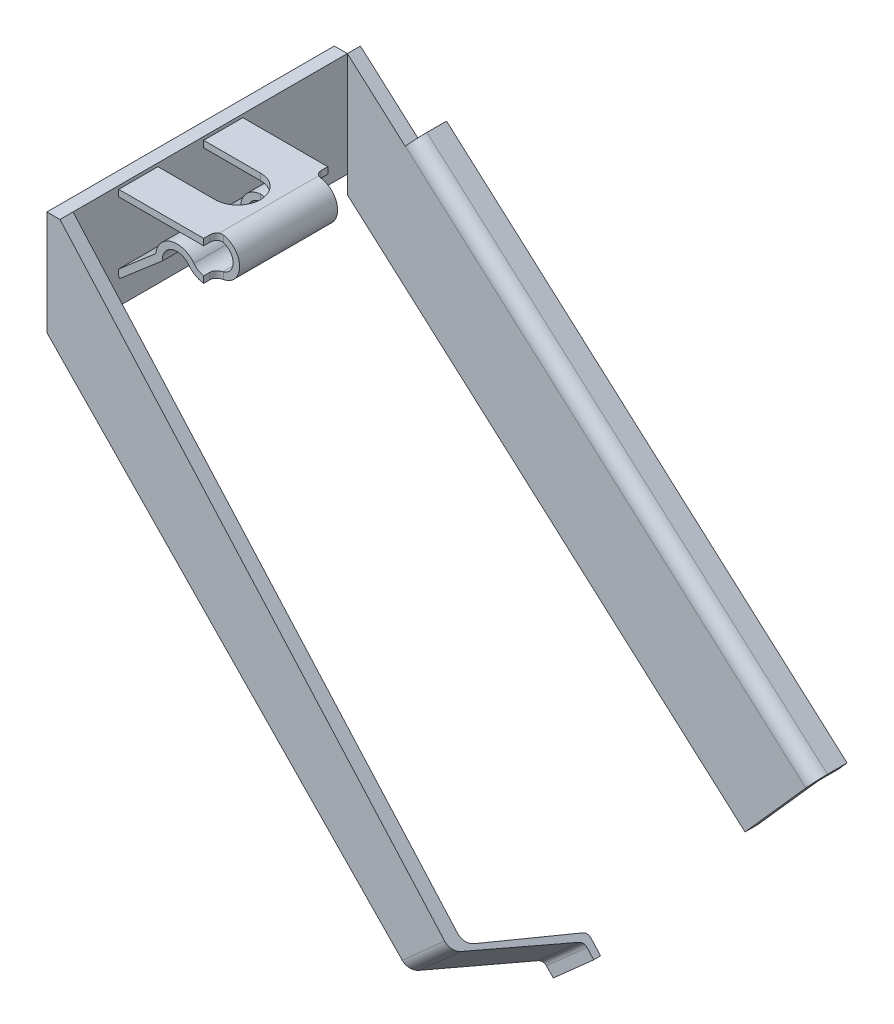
ISO-10303-21;
HEADER;
FILE_DESCRIPTION(('STEP AP214'),'2;1');
FILE_NAME('part.step','',(''),(''),'','','');
FILE_SCHEMA(('AUTOMOTIVE_DESIGN { 1 0 10303 214 1 1 1 1 }'));
ENDSEC;
DATA;
#1=APPLICATION_CONTEXT('core data for automotive mechanical design processes');
#2=APPLICATION_PROTOCOL_DEFINITION('international standard','automotive_design',2000,#1);
#3=PRODUCT_CONTEXT('',#1,'mechanical');
#4=PRODUCT('Part','Part','',(#3));
#5=PRODUCT_RELATED_PRODUCT_CATEGORY('part','',(#4));
#6=PRODUCT_DEFINITION_FORMATION('','',#4);
#7=PRODUCT_DEFINITION_CONTEXT('part definition',#1,'design');
#8=PRODUCT_DEFINITION('design','',#6,#7);
#9=PRODUCT_DEFINITION_SHAPE('','',#8);
#10=(LENGTH_UNIT() NAMED_UNIT(*) SI_UNIT(.MILLI.,.METRE.));
#11=(NAMED_UNIT(*) PLANE_ANGLE_UNIT() SI_UNIT($,.RADIAN.));
#12=(NAMED_UNIT(*) SI_UNIT($,.STERADIAN.) SOLID_ANGLE_UNIT());
#13=UNCERTAINTY_MEASURE_WITH_UNIT(LENGTH_MEASURE(1.E-05),#10,'distance_accuracy_value','');
#14=(GEOMETRIC_REPRESENTATION_CONTEXT(3) GLOBAL_UNCERTAINTY_ASSIGNED_CONTEXT((#13)) GLOBAL_UNIT_ASSIGNED_CONTEXT((#10,
#11,#12)) REPRESENTATION_CONTEXT('',''));
#15=CARTESIAN_POINT('',(0.,0.,0.));
#16=DIRECTION('',(0.,0.,1.));
#17=DIRECTION('',(1.,0.,0.));
#18=AXIS2_PLACEMENT_3D('',#15,#16,#17);
#19=CARTESIAN_POINT('',(1.45776278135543,10.9554344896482,-16.));
#20=DIRECTION('',(0.663851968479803,0.747864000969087,0.));
#21=DIRECTION('',(-0.747864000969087,0.663851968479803,0.));
#22=AXIS2_PLACEMENT_3D('',#19,#20,#21);
#23=PLANE('',#22);
#24=DIRECTION('',(0.,0.,1.));
#25=VECTOR('',#24,1.);
#26=CARTESIAN_POINT('',(1.45776278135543,10.9554344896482,-16.));
#27=LINE('',#26,#25);
#28=CARTESIAN_POINT('',(1.45776278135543,10.9554344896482,-21.));
#29=VERTEX_POINT('',#28);
#30=CARTESIAN_POINT('',(1.45776278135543,10.9554344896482,-18.));
#31=VERTEX_POINT('',#30);
#32=EDGE_CURVE('E101',#29,#31,#27,.T.);
#33=ORIENTED_EDGE('',*,*,#32,.T.);
#34=DIRECTION('',(0.747864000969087,-0.663851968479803,0.));
#35=VECTOR('',#34,1.);
#36=CARTESIAN_POINT('',(1.45776278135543,10.9554344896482,-18.));
#37=LINE('',#36,#35);
#38=CARTESIAN_POINT('',(62.7826108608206,-43.4804269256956,-18.));
#39=VERTEX_POINT('',#38);
#40=EDGE_CURVE('E113',#31,#39,#37,.T.);
#41=ORIENTED_EDGE('',*,*,#40,.T.);
#42=DIRECTION('',(0.,0.,1.));
#43=VECTOR('',#42,1.);
#44=CARTESIAN_POINT('',(62.7826108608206,-43.4804269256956,-16.));
#45=LINE('',#44,#43);
#46=CARTESIAN_POINT('',(62.7826108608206,-43.4804269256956,-21.));
#47=VERTEX_POINT('',#46);
#48=EDGE_CURVE('E92',#47,#39,#45,.T.);
#49=ORIENTED_EDGE('',*,*,#48,.F.);
#50=DIRECTION('',(0.747864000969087,-0.663851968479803,0.));
#51=VECTOR('',#50,1.);
#52=CARTESIAN_POINT('',(1.45776278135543,10.9554344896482,-21.));
#53=LINE('',#52,#51);
#54=EDGE_CURVE('E100',#29,#47,#53,.T.);
#55=ORIENTED_EDGE('',*,*,#54,.F.);
#56=EDGE_LOOP('',(#33,#41,#49,#55));
#57=FACE_BOUND('',#56,.T.);
#58=ADVANCED_FACE('F44',(#57),#23,.T.);
#59=CARTESIAN_POINT('',(1.45776278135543,10.9554344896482,-21.));
#60=DIRECTION('',(0.,0.,-1.));
#61=DIRECTION('',(-1.,0.,0.));
#62=AXIS2_PLACEMENT_3D('',#59,#60,#61);
#63=PLANE('',#62);
#64=DIRECTION('',(0.663851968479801,0.747864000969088,0.));
#65=VECTOR('',#64,1.);
#66=CARTESIAN_POINT('',(62.7826108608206,-43.4804269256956,-21.));
#67=LINE('',#66,#65);
#68=CARTESIAN_POINT('',(61.454906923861,-44.9761549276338,-21.));
#69=VERTEX_POINT('',#68);
#70=EDGE_CURVE('E98',#69,#47,#67,.T.);
#71=ORIENTED_EDGE('',*,*,#70,.F.);
#72=DIRECTION('',(0.747864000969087,-0.663851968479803,0.));
#73=VECTOR('',#72,1.);
#74=CARTESIAN_POINT('',(0.130058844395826,9.45970648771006,-21.));
#75=LINE('',#74,#73);
#76=CARTESIAN_POINT('',(0.130058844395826,9.45970648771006,-21.));
#77=VERTEX_POINT('',#76);
#78=EDGE_CURVE('E87',#77,#69,#75,.T.);
#79=ORIENTED_EDGE('',*,*,#78,.F.);
#80=DIRECTION('',(0.663851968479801,0.747864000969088,0.));
#81=VECTOR('',#80,1.);
#82=CARTESIAN_POINT('',(1.45776278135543,10.9554344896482,-21.));
#83=LINE('',#82,#81);
#84=EDGE_CURVE('E91',#77,#29,#83,.T.);
#85=ORIENTED_EDGE('',*,*,#84,.T.);
#86=ORIENTED_EDGE('',*,*,#54,.T.);
#87=EDGE_LOOP('',(#71,#79,#85,#86));
#88=FACE_BOUND('',#87,.T.);
#89=ADVANCED_FACE('F96',(#88),#63,.T.);
#90=CARTESIAN_POINT('',(0.130058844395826,9.45970648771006,-21.));
#91=DIRECTION('',(-0.663851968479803,-0.747864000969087,0.));
#92=DIRECTION('',(0.747864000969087,-0.663851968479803,0.));
#93=AXIS2_PLACEMENT_3D('',#90,#91,#92);
#94=PLANE('',#93);
#95=DIRECTION('',(0.,0.,-1.));
#96=VECTOR('',#95,1.);
#97=CARTESIAN_POINT('',(61.454906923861,-44.9761549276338,-21.));
#98=LINE('',#97,#96);
#99=CARTESIAN_POINT('',(61.454906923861,-44.9761549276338,-16.));
#100=VERTEX_POINT('',#99);
#101=EDGE_CURVE('E107',#100,#69,#98,.T.);
#102=ORIENTED_EDGE('',*,*,#101,.F.);
#103=DIRECTION('',(0.747864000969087,-0.663851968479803,0.));
#104=VECTOR('',#103,1.);
#105=CARTESIAN_POINT('',(0.130058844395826,9.45970648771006,-16.));
#106=LINE('',#105,#104);
#107=CARTESIAN_POINT('',(0.130058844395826,9.45970648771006,-16.));
#108=VERTEX_POINT('',#107);
#109=EDGE_CURVE('E89',#108,#100,#106,.T.);
#110=ORIENTED_EDGE('',*,*,#109,.F.);
#111=DIRECTION('',(0.,0.,-1.));
#112=VECTOR('',#111,1.);
#113=CARTESIAN_POINT('',(0.130058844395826,9.45970648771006,-18.));
#114=LINE('',#113,#112);
#115=EDGE_CURVE('E83',#108,#77,#114,.T.);
#116=ORIENTED_EDGE('',*,*,#115,.T.);
#117=ORIENTED_EDGE('',*,*,#78,.T.);
#118=EDGE_LOOP('',(#102,#110,#116,#117));
#119=FACE_BOUND('',#118,.T.);
#120=ADVANCED_FACE('F86',(#119),#94,.T.);
#121=CARTESIAN_POINT('',(0.130058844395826,9.45970648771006,-16.));
#122=DIRECTION('',(-0.747864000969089,0.663851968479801,0.));
#123=DIRECTION('',(-0.663851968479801,-0.747864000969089,0.));
#124=AXIS2_PLACEMENT_3D('',#121,#122,#123);
#125=PLANE('',#124);
#126=ORIENTED_EDGE('',*,*,#115,.F.);
#127=CARTESIAN_POINT('',(0.130058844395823,9.45970648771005,-18.));
#128=DIRECTION('',(-0.747864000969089,0.663851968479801,0.));
#129=DIRECTION('',(-0.663851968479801,-0.747864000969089,0.));
#130=AXIS2_PLACEMENT_3D('',#127,#128,#129);
#131=CIRCLE('',#130,2.);
#132=EDGE_CURVE('E12',#108,#31,#131,.T.);
#133=ORIENTED_EDGE('',*,*,#132,.T.);
#134=ORIENTED_EDGE('',*,*,#32,.F.);
#135=ORIENTED_EDGE('',*,*,#84,.F.);
#136=EDGE_LOOP('',(#126,#133,#134,#135));
#137=FACE_BOUND('',#136,.T.);
#138=ADVANCED_FACE('F103',(#137),#125,.T.);
#139=CARTESIAN_POINT('',(61.454906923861,-44.9761549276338,-16.));
#140=DIRECTION('',(-0.747864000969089,0.663851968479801,0.));
#141=DIRECTION('',(-0.663851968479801,-0.747864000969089,0.));
#142=AXIS2_PLACEMENT_3D('',#139,#140,#141);
#143=PLANE('',#142);
#144=ORIENTED_EDGE('',*,*,#48,.T.);
#145=CARTESIAN_POINT('',(61.454906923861,-44.9761549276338,-18.));
#146=DIRECTION('',(-0.747864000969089,0.663851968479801,0.));
#147=DIRECTION('',(-0.663851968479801,-0.747864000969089,0.));
#148=AXIS2_PLACEMENT_3D('',#145,#146,#147);
#149=CIRCLE('',#148,2.);
#150=EDGE_CURVE('E52',#39,#100,#149,.F.);
#151=ORIENTED_EDGE('',*,*,#150,.T.);
#152=ORIENTED_EDGE('',*,*,#101,.T.);
#153=ORIENTED_EDGE('',*,*,#70,.T.);
#154=EDGE_LOOP('',(#144,#151,#152,#153));
#155=FACE_BOUND('',#154,.T.);
#156=ADVANCED_FACE('F116',(#155),#143,.F.);
#157=CARTESIAN_POINT('',(0.13005884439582,9.45970648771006,-18.));
#158=DIRECTION('',(0.747864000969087,-0.663851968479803,0.));
#159=DIRECTION('',(0.663851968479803,0.747864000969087,0.));
#160=AXIS2_PLACEMENT_3D('',#157,#158,#159);
#161=CYLINDRICAL_SURFACE('',#160,2.);
#162=ORIENTED_EDGE('',*,*,#132,.F.);
#163=ORIENTED_EDGE('',*,*,#109,.T.);
#164=ORIENTED_EDGE('',*,*,#150,.F.);
#165=ORIENTED_EDGE('',*,*,#40,.F.);
#166=EDGE_LOOP('',(#162,#163,#164,#165));
#167=FACE_BOUND('',#166,.T.);
#168=ADVANCED_FACE('F46',(#167),#161,.T.);
#169=CLOSED_SHELL('',(#58,#89,#120,#138,#156,#168));
#170=MANIFOLD_SOLID_BREP('B2',#169);
#171=CARTESIAN_POINT('',(52.1609793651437,-55.446250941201,-16.));
#172=DIRECTION('',(-0.747864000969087,0.663851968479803,0.));
#173=DIRECTION('',(-0.663851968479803,-0.747864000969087,0.));
#174=AXIS2_PLACEMENT_3D('',#171,#172,#173);
#175=PLANE('',#174);
#176=DIRECTION('',(0.663851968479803,0.747864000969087,0.));
#177=VECTOR('',#176,1.);
#178=CARTESIAN_POINT('',(52.1609793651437,-55.446250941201,-18.));
#179=LINE('',#178,#177);
#180=CARTESIAN_POINT('',(52.1609793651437,-55.446250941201,-18.));
#181=VERTEX_POINT('',#180);
#182=CARTESIAN_POINT('',(61.4549069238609,-44.9761549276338,-18.));
#183=VERTEX_POINT('',#182);
#184=EDGE_CURVE('E243',#181,#183,#179,.T.);
#185=ORIENTED_EDGE('',*,*,#184,.T.);
#186=DIRECTION('',(0.,0.,-1.));
#187=VECTOR('',#186,1.);
#188=CARTESIAN_POINT('',(61.4549069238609,-44.9761549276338,-16.));
#189=LINE('',#188,#187);
#190=CARTESIAN_POINT('',(61.4549069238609,-44.9761549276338,-16.));
#191=VERTEX_POINT('',#190);
#192=EDGE_CURVE('E42',#191,#183,#189,.T.);
#193=ORIENTED_EDGE('',*,*,#192,.F.);
#194=DIRECTION('',(0.663851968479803,0.747864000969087,0.));
#195=VECTOR('',#194,1.);
#196=CARTESIAN_POINT('',(52.1609793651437,-55.446250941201,-16.));
#197=LINE('',#196,#195);
#198=CARTESIAN_POINT('',(52.1609793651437,-55.446250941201,-16.));
#199=VERTEX_POINT('',#198);
#200=EDGE_CURVE('E231',#199,#191,#197,.T.);
#201=ORIENTED_EDGE('',*,*,#200,.F.);
#202=DIRECTION('',(0.,0.,-1.));
#203=VECTOR('',#202,1.);
#204=CARTESIAN_POINT('',(52.1609793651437,-55.446250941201,-16.));
#205=LINE('',#204,#203);
#206=EDGE_CURVE('E239',#199,#181,#205,.T.);
#207=ORIENTED_EDGE('',*,*,#206,.T.);
#208=EDGE_LOOP('',(#185,#193,#201,#207));
#209=FACE_BOUND('',#208,.T.);
#210=ADVANCED_FACE('F180',(#209),#175,.F.);
#211=CARTESIAN_POINT('',(61.4549069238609,-44.9761549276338,-16.));
#212=DIRECTION('',(-0.663851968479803,-0.747864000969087,0.));
#213=DIRECTION('',(0.747864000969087,-0.663851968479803,0.));
#214=AXIS2_PLACEMENT_3D('',#211,#212,#213);
#215=PLANE('',#214);
#216=DIRECTION('',(-0.747864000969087,0.663851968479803,0.));
#217=VECTOR('',#216,1.);
#218=CARTESIAN_POINT('',(61.4549069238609,-44.9761549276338,-18.));
#219=LINE('',#218,#217);
#220=CARTESIAN_POINT('',(-8.72479192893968,17.3198389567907,-18.));
#221=VERTEX_POINT('',#220);
#222=EDGE_CURVE('E235',#183,#221,#219,.T.);
#223=ORIENTED_EDGE('',*,*,#222,.T.);
#224=DIRECTION('',(0.,0.,-1.));
#225=VECTOR('',#224,1.);
#226=CARTESIAN_POINT('',(-8.72479192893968,17.3198389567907,-16.));
#227=LINE('',#226,#225);
#228=CARTESIAN_POINT('',(-8.72479192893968,17.3198389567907,-16.));
#229=VERTEX_POINT('',#228);
#230=EDGE_CURVE('E188',#229,#221,#227,.T.);
#231=ORIENTED_EDGE('',*,*,#230,.F.);
#232=DIRECTION('',(-0.747864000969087,0.663851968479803,0.));
#233=VECTOR('',#232,1.);
#234=CARTESIAN_POINT('',(61.4549069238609,-44.9761549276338,-16.));
#235=LINE('',#234,#233);
#236=EDGE_CURVE('E226',#191,#229,#235,.T.);
#237=ORIENTED_EDGE('',*,*,#236,.F.);
#238=ORIENTED_EDGE('',*,*,#192,.T.);
#239=EDGE_LOOP('',(#223,#231,#237,#238));
#240=FACE_BOUND('',#239,.T.);
#241=ADVANCED_FACE('F234',(#240),#215,.F.);
#242=CARTESIAN_POINT('',(-8.72479192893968,17.3198389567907,-16.));
#243=DIRECTION('',(1.,0.,0.));
#244=DIRECTION('',(0.,1.,0.));
#245=AXIS2_PLACEMENT_3D('',#242,#243,#244);
#246=PLANE('',#245);
#247=DIRECTION('',(0.,-1.,0.));
#248=VECTOR('',#247,1.);
#249=CARTESIAN_POINT('',(-8.72479192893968,17.3198389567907,-18.));
#250=LINE('',#249,#248);
#251=CARTESIAN_POINT('',(-8.72479192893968,-1.40014219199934,-18.));
#252=VERTEX_POINT('',#251);
#253=EDGE_CURVE('E213',#221,#252,#250,.T.);
#254=ORIENTED_EDGE('',*,*,#253,.T.);
#255=DIRECTION('',(0.,0.,-1.));
#256=VECTOR('',#255,1.);
#257=CARTESIAN_POINT('',(-8.72479192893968,-1.40014219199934,-16.));
#258=LINE('',#257,#256);
#259=CARTESIAN_POINT('',(-8.72479192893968,-1.40014219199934,-16.));
#260=VERTEX_POINT('',#259);
#261=EDGE_CURVE('E236',#260,#252,#258,.T.);
#262=ORIENTED_EDGE('',*,*,#261,.F.);
#263=DIRECTION('',(0.,-1.,0.));
#264=VECTOR('',#263,1.);
#265=CARTESIAN_POINT('',(-8.72479192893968,17.3198389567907,-16.));
#266=LINE('',#265,#264);
#267=EDGE_CURVE('E229',#229,#260,#266,.T.);
#268=ORIENTED_EDGE('',*,*,#267,.F.);
#269=ORIENTED_EDGE('',*,*,#230,.T.);
#270=EDGE_LOOP('',(#254,#262,#268,#269));
#271=FACE_BOUND('',#270,.T.);
#272=ADVANCED_FACE('F237',(#271),#246,.F.);
#273=CARTESIAN_POINT('',(-8.72479192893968,-1.40014219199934,-16.));
#274=DIRECTION('',(0.663851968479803,0.747864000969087,0.));
#275=DIRECTION('',(-0.747864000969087,0.663851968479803,0.));
#276=AXIS2_PLACEMENT_3D('',#273,#274,#275);
#277=PLANE('',#276);
#278=DIRECTION('',(0.747864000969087,-0.663851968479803,0.));
#279=VECTOR('',#278,1.);
#280=CARTESIAN_POINT('',(-8.72479192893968,-1.40014219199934,-18.));
#281=LINE('',#280,#279);
#282=EDGE_CURVE('E219',#252,#181,#281,.T.);
#283=ORIENTED_EDGE('',*,*,#282,.T.);
#284=ORIENTED_EDGE('',*,*,#206,.F.);
#285=DIRECTION('',(0.747864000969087,-0.663851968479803,0.));
#286=VECTOR('',#285,1.);
#287=CARTESIAN_POINT('',(-8.72479192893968,-1.40014219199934,-16.));
#288=LINE('',#287,#286);
#289=EDGE_CURVE('E196',#260,#199,#288,.T.);
#290=ORIENTED_EDGE('',*,*,#289,.F.);
#291=ORIENTED_EDGE('',*,*,#261,.T.);
#292=EDGE_LOOP('',(#283,#284,#290,#291));
#293=FACE_BOUND('',#292,.T.);
#294=ADVANCED_FACE('F250',(#293),#277,.F.);
#295=CARTESIAN_POINT('',(52.1609793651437,-55.446250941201,-16.));
#296=DIRECTION('',(0.,0.,-1.));
#297=DIRECTION('',(-1.,0.,0.));
#298=AXIS2_PLACEMENT_3D('',#295,#296,#297);
#299=PLANE('',#298);
#300=ORIENTED_EDGE('',*,*,#200,.T.);
#301=ORIENTED_EDGE('',*,*,#236,.T.);
#302=ORIENTED_EDGE('',*,*,#267,.T.);
#303=ORIENTED_EDGE('',*,*,#289,.T.);
#304=EDGE_LOOP('',(#300,#301,#302,#303));
#305=FACE_BOUND('',#304,.T.);
#306=ADVANCED_FACE('F227',(#305),#299,.F.);
#307=CARTESIAN_POINT('',(52.1609793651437,-55.446250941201,-18.));
#308=DIRECTION('',(0.,0.,-1.));
#309=DIRECTION('',(-1.,0.,0.));
#310=AXIS2_PLACEMENT_3D('',#307,#308,#309);
#311=PLANE('',#310);
#312=ORIENTED_EDGE('',*,*,#184,.F.);
#313=ORIENTED_EDGE('',*,*,#282,.F.);
#314=ORIENTED_EDGE('',*,*,#253,.F.);
#315=ORIENTED_EDGE('',*,*,#222,.F.);
#316=EDGE_LOOP('',(#312,#313,#314,#315));
#317=FACE_BOUND('',#316,.T.);
#318=ADVANCED_FACE('F253',(#317),#311,.T.);
#319=CLOSED_SHELL('',(#210,#241,#272,#294,#306,#318));
#320=MANIFOLD_SOLID_BREP('B6',#319);
#321=CARTESIAN_POINT('',(0.187248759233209,10.7865850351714,0.));
#322=DIRECTION('',(0.,0.,1.));
#323=DIRECTION('',(1.,0.,0.));
#324=AXIS2_PLACEMENT_3D('',#321,#322,#323);
#325=PLANE('',#324);
#326=DIRECTION('',(0.,-1.,0.));
#327=VECTOR('',#326,1.);
#328=CARTESIAN_POINT('',(-8.72479192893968,10.7865850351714,0.));
#329=LINE('',#328,#327);
#330=CARTESIAN_POINT('',(-8.72479192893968,16.8198389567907,0.));
#331=VERTEX_POINT('',#330);
#332=CARTESIAN_POINT('',(-8.72479192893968,15.8198389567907,0.));
#333=VERTEX_POINT('',#332);
#334=EDGE_CURVE('E738',#331,#333,#329,.T.);
#335=ORIENTED_EDGE('',*,*,#334,.F.);
#336=DIRECTION('',(1.,0.,0.));
#337=VECTOR('',#336,1.);
#338=CARTESIAN_POINT('',(-9.22479192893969,16.8198389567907,0.));
#339=LINE('',#338,#337);
#340=CARTESIAN_POINT('',(4.27520807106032,16.8198389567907,0.));
#341=VERTEX_POINT('',#340);
#342=EDGE_CURVE('E947',#331,#341,#339,.T.);
#343=ORIENTED_EDGE('',*,*,#342,.T.);
#344=DIRECTION('',(0.,-1.,0.));
#345=VECTOR('',#344,1.);
#346=CARTESIAN_POINT('',(4.27520807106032,10.7865850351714,0.));
#347=LINE('',#346,#345);
#348=CARTESIAN_POINT('',(4.27520807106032,15.8198389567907,0.));
#349=VERTEX_POINT('',#348);
#350=EDGE_CURVE('E1256',#341,#349,#347,.T.);
#351=ORIENTED_EDGE('',*,*,#350,.T.);
#352=DIRECTION('',(1.,0.,0.));
#353=VECTOR('',#352,1.);
#354=CARTESIAN_POINT('',(-9.22479192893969,15.8198389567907,0.));
#355=LINE('',#354,#353);
#356=EDGE_CURVE('E950',#333,#349,#355,.T.);
#357=ORIENTED_EDGE('',*,*,#356,.F.);
#358=EDGE_LOOP('',(#335,#343,#351,#357));
#359=FACE_BOUND('',#358,.T.);
#360=ADVANCED_FACE('F304',(#359),#325,.F.);
#361=CARTESIAN_POINT('',(0.187248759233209,10.7865850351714,19.));
#362=DIRECTION('',(0.,0.,1.));
#363=DIRECTION('',(1.,0.,0.));
#364=AXIS2_PLACEMENT_3D('',#361,#362,#363);
#365=PLANE('',#364);
#366=DIRECTION('',(1.,0.,0.));
#367=VECTOR('',#366,1.);
#368=CARTESIAN_POINT('',(-9.22479192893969,16.8198389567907,19.));
#369=LINE('',#368,#367);
#370=CARTESIAN_POINT('',(-8.72479192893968,16.8198389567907,19.));
#371=VERTEX_POINT('',#370);
#372=CARTESIAN_POINT('',(4.27520807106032,16.8198389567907,19.));
#373=VERTEX_POINT('',#372);
#374=EDGE_CURVE('E1168',#371,#373,#369,.T.);
#375=ORIENTED_EDGE('',*,*,#374,.F.);
#376=DIRECTION('',(0.,-1.,0.));
#377=VECTOR('',#376,1.);
#378=CARTESIAN_POINT('',(-8.72479192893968,10.7865850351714,19.));
#379=LINE('',#378,#377);
#380=CARTESIAN_POINT('',(-8.72479192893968,15.8198389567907,19.));
#381=VERTEX_POINT('',#380);
#382=EDGE_CURVE('E745',#371,#381,#379,.T.);
#383=ORIENTED_EDGE('',*,*,#382,.T.);
#384=DIRECTION('',(1.,0.,0.));
#385=VECTOR('',#384,1.);
#386=CARTESIAN_POINT('',(-9.22479192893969,15.8198389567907,19.));
#387=LINE('',#386,#385);
#388=CARTESIAN_POINT('',(4.27520807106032,15.8198389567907,19.));
#389=VERTEX_POINT('',#388);
#390=EDGE_CURVE('E1171',#381,#389,#387,.T.);
#391=ORIENTED_EDGE('',*,*,#390,.T.);
#392=DIRECTION('',(0.,-1.,0.));
#393=VECTOR('',#392,1.);
#394=CARTESIAN_POINT('',(4.27520807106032,10.7865850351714,19.));
#395=LINE('',#394,#393);
#396=EDGE_CURVE('E1226',#373,#389,#395,.T.);
#397=ORIENTED_EDGE('',*,*,#396,.F.);
#398=EDGE_LOOP('',(#375,#383,#391,#397));
#399=FACE_BOUND('',#398,.T.);
#400=ADVANCED_FACE('F1017',(#399),#365,.T.);
#401=CARTESIAN_POINT('',(-3.05008056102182,11.1228087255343,19.));
#402=DIRECTION('',(0.651524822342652,-0.758627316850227,0.));
#403=DIRECTION('',(0.758627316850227,0.651524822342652,0.));
#404=AXIS2_PLACEMENT_3D('',#401,#402,#403);
#405=PLANE('',#404);
#406=DIRECTION('',(0.,0.,-1.));
#407=VECTOR('',#406,1.);
#408=CARTESIAN_POINT('',(-8.72479192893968,6.24924929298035,19.));
#409=LINE('',#408,#407);
#410=CARTESIAN_POINT('',(-8.72479192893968,6.24924929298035,19.));
#411=VERTEX_POINT('',#410);
#412=CARTESIAN_POINT('',(-8.72479192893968,6.24924929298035,13.));
#413=VERTEX_POINT('',#412);
#414=EDGE_CURVE('E764',#411,#413,#409,.T.);
#415=ORIENTED_EDGE('',*,*,#414,.F.);
#416=DIRECTION('',(-0.758627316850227,-0.651524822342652,0.));
#417=VECTOR('',#416,1.);
#418=CARTESIAN_POINT('',(-3.05008056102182,11.1228087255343,19.));
#419=LINE('',#418,#417);
#420=CARTESIAN_POINT('',(-3.05008056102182,11.1228087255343,19.));
#421=VERTEX_POINT('',#420);
#422=EDGE_CURVE('E962',#421,#411,#419,.T.);
#423=ORIENTED_EDGE('',*,*,#422,.F.);
#424=DIRECTION('',(0.,0.,-1.));
#425=VECTOR('',#424,1.);
#426=CARTESIAN_POINT('',(-3.05008056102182,11.1228087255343,19.));
#427=LINE('',#426,#425);
#428=CARTESIAN_POINT('',(-3.05008056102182,11.1228087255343,13.));
#429=VERTEX_POINT('',#428);
#430=EDGE_CURVE('E963',#421,#429,#427,.T.);
#431=ORIENTED_EDGE('',*,*,#430,.T.);
#432=DIRECTION('',(-0.758627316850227,-0.651524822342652,0.));
#433=VECTOR('',#432,1.);
#434=CARTESIAN_POINT('',(-3.05008056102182,11.1228087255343,13.));
#435=LINE('',#434,#433);
#436=EDGE_CURVE('E1135',#429,#413,#435,.T.);
#437=ORIENTED_EDGE('',*,*,#436,.T.);
#438=EDGE_LOOP('',(#415,#423,#431,#437));
#439=FACE_BOUND('',#438,.T.);
#440=ADVANCED_FACE('F1066',(#439),#405,.F.);
#441=CARTESIAN_POINT('',(-8.57326710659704,5.06121163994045,19.));
#442=DIRECTION('',(-0.75862731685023,-0.65152482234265,0.));
#443=DIRECTION('',(0.65152482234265,-0.75862731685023,0.));
#444=AXIS2_PLACEMENT_3D('',#441,#442,#443);
#445=PLANE('',#444);
#446=DIRECTION('',(-0.65152482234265,0.758627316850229,0.));
#447=VECTOR('',#446,1.);
#448=CARTESIAN_POINT('',(-8.57326710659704,5.06121163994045,19.));
#449=LINE('',#448,#447);
#450=CARTESIAN_POINT('',(-8.57326710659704,5.06121163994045,19.));
#451=VERTEX_POINT('',#450);
#452=CARTESIAN_POINT('',(-8.72479192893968,5.23764523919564,19.));
#453=VERTEX_POINT('',#452);
#454=EDGE_CURVE('E1239',#451,#453,#449,.T.);
#455=ORIENTED_EDGE('',*,*,#454,.T.);
#456=DIRECTION('',(0.,0.,-1.));
#457=VECTOR('',#456,1.);
#458=CARTESIAN_POINT('',(-8.72479192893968,5.23764523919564,19.));
#459=LINE('',#458,#457);
#460=CARTESIAN_POINT('',(-8.72479192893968,5.23764523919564,13.));
#461=VERTEX_POINT('',#460);
#462=EDGE_CURVE('E761',#453,#461,#459,.T.);
#463=ORIENTED_EDGE('',*,*,#462,.T.);
#464=DIRECTION('',(-0.65152482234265,0.75862731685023,0.));
#465=VECTOR('',#464,1.);
#466=CARTESIAN_POINT('',(-8.57326710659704,5.06121163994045,13.));
#467=LINE('',#466,#465);
#468=CARTESIAN_POINT('',(-8.57326710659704,5.06121163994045,13.));
#469=VERTEX_POINT('',#468);
#470=EDGE_CURVE('E1138',#469,#461,#467,.T.);
#471=ORIENTED_EDGE('',*,*,#470,.F.);
#472=DIRECTION('',(0.,0.,-1.));
#473=VECTOR('',#472,1.);
#474=CARTESIAN_POINT('',(-8.57326710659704,5.06121163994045,19.));
#475=LINE('',#474,#473);
#476=EDGE_CURVE('E990',#451,#469,#475,.T.);
#477=ORIENTED_EDGE('',*,*,#476,.F.);
#478=EDGE_LOOP('',(#455,#463,#471,#477));
#479=FACE_BOUND('',#478,.T.);
#480=ADVANCED_FACE('F1062',(#479),#445,.T.);
#481=DIRECTION('',(0.,0.,-1.));
#482=VECTOR('',#481,1.);
#483=CARTESIAN_POINT('',(-8.72479192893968,6.24924929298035,19.));
#484=LINE('',#483,#482);
#485=CARTESIAN_POINT('',(-8.72479192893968,6.24924929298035,6.));
#486=VERTEX_POINT('',#485);
#487=CARTESIAN_POINT('',(-8.72479192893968,6.24924929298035,0.));
#488=VERTEX_POINT('',#487);
#489=EDGE_CURVE('E752',#486,#488,#484,.T.);
#490=ORIENTED_EDGE('',*,*,#489,.F.);
#491=DIRECTION('',(0.758627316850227,0.651524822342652,0.));
#492=VECTOR('',#491,1.);
#493=CARTESIAN_POINT('',(-3.05008056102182,11.1228087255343,6.));
#494=LINE('',#493,#492);
#495=CARTESIAN_POINT('',(-3.05008056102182,11.1228087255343,6.));
#496=VERTEX_POINT('',#495);
#497=EDGE_CURVE('E1120',#486,#496,#494,.T.);
#498=ORIENTED_EDGE('',*,*,#497,.T.);
#499=CARTESIAN_POINT('',(-3.05008056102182,11.1228087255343,0.));
#500=VERTEX_POINT('',#499);
#501=EDGE_CURVE('E967',#496,#500,#427,.T.);
#502=ORIENTED_EDGE('',*,*,#501,.T.);
#503=DIRECTION('',(-0.758627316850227,-0.651524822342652,0.));
#504=VECTOR('',#503,1.);
#505=CARTESIAN_POINT('',(-3.05008056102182,11.1228087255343,0.));
#506=LINE('',#505,#504);
#507=EDGE_CURVE('E1104',#500,#488,#506,.T.);
#508=ORIENTED_EDGE('',*,*,#507,.T.);
#509=EDGE_LOOP('',(#490,#498,#502,#508));
#510=FACE_BOUND('',#509,.T.);
#511=ADVANCED_FACE('F1065',(#510),#405,.F.);
#512=DIRECTION('',(0.65152482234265,-0.75862731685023,0.));
#513=VECTOR('',#512,1.);
#514=CARTESIAN_POINT('',(-8.57326710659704,5.06121163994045,6.));
#515=LINE('',#514,#513);
#516=CARTESIAN_POINT('',(-8.72479192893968,5.23764523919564,6.));
#517=VERTEX_POINT('',#516);
#518=CARTESIAN_POINT('',(-8.57326710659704,5.06121163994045,6.));
#519=VERTEX_POINT('',#518);
#520=EDGE_CURVE('E1117',#517,#519,#515,.T.);
#521=ORIENTED_EDGE('',*,*,#520,.F.);
#522=DIRECTION('',(0.,0.,-1.));
#523=VECTOR('',#522,1.);
#524=CARTESIAN_POINT('',(-8.72479192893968,5.23764523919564,19.));
#525=LINE('',#524,#523);
#526=CARTESIAN_POINT('',(-8.72479192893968,5.23764523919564,0.));
#527=VERTEX_POINT('',#526);
#528=EDGE_CURVE('E750',#517,#527,#525,.T.);
#529=ORIENTED_EDGE('',*,*,#528,.T.);
#530=DIRECTION('',(-0.65152482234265,0.758627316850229,0.));
#531=VECTOR('',#530,1.);
#532=CARTESIAN_POINT('',(-8.57326710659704,5.06121163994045,0.));
#533=LINE('',#532,#531);
#534=CARTESIAN_POINT('',(-8.57326710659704,5.06121163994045,0.));
#535=VERTEX_POINT('',#534);
#536=EDGE_CURVE('E1107',#535,#527,#533,.T.);
#537=ORIENTED_EDGE('',*,*,#536,.F.);
#538=EDGE_CURVE('E989',#519,#535,#475,.T.);
#539=ORIENTED_EDGE('',*,*,#538,.F.);
#540=EDGE_LOOP('',(#521,#529,#537,#539));
#541=FACE_BOUND('',#540,.T.);
#542=ADVANCED_FACE('F1068',(#541),#445,.T.);
#543=CARTESIAN_POINT('',(-9.22479192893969,16.8198389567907,19.));
#544=DIRECTION('',(0.,1.,0.));
#545=DIRECTION('',(0.,0.,1.));
#546=AXIS2_PLACEMENT_3D('',#543,#544,#545);
#547=PLANE('',#546);
#548=ORIENTED_EDGE('',*,*,#342,.F.);
#549=DIRECTION('',(0.,0.,1.));
#550=VECTOR('',#549,1.);
#551=CARTESIAN_POINT('',(-8.72479192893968,16.8198389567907,19.));
#552=LINE('',#551,#550);
#553=CARTESIAN_POINT('',(-8.72479192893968,16.8198389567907,6.));
#554=VERTEX_POINT('',#553);
#555=EDGE_CURVE('E734',#331,#554,#552,.T.);
#556=ORIENTED_EDGE('',*,*,#555,.T.);
#557=DIRECTION('',(-1.,0.,0.));
#558=VECTOR('',#557,1.);
#559=CARTESIAN_POINT('',(-0.000717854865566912,16.8198389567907,6.));
#560=LINE('',#559,#558);
#561=CARTESIAN_POINT('',(-0.000717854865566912,16.8198389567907,6.));
#562=VERTEX_POINT('',#561);
#563=EDGE_CURVE('E1194',#562,#554,#560,.T.);
#564=ORIENTED_EDGE('',*,*,#563,.F.);
#565=CARTESIAN_POINT('',(-0.000717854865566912,16.8198389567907,9.5));
#566=DIRECTION('',(0.,1.,0.));
#567=DIRECTION('',(0.,0.,1.));
#568=AXIS2_PLACEMENT_3D('',#565,#566,#567);
#569=CIRCLE('',#568,3.5);
#570=CARTESIAN_POINT('',(-0.000717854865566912,16.8198389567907,13.));
#571=VERTEX_POINT('',#570);
#572=EDGE_CURVE('E1196',#571,#562,#569,.T.);
#573=ORIENTED_EDGE('',*,*,#572,.F.);
#574=DIRECTION('',(1.,0.,0.));
#575=VECTOR('',#574,1.);
#576=CARTESIAN_POINT('',(-0.000717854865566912,16.8198389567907,13.));
#577=LINE('',#576,#575);
#578=CARTESIAN_POINT('',(-8.72479192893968,16.8198389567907,13.));
#579=VERTEX_POINT('',#578);
#580=EDGE_CURVE('E1191',#579,#571,#577,.T.);
#581=ORIENTED_EDGE('',*,*,#580,.F.);
#582=EDGE_CURVE('E739',#579,#371,#552,.T.);
#583=ORIENTED_EDGE('',*,*,#582,.T.);
#584=ORIENTED_EDGE('',*,*,#374,.T.);
#585=DIRECTION('',(0.,0.,1.));
#586=VECTOR('',#585,1.);
#587=CARTESIAN_POINT('',(4.27520807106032,16.8198389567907,19.5321147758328));
#588=LINE('',#587,#586);
#589=CARTESIAN_POINT('',(4.27520807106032,16.8198389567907,18.));
#590=VERTEX_POINT('',#589);
#591=EDGE_CURVE('E914',#590,#373,#588,.T.);
#592=ORIENTED_EDGE('',*,*,#591,.F.);
#593=CARTESIAN_POINT('',(5.27520807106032,16.8198389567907,18.));
#594=DIRECTION('',(0.,1.,0.));
#595=DIRECTION('',(0.,0.,-1.));
#596=AXIS2_PLACEMENT_3D('',#593,#594,#595);
#597=CIRCLE('',#596,1.);
#598=CARTESIAN_POINT('',(4.77520807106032,16.8198389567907,17.1339745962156));
#599=VERTEX_POINT('',#598);
#600=EDGE_CURVE('E919',#599,#590,#597,.T.);
#601=ORIENTED_EDGE('',*,*,#600,.F.);
#602=DIRECTION('',(0.,0.,-1.));
#603=VECTOR('',#602,1.);
#604=CARTESIAN_POINT('',(4.77520807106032,16.8198389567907,19.));
#605=LINE('',#604,#603);
#606=CARTESIAN_POINT('',(4.77520807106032,16.8198389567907,1.86602540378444));
#607=VERTEX_POINT('',#606);
#608=EDGE_CURVE('E976',#599,#607,#605,.T.);
#609=ORIENTED_EDGE('',*,*,#608,.T.);
#610=CARTESIAN_POINT('',(5.27520807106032,16.8198389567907,1.));
#611=DIRECTION('',(0.,1.,0.));
#612=DIRECTION('',(0.,0.,1.));
#613=AXIS2_PLACEMENT_3D('',#610,#611,#612);
#614=CIRCLE('',#613,1.);
#615=CARTESIAN_POINT('',(4.27520807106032,16.8198389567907,1.));
#616=VERTEX_POINT('',#615);
#617=EDGE_CURVE('E772',#616,#607,#614,.T.);
#618=ORIENTED_EDGE('',*,*,#617,.F.);
#619=DIRECTION('',(0.,0.,1.));
#620=VECTOR('',#619,1.);
#621=CARTESIAN_POINT('',(4.27520807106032,16.8198389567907,1.));
#622=LINE('',#621,#620);
#623=EDGE_CURVE('E769',#341,#616,#622,.T.);
#624=ORIENTED_EDGE('',*,*,#623,.F.);
#625=EDGE_LOOP('',(#548,#556,#564,#573,#581,#583,#584,#592,#601,#609,#618,#624));
#626=FACE_BOUND('',#625,.T.);
#627=ADVANCED_FACE('F843',(#626),#547,.T.);
#628=CARTESIAN_POINT('',(-9.22479192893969,15.8198389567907,19.));
#629=DIRECTION('',(0.,1.,0.));
#630=DIRECTION('',(0.,0.,1.));
#631=AXIS2_PLACEMENT_3D('',#628,#629,#630);
#632=PLANE('',#631);
#633=DIRECTION('',(0.,0.,1.));
#634=VECTOR('',#633,1.);
#635=CARTESIAN_POINT('',(-8.72479192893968,15.8198389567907,19.));
#636=LINE('',#635,#634);
#637=CARTESIAN_POINT('',(-8.72479192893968,15.8198389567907,6.));
#638=VERTEX_POINT('',#637);
#639=EDGE_CURVE('E731',#333,#638,#636,.T.);
#640=ORIENTED_EDGE('',*,*,#639,.F.);
#641=ORIENTED_EDGE('',*,*,#356,.T.);
#642=DIRECTION('',(0.,0.,1.));
#643=VECTOR('',#642,1.);
#644=CARTESIAN_POINT('',(4.27520807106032,15.8198389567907,19.));
#645=LINE('',#644,#643);
#646=CARTESIAN_POINT('',(4.27520807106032,15.8198389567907,1.));
#647=VERTEX_POINT('',#646);
#648=EDGE_CURVE('E786',#349,#647,#645,.T.);
#649=ORIENTED_EDGE('',*,*,#648,.T.);
#650=CARTESIAN_POINT('',(5.27520807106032,15.8198389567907,1.));
#651=DIRECTION('',(0.,1.,0.));
#652=DIRECTION('',(0.,0.,1.));
#653=AXIS2_PLACEMENT_3D('',#650,#651,#652);
#654=CIRCLE('',#653,1.);
#655=CARTESIAN_POINT('',(4.77520807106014,15.8198389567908,1.86602540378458));
#656=VERTEX_POINT('',#655);
#657=EDGE_CURVE('E832',#647,#656,#654,.T.);
#658=ORIENTED_EDGE('',*,*,#657,.T.);
#659=DIRECTION('',(0.,0.,-1.));
#660=VECTOR('',#659,1.);
#661=CARTESIAN_POINT('',(4.77520807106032,15.8198389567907,19.));
#662=LINE('',#661,#660);
#663=CARTESIAN_POINT('',(4.77520807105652,15.8198389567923,17.1339745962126));
#664=VERTEX_POINT('',#663);
#665=EDGE_CURVE('E974',#664,#656,#662,.T.);
#666=ORIENTED_EDGE('',*,*,#665,.F.);
#667=CARTESIAN_POINT('',(5.27520807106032,15.8198389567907,18.));
#668=DIRECTION('',(0.,1.,0.));
#669=DIRECTION('',(0.,0.,1.));
#670=AXIS2_PLACEMENT_3D('',#667,#668,#669);
#671=CIRCLE('',#670,1.);
#672=CARTESIAN_POINT('',(4.27520807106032,15.8198389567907,18.));
#673=VERTEX_POINT('',#672);
#674=EDGE_CURVE('E856',#664,#673,#671,.T.);
#675=ORIENTED_EDGE('',*,*,#674,.T.);
#676=DIRECTION('',(0.,0.,1.));
#677=VECTOR('',#676,1.);
#678=CARTESIAN_POINT('',(4.27520807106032,15.8198389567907,19.));
#679=LINE('',#678,#677);
#680=EDGE_CURVE('E898',#673,#389,#679,.T.);
#681=ORIENTED_EDGE('',*,*,#680,.T.);
#682=ORIENTED_EDGE('',*,*,#390,.F.);
#683=CARTESIAN_POINT('',(-8.72479192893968,15.8198389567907,13.));
#684=VERTEX_POINT('',#683);
#685=EDGE_CURVE('E735',#684,#381,#636,.T.);
#686=ORIENTED_EDGE('',*,*,#685,.F.);
#687=DIRECTION('',(1.,0.,0.));
#688=VECTOR('',#687,1.);
#689=CARTESIAN_POINT('',(-9.22479192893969,15.8198389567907,13.));
#690=LINE('',#689,#688);
#691=CARTESIAN_POINT('',(-0.000717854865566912,15.8198389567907,13.));
#692=VERTEX_POINT('',#691);
#693=EDGE_CURVE('E1143',#684,#692,#690,.T.);
#694=ORIENTED_EDGE('',*,*,#693,.T.);
#695=CARTESIAN_POINT('',(-0.000717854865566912,15.8198389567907,9.5));
#696=DIRECTION('',(0.,1.,0.));
#697=DIRECTION('',(0.,0.,1.));
#698=AXIS2_PLACEMENT_3D('',#695,#696,#697);
#699=CIRCLE('',#698,3.5);
#700=CARTESIAN_POINT('',(-0.000717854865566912,15.8198389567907,6.));
#701=VERTEX_POINT('',#700);
#702=EDGE_CURVE('E1148',#692,#701,#699,.T.);
#703=ORIENTED_EDGE('',*,*,#702,.T.);
#704=DIRECTION('',(-1.,0.,0.));
#705=VECTOR('',#704,1.);
#706=CARTESIAN_POINT('',(-9.22479192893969,15.8198389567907,6.));
#707=LINE('',#706,#705);
#708=EDGE_CURVE('E1132',#701,#638,#707,.T.);
#709=ORIENTED_EDGE('',*,*,#708,.T.);
#710=EDGE_LOOP('',(#640,#641,#649,#658,#666,#675,#681,#682,#686,#694,#703,#709));
#711=FACE_BOUND('',#710,.T.);
#712=ADVANCED_FACE('F1098',(#711),#632,.F.);
#713=ORIENTED_EDGE('',*,*,#422,.T.);
#714=DIRECTION('',(0.,-1.,0.));
#715=VECTOR('',#714,1.);
#716=CARTESIAN_POINT('',(-8.72479192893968,10.7865850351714,19.));
#717=LINE('',#716,#715);
#718=EDGE_CURVE('E767',#411,#453,#717,.T.);
#719=ORIENTED_EDGE('',*,*,#718,.T.);
#720=ORIENTED_EDGE('',*,*,#454,.F.);
#721=DIRECTION('',(-0.758627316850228,-0.651524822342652,0.));
#722=VECTOR('',#721,1.);
#723=CARTESIAN_POINT('',(-2.39855573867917,10.3641814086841,19.));
#724=LINE('',#723,#722);
#725=CARTESIAN_POINT('',(-2.06347085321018,10.6519592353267,19.));
#726=VERTEX_POINT('',#725);
#727=EDGE_CURVE('E1173',#726,#451,#724,.T.);
#728=ORIENTED_EDGE('',*,*,#727,.F.);
#729=CARTESIAN_POINT('',(0.187248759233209,10.7865850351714,19.));
#730=DIRECTION('',(0.,0.,1.));
#731=DIRECTION('',(1.,0.,0.));
#732=AXIS2_PLACEMENT_3D('',#729,#730,#731);
#733=CIRCLE('',#732,2.25474230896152);
#734=CARTESIAN_POINT('',(1.98133760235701,12.1522746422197,19.));
#735=VERTEX_POINT('',#734);
#736=EDGE_CURVE('E1169',#735,#726,#733,.T.);
#737=ORIENTED_EDGE('',*,*,#736,.F.);
#738=CARTESIAN_POINT('',(4.68899594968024,14.2133882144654,19.));
#739=DIRECTION('',(0.,0.,1.));
#740=DIRECTION('',(1.,0.,0.));
#741=AXIS2_PLACEMENT_3D('',#738,#739,#740);
#742=CIRCLE('',#741,3.40288155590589);
#743=CARTESIAN_POINT('',(4.27520807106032,10.8357585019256,19.));
#744=VERTEX_POINT('',#743);
#745=EDGE_CURVE('E1165',#744,#735,#742,.F.);
#746=ORIENTED_EDGE('',*,*,#745,.F.);
#747=CARTESIAN_POINT('',(4.27520807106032,11.846402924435,19.));
#748=VERTEX_POINT('',#747);
#749=EDGE_CURVE('E1228',#748,#744,#395,.T.);
#750=ORIENTED_EDGE('',*,*,#749,.F.);
#751=CARTESIAN_POINT('',(4.68899594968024,14.2133882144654,19.));
#752=DIRECTION('',(0.,0.,-1.));
#753=DIRECTION('',(-1.,0.,0.));
#754=AXIS2_PLACEMENT_3D('',#751,#752,#753);
#755=CIRCLE('',#754,2.40288155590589);
#756=CARTESIAN_POINT('',(2.7770333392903,12.7579711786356,19.));
#757=VERTEX_POINT('',#756);
#758=EDGE_CURVE('E1178',#748,#757,#755,.T.);
#759=ORIENTED_EDGE('',*,*,#758,.T.);
#760=CARTESIAN_POINT('',(0.187248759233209,10.7865850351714,19.));
#761=DIRECTION('',(0.,0.,1.));
#762=DIRECTION('',(1.,0.,0.));
#763=AXIS2_PLACEMENT_3D('',#760,#761,#762);
#764=CIRCLE('',#763,3.25474230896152);
#765=EDGE_CURVE('E1180',#757,#421,#764,.T.);
#766=ORIENTED_EDGE('',*,*,#765,.T.);
#767=EDGE_LOOP('',(#713,#719,#720,#728,#737,#746,#750,#759,#766));
#768=FACE_BOUND('',#767,.T.);
#769=ADVANCED_FACE('F1089',(#768),#365,.T.);
#770=DIRECTION('',(0.,-1.,0.));
#771=VECTOR('',#770,1.);
#772=CARTESIAN_POINT('',(-8.72479192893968,10.7865850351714,0.));
#773=LINE('',#772,#771);
#774=EDGE_CURVE('E755',#488,#527,#773,.T.);
#775=ORIENTED_EDGE('',*,*,#774,.F.);
#776=ORIENTED_EDGE('',*,*,#507,.F.);
#777=CARTESIAN_POINT('',(0.187248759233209,10.7865850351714,0.));
#778=DIRECTION('',(0.,0.,1.));
#779=DIRECTION('',(1.,0.,0.));
#780=AXIS2_PLACEMENT_3D('',#777,#778,#779);
#781=CIRCLE('',#780,3.25474230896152);
#782=CARTESIAN_POINT('',(2.7770333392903,12.7579711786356,0.));
#783=VERTEX_POINT('',#782);
#784=EDGE_CURVE('E959',#783,#500,#781,.T.);
#785=ORIENTED_EDGE('',*,*,#784,.F.);
#786=CARTESIAN_POINT('',(4.68899594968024,14.2133882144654,0.));
#787=DIRECTION('',(0.,0.,-1.));
#788=DIRECTION('',(-1.,0.,0.));
#789=AXIS2_PLACEMENT_3D('',#786,#787,#788);
#790=CIRCLE('',#789,2.40288155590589);
#791=CARTESIAN_POINT('',(4.27520807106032,11.846402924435,0.));
#792=VERTEX_POINT('',#791);
#793=EDGE_CURVE('E957',#792,#783,#790,.T.);
#794=ORIENTED_EDGE('',*,*,#793,.F.);
#795=CARTESIAN_POINT('',(4.27520807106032,10.8357585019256,0.));
#796=VERTEX_POINT('',#795);
#797=EDGE_CURVE('E1255',#792,#796,#347,.T.);
#798=ORIENTED_EDGE('',*,*,#797,.T.);
#799=CARTESIAN_POINT('',(4.68899594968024,14.2133882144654,0.));
#800=DIRECTION('',(0.,0.,1.));
#801=DIRECTION('',(1.,0.,0.));
#802=AXIS2_PLACEMENT_3D('',#799,#800,#801);
#803=CIRCLE('',#802,3.40288155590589);
#804=CARTESIAN_POINT('',(1.98133760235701,12.1522746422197,0.));
#805=VERTEX_POINT('',#804);
#806=EDGE_CURVE('E940',#796,#805,#803,.F.);
#807=ORIENTED_EDGE('',*,*,#806,.T.);
#808=CARTESIAN_POINT('',(0.187248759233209,10.7865850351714,0.));
#809=DIRECTION('',(0.,0.,1.));
#810=DIRECTION('',(1.,0.,0.));
#811=AXIS2_PLACEMENT_3D('',#808,#809,#810);
#812=CIRCLE('',#811,2.25474230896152);
#813=CARTESIAN_POINT('',(-2.06347085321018,10.6519592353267,0.));
#814=VERTEX_POINT('',#813);
#815=EDGE_CURVE('E948',#805,#814,#812,.T.);
#816=ORIENTED_EDGE('',*,*,#815,.T.);
#817=DIRECTION('',(-0.758627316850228,-0.651524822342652,0.));
#818=VECTOR('',#817,1.);
#819=CARTESIAN_POINT('',(-2.39855573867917,10.3641814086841,0.));
#820=LINE('',#819,#818);
#821=EDGE_CURVE('E952',#814,#535,#820,.T.);
#822=ORIENTED_EDGE('',*,*,#821,.T.);
#823=ORIENTED_EDGE('',*,*,#536,.T.);
#824=EDGE_LOOP('',(#775,#776,#785,#794,#798,#807,#816,#822,#823));
#825=FACE_BOUND('',#824,.T.);
#826=ADVANCED_FACE('F1084',(#825),#325,.F.);
#827=CARTESIAN_POINT('',(-0.000717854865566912,-3.18016104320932,13.));
#828=DIRECTION('',(0.,0.,1.));
#829=DIRECTION('',(1.,0.,0.));
#830=AXIS2_PLACEMENT_3D('',#827,#828,#829);
#831=PLANE('',#830);
#832=DIRECTION('',(0.,-1.,0.));
#833=VECTOR('',#832,1.);
#834=CARTESIAN_POINT('',(-8.72479192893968,-3.18016104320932,13.));
#835=LINE('',#834,#833);
#836=EDGE_CURVE('E758',#413,#461,#835,.T.);
#837=ORIENTED_EDGE('',*,*,#836,.F.);
#838=ORIENTED_EDGE('',*,*,#436,.F.);
#839=CARTESIAN_POINT('',(0.187248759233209,10.7865850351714,13.));
#840=DIRECTION('',(0.,0.,1.));
#841=DIRECTION('',(1.,0.,0.));
#842=AXIS2_PLACEMENT_3D('',#839,#840,#841);
#843=CIRCLE('',#842,3.25474230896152);
#844=CARTESIAN_POINT('',(-0.000717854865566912,14.0358951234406,13.));
#845=VERTEX_POINT('',#844);
#846=EDGE_CURVE('E1004',#845,#429,#843,.T.);
#847=ORIENTED_EDGE('',*,*,#846,.F.);
#848=DIRECTION('',(0.,1.,0.));
#849=VECTOR('',#848,1.);
#850=CARTESIAN_POINT('',(-0.000717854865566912,-3.18016104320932,13.));
#851=LINE('',#850,#849);
#852=CARTESIAN_POINT('',(-0.000717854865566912,13.0334787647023,13.));
#853=VERTEX_POINT('',#852);
#854=EDGE_CURVE('E1127',#853,#845,#851,.T.);
#855=ORIENTED_EDGE('',*,*,#854,.F.);
#856=CARTESIAN_POINT('',(0.187248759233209,10.7865850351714,13.));
#857=DIRECTION('',(0.,0.,1.));
#858=DIRECTION('',(1.,0.,0.));
#859=AXIS2_PLACEMENT_3D('',#856,#857,#858);
#860=CIRCLE('',#859,2.25474230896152);
#861=CARTESIAN_POINT('',(-2.06347085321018,10.6519592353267,13.));
#862=VERTEX_POINT('',#861);
#863=EDGE_CURVE('E1142',#853,#862,#860,.T.);
#864=ORIENTED_EDGE('',*,*,#863,.T.);
#865=DIRECTION('',(-0.758627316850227,-0.651524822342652,0.));
#866=VECTOR('',#865,1.);
#867=CARTESIAN_POINT('',(-2.39855573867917,10.3641814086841,13.));
#868=LINE('',#867,#866);
#869=EDGE_CURVE('E1140',#862,#469,#868,.T.);
#870=ORIENTED_EDGE('',*,*,#869,.T.);
#871=ORIENTED_EDGE('',*,*,#470,.T.);
#872=EDGE_LOOP('',(#837,#838,#847,#855,#864,#870,#871));
#873=FACE_BOUND('',#872,.T.);
#874=ADVANCED_FACE('F1091',(#873),#831,.F.);
#875=CARTESIAN_POINT('',(-0.000717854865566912,-3.18016104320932,6.));
#876=DIRECTION('',(0.,0.,-1.));
#877=DIRECTION('',(-1.,0.,0.));
#878=AXIS2_PLACEMENT_3D('',#875,#876,#877);
#879=PLANE('',#878);
#880=DIRECTION('',(0.,1.,0.));
#881=VECTOR('',#880,1.);
#882=CARTESIAN_POINT('',(-8.72479192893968,-3.18016104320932,6.));
#883=LINE('',#882,#881);
#884=EDGE_CURVE('E747',#517,#486,#883,.T.);
#885=ORIENTED_EDGE('',*,*,#884,.F.);
#886=ORIENTED_EDGE('',*,*,#520,.T.);
#887=DIRECTION('',(0.758627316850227,0.651524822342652,0.));
#888=VECTOR('',#887,1.);
#889=CARTESIAN_POINT('',(-2.39855573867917,10.3641814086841,6.));
#890=LINE('',#889,#888);
#891=CARTESIAN_POINT('',(-2.06347085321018,10.6519592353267,6.));
#892=VERTEX_POINT('',#891);
#893=EDGE_CURVE('E1123',#519,#892,#890,.T.);
#894=ORIENTED_EDGE('',*,*,#893,.T.);
#895=CARTESIAN_POINT('',(0.187248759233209,10.7865850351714,6.));
#896=DIRECTION('',(0.,0.,-1.));
#897=DIRECTION('',(-1.,0.,0.));
#898=AXIS2_PLACEMENT_3D('',#895,#896,#897);
#899=CIRCLE('',#898,2.25474230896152);
#900=CARTESIAN_POINT('',(-0.000717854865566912,13.0334787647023,6.));
#901=VERTEX_POINT('',#900);
#902=EDGE_CURVE('E1125',#892,#901,#899,.T.);
#903=ORIENTED_EDGE('',*,*,#902,.T.);
#904=DIRECTION('',(0.,1.,0.));
#905=VECTOR('',#904,1.);
#906=CARTESIAN_POINT('',(-0.000717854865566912,-3.18016104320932,6.));
#907=LINE('',#906,#905);
#908=CARTESIAN_POINT('',(-0.000717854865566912,14.0358951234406,6.));
#909=VERTEX_POINT('',#908);
#910=EDGE_CURVE('E1185',#901,#909,#907,.T.);
#911=ORIENTED_EDGE('',*,*,#910,.T.);
#912=CARTESIAN_POINT('',(0.187248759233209,10.7865850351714,6.));
#913=DIRECTION('',(0.,0.,-1.));
#914=DIRECTION('',(-1.,0.,0.));
#915=AXIS2_PLACEMENT_3D('',#912,#913,#914);
#916=CIRCLE('',#915,3.25474230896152);
#917=EDGE_CURVE('E993',#496,#909,#916,.T.);
#918=ORIENTED_EDGE('',*,*,#917,.F.);
#919=ORIENTED_EDGE('',*,*,#497,.F.);
#920=EDGE_LOOP('',(#885,#886,#894,#903,#911,#918,#919));
#921=FACE_BOUND('',#920,.T.);
#922=ADVANCED_FACE('F1016',(#921),#879,.F.);
#923=DIRECTION('',(0.,-1.,0.));
#924=VECTOR('',#923,1.);
#925=CARTESIAN_POINT('',(-8.72479192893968,-3.18016104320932,13.));
#926=LINE('',#925,#924);
#927=EDGE_CURVE('E742',#579,#684,#926,.T.);
#928=ORIENTED_EDGE('',*,*,#927,.F.);
#929=ORIENTED_EDGE('',*,*,#580,.T.);
#930=EDGE_CURVE('E1187',#692,#571,#851,.T.);
#931=ORIENTED_EDGE('',*,*,#930,.F.);
#932=ORIENTED_EDGE('',*,*,#693,.F.);
#933=EDGE_LOOP('',(#928,#929,#931,#932));
#934=FACE_BOUND('',#933,.T.);
#935=ADVANCED_FACE('F1097',(#934),#831,.F.);
#936=DIRECTION('',(0.,1.,0.));
#937=VECTOR('',#936,1.);
#938=CARTESIAN_POINT('',(-8.72479192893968,-3.18016104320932,6.));
#939=LINE('',#938,#937);
#940=EDGE_CURVE('E1484',#638,#554,#939,.T.);
#941=ORIENTED_EDGE('',*,*,#940,.F.);
#942=ORIENTED_EDGE('',*,*,#708,.F.);
#943=EDGE_CURVE('E1188',#701,#562,#907,.T.);
#944=ORIENTED_EDGE('',*,*,#943,.T.);
#945=ORIENTED_EDGE('',*,*,#563,.T.);
#946=EDGE_LOOP('',(#941,#942,#944,#945));
#947=FACE_BOUND('',#946,.T.);
#948=ADVANCED_FACE('F1281',(#947),#879,.F.);
#949=CARTESIAN_POINT('',(-2.39855573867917,10.3641814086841,19.));
#950=DIRECTION('',(0.651524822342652,-0.758627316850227,0.));
#951=DIRECTION('',(0.758627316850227,0.651524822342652,0.));
#952=AXIS2_PLACEMENT_3D('',#949,#950,#951);
#953=PLANE('',#952);
#954=ORIENTED_EDGE('',*,*,#869,.F.);
#955=DIRECTION('',(0.,0.,-1.));
#956=VECTOR('',#955,1.);
#957=CARTESIAN_POINT('',(-2.06347085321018,10.6519592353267,19.));
#958=LINE('',#957,#956);
#959=EDGE_CURVE('E986',#726,#862,#958,.T.);
#960=ORIENTED_EDGE('',*,*,#959,.F.);
#961=ORIENTED_EDGE('',*,*,#727,.T.);
#962=ORIENTED_EDGE('',*,*,#476,.T.);
#963=EDGE_LOOP('',(#954,#960,#961,#962));
#964=FACE_BOUND('',#963,.T.);
#965=ADVANCED_FACE('F1061',(#964),#953,.T.);
#966=CARTESIAN_POINT('',(0.187248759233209,10.7865850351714,19.));
#967=DIRECTION('',(0.,0.,-1.));
#968=DIRECTION('',(-1.,0.,0.));
#969=AXIS2_PLACEMENT_3D('',#966,#967,#968);
#970=CYLINDRICAL_SURFACE('',#969,2.25474230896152);
#971=CARTESIAN_POINT('',(-0.000717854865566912,8.53969130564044,13.));
#972=CARTESIAN_POINT('',(0.0556263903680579,8.53496695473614,13.0000117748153));
#973=CARTESIAN_POINT('',(0.112144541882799,8.53238361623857,12.9986397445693));
#974=CARTESIAN_POINT('',(0.225059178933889,8.53145604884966,12.993164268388));
#975=CARTESIAN_POINT('',(0.281455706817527,8.53310996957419,12.9890620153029));
#976=CARTESIAN_POINT('',(0.393386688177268,8.5405885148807,12.9781933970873));
#977=CARTESIAN_POINT('',(0.448924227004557,8.5463892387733,12.9714423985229));
#978=CARTESIAN_POINT('',(0.55904537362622,8.5620115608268,12.9553967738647));
#979=CARTESIAN_POINT('',(0.613628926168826,8.57183339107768,12.9461020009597));
#980=CARTESIAN_POINT('',(0.775230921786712,8.60707726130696,12.9146582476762));
#981=CARTESIAN_POINT('',(0.880356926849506,8.63829582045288,12.8889240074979));
#982=CARTESIAN_POINT('',(1.08309106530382,8.71460316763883,12.8296496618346));
#983=CARTESIAN_POINT('',(1.18069036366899,8.75970795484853,12.7961005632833));
#984=CARTESIAN_POINT('',(1.37368562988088,8.86585007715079,12.7206377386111));
#985=CARTESIAN_POINT('',(1.46840425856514,8.92780806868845,12.6782929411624));
#986=CARTESIAN_POINT('',(1.64651981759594,9.06408934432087,12.5897451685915));
#987=CARTESIAN_POINT('',(1.72990513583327,9.13842513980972,12.5435383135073));
#988=CARTESIAN_POINT('',(1.89794466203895,9.31200227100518,12.4421548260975));
#989=CARTESIAN_POINT('',(1.98034852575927,9.41332816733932,12.3868028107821));
#990=CARTESIAN_POINT('',(2.127291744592,9.63019830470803,12.2802506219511));
#991=CARTESIAN_POINT('',(2.19184236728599,9.74573351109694,12.2290478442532));
#992=CARTESIAN_POINT('',(2.28672505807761,9.95840786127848,12.1496039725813));
#993=CARTESIAN_POINT('',(2.32158937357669,10.052573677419,12.1188494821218));
#994=CARTESIAN_POINT('',(2.37883740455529,10.2471021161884,12.0669473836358));
#995=CARTESIAN_POINT('',(2.40124390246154,10.3474530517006,12.0457822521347));
#996=CARTESIAN_POINT('',(2.43230677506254,10.5531868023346,12.0161252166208));
#997=CARTESIAN_POINT('',(2.44083265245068,10.658607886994,12.007753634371));
#998=CARTESIAN_POINT('',(2.44292670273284,10.8697379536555,12.0057151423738));
#999=CARTESIAN_POINT('',(2.43649839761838,10.9754468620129,12.0120447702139));
#1000=CARTESIAN_POINT('',(2.41105857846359,11.1698766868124,12.0364485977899));
#1001=CARTESIAN_POINT('',(2.3937588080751,11.2590431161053,12.0529197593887));
#1002=CARTESIAN_POINT('',(2.34923362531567,11.4329226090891,12.0939629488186));
#1003=CARTESIAN_POINT('',(2.32199865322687,11.5176312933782,12.1185427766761));
#1004=CARTESIAN_POINT('',(2.24382315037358,11.7198515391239,12.1862213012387));
#1005=CARTESIAN_POINT('',(2.1877493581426,11.834273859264,12.2326139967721));
#1006=CARTESIAN_POINT('',(2.05870206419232,12.0504810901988,12.3311486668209));
#1007=CARTESIAN_POINT('',(1.9856953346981,12.1522405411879,12.3833018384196));
#1008=CARTESIAN_POINT('',(1.82258091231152,12.3440477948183,12.4891847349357));
#1009=CARTESIAN_POINT('',(1.73217279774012,12.4338343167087,12.5429255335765));
#1010=CARTESIAN_POINT('',(1.53624447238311,12.5977573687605,12.6464251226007));
#1011=CARTESIAN_POINT('',(1.43074193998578,12.6719119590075,12.6961884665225));
#1012=CARTESIAN_POINT('',(1.22026825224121,12.7939708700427,12.7818330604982));
#1013=CARTESIAN_POINT('',(1.11693100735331,12.8440128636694,12.8186746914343));
#1014=CARTESIAN_POINT('',(0.90146767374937,12.9283286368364,12.8835838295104));
#1015=CARTESIAN_POINT('',(0.789357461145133,12.9626301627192,12.9116667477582));
#1016=CARTESIAN_POINT('',(0.619890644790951,13.0001363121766,12.9449889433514));
#1017=CARTESIAN_POINT('',(0.564794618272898,13.010204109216,12.954469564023));
#1018=CARTESIAN_POINT('',(0.453617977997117,13.0262410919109,12.9708397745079));
#1019=CARTESIAN_POINT('',(0.397537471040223,13.0322107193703,12.9777296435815));
#1020=CARTESIAN_POINT('',(0.284467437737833,13.0399471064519,12.9888268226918));
#1021=CARTESIAN_POINT('',(0.227474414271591,13.0416872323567,12.9930170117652));
#1022=CARTESIAN_POINT('',(0.113355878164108,13.0408417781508,12.9986104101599));
#1023=CARTESIAN_POINT('',(0.0562303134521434,13.0382540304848,13.0000122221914));
#1024=CARTESIAN_POINT('',(-0.000717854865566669,13.0334787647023,13.));
#1025=B_SPLINE_CURVE_WITH_KNOTS('',3,(#971,#972,#973,#974,#975,#976,#977,#978,#979,#980,#981,
#982,#983,#984,#985,#986,#987,#988,#989,#990,#991,#992,#993,#994,#995,#996,#997,#998,#999,#1000,
#1001,#1002,#1003,#1004,#1005,#1006,#1007,#1008,#1009,#1010,#1011,#1012,#1013,#1014,#1015,#1016,
#1017,#1018,#1019,#1020,#1021,#1022,#1023,#1024),.UNSPECIFIED.,.F.,.F.,(4,2,2,2,2,2,2,2,2,2,2,2,
2,2,2,2,2,2,2,2,2,2,2,2,2,2,4),(0.,0.169559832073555,0.33904563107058,0.507562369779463,
0.676088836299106,1.01237730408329,1.34905468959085,1.71023554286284,2.07178371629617,
2.49554088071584,2.91902998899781,3.23296128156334,3.54631656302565,3.86260115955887,
4.17881127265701,4.45464047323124,4.73073578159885,5.13537404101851,5.54081314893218,
5.95400823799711,6.3667233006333,6.72702755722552,7.08669422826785,7.25693306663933,
7.42715354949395,7.59844318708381,7.7698186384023),.UNSPECIFIED.);
#1026=CARTESIAN_POINT('',(1.9813376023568,12.1522746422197,12.3846934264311));
#1027=VERTEX_POINT('',#1026);
#1028=EDGE_CURVE('E1040',#1027,#853,#1025,.T.);
#1029=ORIENTED_EDGE('',*,*,#1028,.F.);
#1030=DIRECTION('',(0.,0.,-1.));
#1031=VECTOR('',#1030,1.);
#1032=CARTESIAN_POINT('',(1.98133760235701,12.1522746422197,19.));
#1033=LINE('',#1032,#1031);
#1034=EDGE_CURVE('E982',#735,#1027,#1033,.T.);
#1035=ORIENTED_EDGE('',*,*,#1034,.F.);
#1036=ORIENTED_EDGE('',*,*,#736,.T.);
#1037=ORIENTED_EDGE('',*,*,#959,.T.);
#1038=ORIENTED_EDGE('',*,*,#863,.F.);
#1039=EDGE_LOOP('',(#1029,#1035,#1036,#1037,#1038));
#1040=FACE_BOUND('',#1039,.T.);
#1041=ADVANCED_FACE('F1055',(#1040),#970,.F.);
#1042=CARTESIAN_POINT('',(0.187248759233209,10.7865850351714,19.));
#1043=DIRECTION('',(0.,0.,-1.));
#1044=DIRECTION('',(-1.,0.,0.));
#1045=AXIS2_PLACEMENT_3D('',#1042,#1043,#1044);
#1046=CYLINDRICAL_SURFACE('',#1045,3.25474230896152);
#1047=DIRECTION('',(0.,0.,-1.));
#1048=VECTOR('',#1047,1.);
#1049=CARTESIAN_POINT('',(2.7770333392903,12.7579711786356,19.));
#1050=LINE('',#1049,#1048);
#1051=CARTESIAN_POINT('',(2.7770333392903,12.7579711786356,11.6293422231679));
#1052=VERTEX_POINT('',#1051);
#1053=EDGE_CURVE('E968',#757,#1052,#1050,.T.);
#1054=ORIENTED_EDGE('',*,*,#1053,.T.);
#1055=CARTESIAN_POINT('',(-0.000717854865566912,7.5372749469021,13.));
#1056=CARTESIAN_POINT('',(0.0730570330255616,7.53298964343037,13.0000179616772));
#1057=CARTESIAN_POINT('',(0.146969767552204,7.53125196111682,12.9976679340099));
#1058=CARTESIAN_POINT('',(0.294403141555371,7.53277702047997,12.9883123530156));
#1059=CARTESIAN_POINT('',(0.367923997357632,7.53603663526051,12.9813097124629));
#1060=CARTESIAN_POINT('',(0.513435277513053,7.54741222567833,12.9628009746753));
#1061=CARTESIAN_POINT('',(0.585433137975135,7.55549047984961,12.9513300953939));
#1062=CARTESIAN_POINT('',(0.72791910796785,7.57625569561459,12.9240849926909));
#1063=CARTESIAN_POINT('',(0.798407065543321,7.58894311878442,12.9083103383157));
#1064=CARTESIAN_POINT('',(1.00655841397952,7.63347160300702,12.8549688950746));
#1065=CARTESIAN_POINT('',(1.14136048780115,7.67181665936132,12.8113252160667));
#1066=CARTESIAN_POINT('',(1.40044617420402,7.76326238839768,12.7103247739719));
#1067=CARTESIAN_POINT('',(1.52470998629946,7.81639006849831,12.6529429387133));
#1068=CARTESIAN_POINT('',(1.80637198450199,7.95725216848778,12.5031039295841));
#1069=CARTESIAN_POINT('',(1.95835430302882,8.05045951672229,12.4056129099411));
#1070=CARTESIAN_POINT('',(2.23883541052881,8.25389521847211,12.1954178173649));
#1071=CARTESIAN_POINT('',(2.36727002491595,8.36416861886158,12.0826735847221));
#1072=CARTESIAN_POINT('',(2.56485683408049,8.56098783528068,11.8834731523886));
#1073=CARTESIAN_POINT('',(2.64005097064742,8.64430721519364,11.7996874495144));
#1074=CARTESIAN_POINT('',(2.77994377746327,8.81591407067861,11.6284150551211));
#1075=CARTESIAN_POINT('',(2.84463727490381,8.90420396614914,11.5409265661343));
#1076=CARTESIAN_POINT('',(2.96372980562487,9.0847714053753,11.3637106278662));
#1077=CARTESIAN_POINT('',(3.01815487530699,9.17703811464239,11.273989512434));
#1078=CARTESIAN_POINT('',(3.11726750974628,9.36543324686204,11.0933496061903));
#1079=CARTESIAN_POINT('',(3.16195999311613,9.4615596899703,11.0024314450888));
#1080=CARTESIAN_POINT('',(3.23180140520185,9.63318883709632,10.8439849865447));
#1081=CARTESIAN_POINT('',(3.25903420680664,9.70775707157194,10.7763580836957));
#1082=CARTESIAN_POINT('',(3.30841121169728,9.86022311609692,10.642278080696));
#1083=CARTESIAN_POINT('',(3.33053125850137,9.93813474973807,10.575831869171));
#1084=CARTESIAN_POINT('',(3.3697160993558,10.0993656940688,10.4459106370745));
#1085=CARTESIAN_POINT('',(3.38672053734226,10.1827364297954,10.3824780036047));
#1086=CARTESIAN_POINT('',(3.40776243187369,10.3137665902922,10.2957170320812));
#1087=CARTESIAN_POINT('',(3.41401927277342,10.3582867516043,10.2682694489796));
#1088=CARTESIAN_POINT('',(3.42488338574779,10.4501244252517,10.2182604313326));
#1089=CARTESIAN_POINT('',(3.42949599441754,10.4974322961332,10.1956832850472));
#1090=CARTESIAN_POINT('',(3.43614540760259,10.5873613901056,10.1619833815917));
#1091=CARTESIAN_POINT('',(3.43848308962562,10.6294527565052,10.1495798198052));
#1092=CARTESIAN_POINT('',(3.44148454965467,10.7151372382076,10.1334976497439));
#1093=CARTESIAN_POINT('',(3.44216107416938,10.7587162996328,10.1297526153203));
#1094=CARTESIAN_POINT('',(3.44174593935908,10.8457276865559,10.1320142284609));
#1095=CARTESIAN_POINT('',(3.44064857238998,10.8891590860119,10.1380523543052));
#1096=CARTESIAN_POINT('',(3.43685946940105,10.9742599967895,10.1581469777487));
#1097=CARTESIAN_POINT('',(3.4341549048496,11.015912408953,10.1722679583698));
#1098=CARTESIAN_POINT('',(3.42713652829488,11.1003118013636,10.207216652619));
#1099=CARTESIAN_POINT('',(3.42270389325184,11.1428425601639,10.2285183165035));
#1100=CARTESIAN_POINT('',(3.41250803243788,11.2256634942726,10.2748941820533));
#1101=CARTESIAN_POINT('',(3.40674207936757,11.2659488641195,10.2999760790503));
#1102=CARTESIAN_POINT('',(3.38758497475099,11.3846434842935,10.3788068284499));
#1103=CARTESIAN_POINT('',(3.3723725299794,11.4604809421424,10.4359325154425));
#1104=CARTESIAN_POINT('',(3.34127643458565,11.5921615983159,10.5408803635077));
#1105=CARTESIAN_POINT('',(3.32625247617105,11.6487765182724,10.5880362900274));
#1106=CARTESIAN_POINT('',(3.29349411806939,11.7602187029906,10.6835149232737));
#1107=CARTESIAN_POINT('',(3.27575972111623,11.8150459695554,10.7318376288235));
#1108=CARTESIAN_POINT('',(3.21843589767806,11.9775876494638,10.8776640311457));
#1109=CARTESIAN_POINT('',(3.17475989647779,12.083220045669,10.9759073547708));
#1110=CARTESIAN_POINT('',(3.07639267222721,12.2896492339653,11.1713358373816));
#1111=CARTESIAN_POINT('',(3.02173031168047,12.3904578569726,11.2685230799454));
#1112=CARTESIAN_POINT('',(2.90092991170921,12.5873091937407,11.4604295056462));
#1113=CARTESIAN_POINT('',(2.83480151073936,12.6833558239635,11.5551506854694));
#1114=CARTESIAN_POINT('',(2.70966532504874,12.8452904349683,11.7161414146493));
#1115=CARTESIAN_POINT('',(2.65341399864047,12.912425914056,11.7832991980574));
#1116=CARTESIAN_POINT('',(2.53424520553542,13.0433078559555,11.9149232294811));
#1117=CARTESIAN_POINT('',(2.47132715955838,13.1070540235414,11.9793892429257));
#1118=CARTESIAN_POINT('',(2.27239160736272,13.2922358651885,12.1676251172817));
#1119=CARTESIAN_POINT('',(2.12596056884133,13.4079224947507,12.2865396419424));
#1120=CARTESIAN_POINT('',(1.84389556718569,13.5919334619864,12.4780955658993));
#1121=CARTESIAN_POINT('',(1.71419304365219,13.6649488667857,12.5549767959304));
#1122=CARTESIAN_POINT('',(1.43936089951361,13.7946662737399,12.6937063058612));
#1123=CARTESIAN_POINT('',(1.29424739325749,13.8513850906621,12.755570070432));
#1124=CARTESIAN_POINT('',(1.01458986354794,13.9372745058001,12.8522466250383));
#1125=CARTESIAN_POINT('',(0.881875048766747,13.9693469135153,12.8897616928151));
#1126=CARTESIAN_POINT('',(0.610152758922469,14.0166631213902,12.9490662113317));
#1127=CARTESIAN_POINT('',(0.471157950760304,14.0319393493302,12.9708859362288));
#1128=CARTESIAN_POINT('',(0.275972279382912,14.0405901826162,12.989489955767));
#1129=CARTESIAN_POINT('',(0.220661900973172,14.0416278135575,12.993432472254));
#1130=CARTESIAN_POINT('',(0.109976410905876,14.0408791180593,12.9986864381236));
#1131=CARTESIAN_POINT('',(0.0546013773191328,14.0390948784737,12.9999998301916));
#1132=CARTESIAN_POINT('',(-0.000717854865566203,14.0358951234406,13.));
#1133=B_SPLINE_CURVE_WITH_KNOTS('',3,(#1055,#1056,#1057,#1058,#1059,#1060,#1061,#1062,#1063,
#1064,#1065,#1066,#1067,#1068,#1069,#1070,#1071,#1072,#1073,#1074,#1075,#1076,#1077,#1078,#1079,
#1080,#1081,#1082,#1083,#1084,#1085,#1086,#1087,#1088,#1089,#1090,#1091,#1092,#1093,#1094,#1095,
#1096,#1097,#1098,#1099,#1100,#1101,#1102,#1103,#1104,#1105,#1106,#1107,#1108,#1109,#1110,#1111,
#1112,#1113,#1114,#1115,#1116,#1117,#1118,#1119,#1120,#1121,#1122,#1123,#1124,#1125,#1126,#1127,
#1128,#1129,#1130,#1131,#1132),.UNSPECIFIED.,.F.,.F.,(4,2,2,2,2,2,2,2,2,2,2,2,2,2,2,2,2,2,2,2,2,
2,2,2,2,2,2,2,2,2,2,2,2,2,2,2,2,2,4),(0.,0.221600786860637,0.443062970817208,0.6628138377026,
0.882586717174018,1.32078087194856,1.75978091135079,2.36605283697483,2.97395324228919,
3.39361285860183,3.81347858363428,4.23226496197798,4.65083920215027,4.96352434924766,
5.27765795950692,5.59536429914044,5.75320825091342,5.91053512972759,6.04168553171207,
6.17182639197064,6.30238682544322,6.43400365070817,6.5769891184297,6.72026969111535,
7.00820334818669,7.23374644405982,7.45928931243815,7.9109374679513,8.36141424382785,
8.81151416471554,9.14234478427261,9.47320417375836,10.1334589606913,10.6342760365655,
11.1345744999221,11.5576017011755,11.9798107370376,12.1460833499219,12.3122330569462),.UNSPECIFIED.);
#1134=EDGE_CURVE('E1023',#1052,#845,#1133,.T.);
#1135=ORIENTED_EDGE('',*,*,#1134,.T.);
#1136=ORIENTED_EDGE('',*,*,#846,.T.);
#1137=ORIENTED_EDGE('',*,*,#430,.F.);
#1138=ORIENTED_EDGE('',*,*,#765,.F.);
#1139=EDGE_LOOP('',(#1054,#1135,#1136,#1137,#1138));
#1140=FACE_BOUND('',#1139,.T.);
#1141=ADVANCED_FACE('F1059',(#1140),#1046,.T.);
#1142=ORIENTED_EDGE('',*,*,#893,.F.);
#1143=ORIENTED_EDGE('',*,*,#538,.T.);
#1144=ORIENTED_EDGE('',*,*,#821,.F.);
#1145=EDGE_CURVE('E985',#892,#814,#958,.T.);
#1146=ORIENTED_EDGE('',*,*,#1145,.F.);
#1147=EDGE_LOOP('',(#1142,#1143,#1144,#1146));
#1148=FACE_BOUND('',#1147,.T.);
#1149=ADVANCED_FACE('F1053',(#1148),#953,.T.);
#1150=CARTESIAN_POINT('',(-0.000717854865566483,13.0334787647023,6.));
#1151=CARTESIAN_POINT('',(0.0556263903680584,13.0382031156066,5.99998822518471));
#1152=CARTESIAN_POINT('',(0.112144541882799,13.0407864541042,6.00136025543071));
#1153=CARTESIAN_POINT('',(0.22505917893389,13.0417140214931,6.00683573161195));
#1154=CARTESIAN_POINT('',(0.281455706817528,13.0400601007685,6.01093798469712));
#1155=CARTESIAN_POINT('',(0.393386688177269,13.032581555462,6.02180660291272));
#1156=CARTESIAN_POINT('',(0.448924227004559,13.0267808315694,6.02855760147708));
#1157=CARTESIAN_POINT('',(0.559045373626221,13.0111585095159,6.04460322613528));
#1158=CARTESIAN_POINT('',(0.613628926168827,13.0013366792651,6.05389799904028));
#1159=CARTESIAN_POINT('',(0.775230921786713,12.9660928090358,6.08534175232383));
#1160=CARTESIAN_POINT('',(0.880356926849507,12.9348742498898,6.11107599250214));
#1161=CARTESIAN_POINT('',(1.08309106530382,12.8585669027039,6.17035033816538));
#1162=CARTESIAN_POINT('',(1.18069036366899,12.8134621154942,6.20389943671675));
#1163=CARTESIAN_POINT('',(1.37368562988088,12.7073199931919,6.27936226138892));
#1164=CARTESIAN_POINT('',(1.46840425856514,12.6453620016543,6.32170705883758));
#1165=CARTESIAN_POINT('',(1.64651981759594,12.5090807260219,6.41025483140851));
#1166=CARTESIAN_POINT('',(1.72990513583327,12.434744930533,6.45646168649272));
#1167=CARTESIAN_POINT('',(1.89794466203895,12.2611677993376,6.55784517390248));
#1168=CARTESIAN_POINT('',(1.98034852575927,12.1598419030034,6.61319718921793));
#1169=CARTESIAN_POINT('',(2.127291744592,11.9429717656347,6.7197493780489));
#1170=CARTESIAN_POINT('',(2.19184236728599,11.8274365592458,6.77095215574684));
#1171=CARTESIAN_POINT('',(2.28672505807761,11.6147622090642,6.85039602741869));
#1172=CARTESIAN_POINT('',(2.32158937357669,11.5205963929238,6.88115051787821));
#1173=CARTESIAN_POINT('',(2.3788374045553,11.3260679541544,6.93305261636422));
#1174=CARTESIAN_POINT('',(2.40124390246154,11.2257170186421,6.95421774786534));
#1175=CARTESIAN_POINT('',(2.43230677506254,11.0199832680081,6.98387478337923));
#1176=CARTESIAN_POINT('',(2.44083265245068,10.9145621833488,6.99224636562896));
#1177=CARTESIAN_POINT('',(2.44292670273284,10.7034321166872,6.99428485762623));
#1178=CARTESIAN_POINT('',(2.43649839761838,10.5977232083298,6.98795522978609));
#1179=CARTESIAN_POINT('',(2.41105857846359,10.4032933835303,6.96355140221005));
#1180=CARTESIAN_POINT('',(2.3937588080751,10.3141269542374,6.94708024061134));
#1181=CARTESIAN_POINT('',(2.34923362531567,10.1402474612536,6.90603705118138));
#1182=CARTESIAN_POINT('',(2.32199865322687,10.0555387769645,6.88145722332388));
#1183=CARTESIAN_POINT('',(2.24382315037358,9.85331853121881,6.81377869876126));
#1184=CARTESIAN_POINT('',(2.1877493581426,9.73889621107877,6.76738600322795));
#1185=CARTESIAN_POINT('',(2.05870206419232,9.5226889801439,6.66885133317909));
#1186=CARTESIAN_POINT('',(1.9856953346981,9.42092952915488,6.61669816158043));
#1187=CARTESIAN_POINT('',(1.82258091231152,9.22912227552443,6.51081526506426));
#1188=CARTESIAN_POINT('',(1.73217279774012,9.13933575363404,6.45707446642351));
#1189=CARTESIAN_POINT('',(1.53624447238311,8.97541270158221,6.35357487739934));
#1190=CARTESIAN_POINT('',(1.43074193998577,8.90125811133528,6.30381153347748));
#1191=CARTESIAN_POINT('',(1.22026825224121,8.77919920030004,6.21816693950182));
#1192=CARTESIAN_POINT('',(1.11693100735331,8.72915720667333,6.18132530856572));
#1193=CARTESIAN_POINT('',(0.901467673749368,8.64484143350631,6.11641617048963));
#1194=CARTESIAN_POINT('',(0.789357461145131,8.61053990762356,6.08833325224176));
#1195=CARTESIAN_POINT('',(0.619890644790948,8.57303375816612,6.0550110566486));
#1196=CARTESIAN_POINT('',(0.564794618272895,8.56296596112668,6.04553043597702));
#1197=CARTESIAN_POINT('',(0.453617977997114,8.54692897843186,6.02916022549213));
#1198=CARTESIAN_POINT('',(0.39753747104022,8.54095935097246,6.02227035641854));
#1199=CARTESIAN_POINT('',(0.284467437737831,8.53322296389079,6.01117317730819));
#1200=CARTESIAN_POINT('',(0.22747441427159,8.531482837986,6.00698298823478));
#1201=CARTESIAN_POINT('',(0.113355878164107,8.5323282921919,6.00138958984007));
#1202=CARTESIAN_POINT('',(0.0562303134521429,8.53491603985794,5.99998777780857));
#1203=CARTESIAN_POINT('',(-0.000717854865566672,8.53969130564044,6.));
#1204=B_SPLINE_CURVE_WITH_KNOTS('',3,(#1150,#1151,#1152,#1153,#1154,#1155,#1156,#1157,#1158,
#1159,#1160,#1161,#1162,#1163,#1164,#1165,#1166,#1167,#1168,#1169,#1170,#1171,#1172,#1173,#1174,
#1175,#1176,#1177,#1178,#1179,#1180,#1181,#1182,#1183,#1184,#1185,#1186,#1187,#1188,#1189,#1190,
#1191,#1192,#1193,#1194,#1195,#1196,#1197,#1198,#1199,#1200,#1201,#1202,#1203),.UNSPECIFIED.,
.F.,.F.,(4,2,2,2,2,2,2,2,2,2,2,2,2,2,2,2,2,2,2,2,2,2,2,2,2,2,4),(0.,0.169559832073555,
0.339045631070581,0.507562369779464,0.676088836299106,1.01237730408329,1.34905468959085,
1.71023554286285,2.07178371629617,2.49554088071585,2.91902998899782,3.23296128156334,
3.54631656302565,3.86260115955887,4.17881127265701,4.45464047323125,4.73073578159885,
5.13537404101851,5.54081314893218,5.95400823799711,6.3667233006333,6.72702755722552,
7.08669422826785,7.25693306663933,7.42715354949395,7.59844318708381,7.7698186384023),.UNSPECIFIED.);
#1205=CARTESIAN_POINT('',(1.98133760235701,12.1522746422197,6.61530657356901));
#1206=VERTEX_POINT('',#1205);
#1207=EDGE_CURVE('E1044',#901,#1206,#1204,.T.);
#1208=ORIENTED_EDGE('',*,*,#1207,.F.);
#1209=ORIENTED_EDGE('',*,*,#902,.F.);
#1210=ORIENTED_EDGE('',*,*,#1145,.T.);
#1211=ORIENTED_EDGE('',*,*,#815,.F.);
#1212=EDGE_CURVE('E943',#1206,#805,#1033,.T.);
#1213=ORIENTED_EDGE('',*,*,#1212,.F.);
#1214=EDGE_LOOP('',(#1208,#1209,#1210,#1211,#1213));
#1215=FACE_BOUND('',#1214,.T.);
#1216=ADVANCED_FACE('F1049',(#1215),#970,.F.);
#1217=CARTESIAN_POINT('',(4.68899594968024,14.2133882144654,19.));
#1218=DIRECTION('',(0.,0.,-1.));
#1219=DIRECTION('',(-1.,0.,0.));
#1220=AXIS2_PLACEMENT_3D('',#1217,#1218,#1219);
#1221=CYLINDRICAL_SURFACE('',#1220,3.40288155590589);
#1222=CARTESIAN_POINT('',(4.68899594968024,14.2133882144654,2.));
#1223=DIRECTION('',(0.,0.,1.));
#1224=DIRECTION('',(1.,0.,0.));
#1225=AXIS2_PLACEMENT_3D('',#1222,#1223,#1224);
#1226=CIRCLE('',#1225,3.40288155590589);
#1227=CARTESIAN_POINT('',(5.41717432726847,10.8893305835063,2.));
#1228=VERTEX_POINT('',#1227);
#1229=CARTESIAN_POINT('',(5.27520807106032,10.8613801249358,2.));
#1230=VERTEX_POINT('',#1229);
#1231=EDGE_CURVE('E922',#1228,#1230,#1226,.F.);
#1232=ORIENTED_EDGE('',*,*,#1231,.F.);
#1233=DIRECTION('',(0.,0.,-1.));
#1234=VECTOR('',#1233,1.);
#1235=CARTESIAN_POINT('',(5.41717432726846,10.8893305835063,19.));
#1236=LINE('',#1235,#1234);
#1237=CARTESIAN_POINT('',(5.41717432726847,10.8893305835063,17.));
#1238=VERTEX_POINT('',#1237);
#1239=EDGE_CURVE('E979',#1238,#1228,#1236,.T.);
#1240=ORIENTED_EDGE('',*,*,#1239,.F.);
#1241=CARTESIAN_POINT('',(4.68899594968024,14.2133882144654,17.));
#1242=DIRECTION('',(0.,0.,-1.));
#1243=DIRECTION('',(-1.,0.,0.));
#1244=AXIS2_PLACEMENT_3D('',#1241,#1242,#1243);
#1245=CIRCLE('',#1244,3.40288155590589);
#1246=CARTESIAN_POINT('',(5.27520807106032,10.8613801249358,17.));
#1247=VERTEX_POINT('',#1246);
#1248=EDGE_CURVE('E1199',#1247,#1238,#1245,.F.);
#1249=ORIENTED_EDGE('',*,*,#1248,.F.);
#1250=CARTESIAN_POINT('',(5.27520807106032,10.8613801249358,19.));
#1251=CARTESIAN_POINT('',(5.22141922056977,10.8519728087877,19.0000004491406));
#1252=CARTESIAN_POINT('',(5.16740350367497,10.8438726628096,18.9956483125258));
#1253=CARTESIAN_POINT('',(5.06046030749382,10.8304131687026,18.9781703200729));
#1254=CARTESIAN_POINT('',(5.00753265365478,10.8250533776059,18.9650458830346));
#1255=CARTESIAN_POINT('',(4.90433565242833,10.8169321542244,18.9302790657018));
#1256=CARTESIAN_POINT('',(4.85406672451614,10.8141711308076,18.9086353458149));
#1257=CARTESIAN_POINT('',(4.75767424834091,10.8108575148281,18.8574022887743));
#1258=CARTESIAN_POINT('',(4.71155124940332,10.8103052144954,18.8278119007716));
#1259=CARTESIAN_POINT('',(4.62470741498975,10.8108360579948,18.7614714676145));
#1260=CARTESIAN_POINT('',(4.58399332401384,10.8119212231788,18.7247126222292));
#1261=CARTESIAN_POINT('',(4.50912762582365,10.8150566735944,18.6450649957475));
#1262=CARTESIAN_POINT('',(4.47497668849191,10.8171070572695,18.6021755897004));
#1263=CARTESIAN_POINT('',(4.41345051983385,10.8215371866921,18.51038643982));
#1264=CARTESIAN_POINT('',(4.38624476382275,10.8239232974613,18.461373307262));
#1265=CARTESIAN_POINT('',(4.34038470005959,10.8283318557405,18.359481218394));
#1266=CARTESIAN_POINT('',(4.32173056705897,10.8303542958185,18.3066021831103));
#1267=CARTESIAN_POINT('',(4.29341258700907,10.8335474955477,18.198094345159));
#1268=CARTESIAN_POINT('',(4.28380768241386,10.8347126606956,18.1424499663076));
#1269=CARTESIAN_POINT('',(4.27408547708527,10.8358925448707,18.0303278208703));
#1270=CARTESIAN_POINT('',(4.27396774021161,10.8359073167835,17.9738500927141));
#1271=CARTESIAN_POINT('',(4.28318872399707,10.8347873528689,17.8620889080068));
#1272=CARTESIAN_POINT('',(4.29246049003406,10.8336607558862,17.8067998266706));
#1273=CARTESIAN_POINT('',(4.32008679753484,10.8305343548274,17.6985646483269));
#1274=CARTESIAN_POINT('',(4.3384418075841,10.8285345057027,17.6456186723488));
#1275=CARTESIAN_POINT('',(4.3837791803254,10.8241459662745,17.5433927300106));
#1276=CARTESIAN_POINT('',(4.41078650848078,10.8217561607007,17.4941238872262));
#1277=CARTESIAN_POINT('',(4.47266601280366,10.8172487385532,17.4007823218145));
#1278=CARTESIAN_POINT('',(4.50753858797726,10.8151311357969,17.3567098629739));
#1279=CARTESIAN_POINT('',(4.58436304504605,10.8118979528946,17.2748108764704));
#1280=CARTESIAN_POINT('',(4.62634616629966,10.8107869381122,17.2370134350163));
#1281=CARTESIAN_POINT('',(4.71607679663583,10.8103193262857,17.1690127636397));
#1282=CARTESIAN_POINT('',(4.76382345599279,10.8109624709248,17.1388084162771));
#1283=CARTESIAN_POINT('',(4.86283442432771,10.8145951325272,17.087305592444));
#1284=CARTESIAN_POINT('',(4.91402899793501,10.817546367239,17.0658704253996));
#1285=CARTESIAN_POINT('',(5.0190446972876,10.8261411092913,17.0317919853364));
#1286=CARTESIAN_POINT('',(5.07286541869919,10.8317842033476,17.0191473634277));
#1287=CARTESIAN_POINT('',(5.18050477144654,10.8457607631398,17.0030344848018));
#1288=CARTESIAN_POINT('',(5.23430601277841,10.8540439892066,16.9994051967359));
#1289=CARTESIAN_POINT('',(5.34133444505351,10.8731765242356,17.0007538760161));
#1290=CARTESIAN_POINT('',(5.39456157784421,10.884026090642,17.0057327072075));
#1291=CARTESIAN_POINT('',(5.50018700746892,10.9081544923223,17.0241311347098));
#1292=CARTESIAN_POINT('',(5.55254336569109,10.9214802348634,17.037728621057));
#1293=CARTESIAN_POINT('',(5.65400245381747,10.9497792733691,17.0729609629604));
#1294=CARTESIAN_POINT('',(5.7031042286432,10.9647530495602,17.0945981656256));
#1295=CARTESIAN_POINT('',(5.79982293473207,10.9964939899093,17.1467850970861));
#1296=CARTESIAN_POINT('',(5.84717760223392,11.0133148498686,17.1777885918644));
#1297=CARTESIAN_POINT('',(5.93603593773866,11.0468831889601,17.2473429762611));
#1298=CARTESIAN_POINT('',(5.97753693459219,11.0636306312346,17.2858972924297));
#1299=CARTESIAN_POINT('',(6.05509923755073,11.0964658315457,17.3713338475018));
#1300=CARTESIAN_POINT('',(6.09089827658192,11.1125053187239,17.4184741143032));
#1301=CARTESIAN_POINT('',(6.15391503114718,11.14177189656,17.5189731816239));
#1302=CARTESIAN_POINT('',(6.18113642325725,11.1550001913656,17.5723293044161));
#1303=CARTESIAN_POINT('',(6.22457047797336,11.1765851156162,17.6807386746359));
#1304=CARTESIAN_POINT('',(6.24131031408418,11.185171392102,17.7355333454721));
#1305=CARTESIAN_POINT('',(6.26519656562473,11.1975331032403,17.8476824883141));
#1306=CARTESIAN_POINT('',(6.27235243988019,11.2013132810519,17.9050343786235));
#1307=CARTESIAN_POINT('',(6.27643550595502,11.2034647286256,18.0140527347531));
#1308=CARTESIAN_POINT('',(6.27437159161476,11.2023695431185,18.0656736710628));
#1309=CARTESIAN_POINT('',(6.2623781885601,11.1960853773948,18.1677330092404));
#1310=CARTESIAN_POINT('',(6.25244880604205,11.1908964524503,18.2181714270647));
#1311=CARTESIAN_POINT('',(6.2254975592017,11.1771099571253,18.315334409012));
#1312=CARTESIAN_POINT('',(6.20864314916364,11.1685930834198,18.3621175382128));
#1313=CARTESIAN_POINT('',(6.16848304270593,11.1488785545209,18.452210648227));
#1314=CARTESIAN_POINT('',(6.14517552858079,11.1376801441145,18.4955196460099));
#1315=CARTESIAN_POINT('',(6.09055098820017,11.1123843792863,18.5813954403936));
#1316=CARTESIAN_POINT('',(6.05872217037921,11.0981216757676,18.6235874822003));
#1317=CARTESIAN_POINT('',(5.98908368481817,11.0684227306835,18.7022420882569));
#1318=CARTESIAN_POINT('',(5.95127091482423,11.0529858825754,18.7387016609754));
#1319=CARTESIAN_POINT('',(5.86660566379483,11.0204142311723,18.8084145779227));
#1320=CARTESIAN_POINT('',(5.81923511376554,11.0032578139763,18.841031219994));
#1321=CARTESIAN_POINT('',(5.71936899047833,10.9698246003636,18.8977857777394));
#1322=CARTESIAN_POINT('',(5.66687311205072,10.9535478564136,18.9219231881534));
#1323=CARTESIAN_POINT('',(5.55896680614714,10.9231239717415,18.9605761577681));
#1324=CARTESIAN_POINT('',(5.50362337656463,10.9089445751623,18.9752525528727));
#1325=CARTESIAN_POINT('',(5.39067604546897,10.88313344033,18.9949617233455));
#1326=CARTESIAN_POINT('',(5.33307333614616,10.8715003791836,18.9999995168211));
#1327=CARTESIAN_POINT('',(5.27520807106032,10.8613801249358,19.));
#1328=B_SPLINE_CURVE_WITH_KNOTS('',3,(#1250,#1251,#1252,#1253,#1254,#1255,#1256,#1257,#1258,
#1259,#1260,#1261,#1262,#1263,#1264,#1265,#1266,#1267,#1268,#1269,#1270,#1271,#1272,#1273,#1274,
#1275,#1276,#1277,#1278,#1279,#1280,#1281,#1282,#1283,#1284,#1285,#1286,#1287,#1288,#1289,#1290,
#1291,#1292,#1293,#1294,#1295,#1296,#1297,#1298,#1299,#1300,#1301,#1302,#1303,#1304,#1305,#1306,
#1307,#1308,#1309,#1310,#1311,#1312,#1313,#1314,#1315,#1316,#1317,#1318,#1319,#1320,#1321,#1322,
#1323,#1324,#1325,#1326,#1327),.UNSPECIFIED.,.T.,.F.,(4,2,2,2,2,2,2,2,2,2,2,2,2,2,2,2,2,2,2,2,2,
2,2,2,2,2,2,2,2,2,2,2,2,2,2,2,2,2,4),(0.,0.163616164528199,0.32720587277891,0.490821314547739,
0.654458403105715,0.818297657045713,0.982153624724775,1.14969108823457,1.3172319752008,
1.48585675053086,1.65447377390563,1.82189683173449,1.9893285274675,2.15724775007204,
2.32517549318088,2.49386111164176,2.66252189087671,2.828443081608,2.99433880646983,
3.1572492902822,3.32017612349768,3.48658043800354,3.65303337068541,3.82939213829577,
4.00583112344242,4.18888487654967,4.3718600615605,4.54467925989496,4.71732776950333,
4.87157527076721,5.02582068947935,5.17653737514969,5.32729655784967,5.4908471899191,
5.65448289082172,5.83371338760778,6.01295456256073,6.18906217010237,6.36507806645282),.UNSPECIFIED.);
#1329=CARTESIAN_POINT('',(4.27520807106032,10.8357585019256,18.));
#1330=VERTEX_POINT('',#1329);
#1331=EDGE_CURVE('E855',#1330,#1247,#1328,.T.);
#1332=ORIENTED_EDGE('',*,*,#1331,.F.);
#1333=DIRECTION('',(0.,0.,-1.));
#1334=VECTOR('',#1333,1.);
#1335=CARTESIAN_POINT('',(4.27520807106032,10.8357585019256,19.));
#1336=LINE('',#1335,#1334);
#1337=EDGE_CURVE('E901',#744,#1330,#1336,.T.);
#1338=ORIENTED_EDGE('',*,*,#1337,.F.);
#1339=ORIENTED_EDGE('',*,*,#745,.T.);
#1340=ORIENTED_EDGE('',*,*,#1034,.T.);
#1341=CARTESIAN_POINT('',(2.50129912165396,16.8198389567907,7.05257052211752));
#1342=CARTESIAN_POINT('',(2.45417376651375,16.7803088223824,7.00437120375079));
#1343=CARTESIAN_POINT('',(2.40667735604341,16.7382427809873,6.95862225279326));
#1344=CARTESIAN_POINT('',(2.31186357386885,16.6491715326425,6.87206245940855));
#1345=CARTESIAN_POINT('',(2.2645461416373,16.6021681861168,6.83124976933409));
#1346=CARTESIAN_POINT('',(2.17121721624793,16.503581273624,6.75476238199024));
#1347=CARTESIAN_POINT('',(2.12520022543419,16.4520227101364,6.71906215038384));
#1348=CARTESIAN_POINT('',(2.03505804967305,16.3443838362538,6.65241200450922));
#1349=CARTESIAN_POINT('',(1.99093288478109,16.2883034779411,6.62146214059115));
#1350=CARTESIAN_POINT('',(1.905355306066,16.1719994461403,6.56409477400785));
#1351=CARTESIAN_POINT('',(1.86390152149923,16.1117779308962,6.53767493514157));
#1352=CARTESIAN_POINT('',(1.78427937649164,15.9875558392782,6.48902625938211));
#1353=CARTESIAN_POINT('',(1.74611234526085,15.9235537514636,6.46679911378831));
#1354=CARTESIAN_POINT('',(1.67361467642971,15.7922181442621,6.42618479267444));
#1355=CARTESIAN_POINT('',(1.63928515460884,15.7248836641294,6.40779873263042));
#1356=CARTESIAN_POINT('',(1.57490163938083,15.5873594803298,6.3745029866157));
#1357=CARTESIAN_POINT('',(1.5448493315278,15.5171686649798,6.3595946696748));
#1358=CARTESIAN_POINT('',(1.46008363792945,15.2989611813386,6.31878725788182));
#1359=CARTESIAN_POINT('',(1.41282812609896,15.1470101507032,6.29790013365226));
#1360=CARTESIAN_POINT('',(1.33993822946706,14.8369425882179,6.26670003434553));
#1361=CARTESIAN_POINT('',(1.3143138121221,14.6788232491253,6.2563919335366));
#1362=CARTESIAN_POINT('',(1.29211010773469,14.4332112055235,6.2475188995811));
#1363=CARTESIAN_POINT('',(1.28760848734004,14.3464696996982,6.24574003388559));
#1364=CARTESIAN_POINT('',(1.28525005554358,14.1728893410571,6.24480460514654));
#1365=CARTESIAN_POINT('',(1.28739136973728,14.0860505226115,6.24564730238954));
#1366=CARTESIAN_POINT('',(1.29830353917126,13.9128087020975,6.2499883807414));
#1367=CARTESIAN_POINT('',(1.30707835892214,13.8264059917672,6.25348834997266));
#1368=CARTESIAN_POINT('',(1.33117029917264,13.654710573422,6.26329744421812));
#1369=CARTESIAN_POINT('',(1.34648489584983,13.5694174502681,6.2696054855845));
#1370=CARTESIAN_POINT('',(1.38391427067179,13.3986177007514,6.28546795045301));
#1371=CARTESIAN_POINT('',(1.40617380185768,13.3131491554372,6.29509198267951));
#1372=CARTESIAN_POINT('',(1.45709577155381,13.1446670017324,6.31793192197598));
#1373=CARTESIAN_POINT('',(1.48575567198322,13.0616524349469,6.33114640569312));
#1374=CARTESIAN_POINT('',(1.54910442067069,12.8987318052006,6.36164281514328));
#1375=CARTESIAN_POINT('',(1.58379271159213,12.818825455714,6.37892436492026));
#1376=CARTESIAN_POINT('',(1.65868230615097,12.6628119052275,6.41808900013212));
#1377=CARTESIAN_POINT('',(1.69888320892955,12.5867044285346,6.43997175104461));
#1378=CARTESIAN_POINT('',(1.78203369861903,12.4425824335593,6.48769539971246));
#1379=CARTESIAN_POINT('',(1.82475343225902,12.3743542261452,6.5132910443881));
#1380=CARTESIAN_POINT('',(1.9138138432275,12.2425270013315,6.5695831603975));
#1381=CARTESIAN_POINT('',(1.96015409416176,12.1789274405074,6.60027903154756));
#1382=CARTESIAN_POINT('',(2.05552762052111,12.056901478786,6.66711531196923));
#1383=CARTESIAN_POINT('',(2.10455852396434,11.9984706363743,6.70325097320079));
#1384=CARTESIAN_POINT('',(2.20430132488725,11.8871262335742,6.78119355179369));
#1385=CARTESIAN_POINT('',(2.25501306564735,11.8342121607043,6.82299994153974));
#1386=CARTESIAN_POINT('',(2.39822922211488,11.6937468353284,6.94853061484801));
#1387=CARTESIAN_POINT('',(2.49145800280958,11.6126736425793,7.03887135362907));
#1388=CARTESIAN_POINT('',(2.67307514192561,11.4694627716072,7.23748960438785));
#1389=CARTESIAN_POINT('',(2.76146265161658,11.4073284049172,7.34577024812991));
#1390=CARTESIAN_POINT('',(2.92624768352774,11.3010360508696,7.57579589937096));
#1391=CARTESIAN_POINT('',(3.00282083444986,11.2565951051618,7.6972857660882));
#1392=CARTESIAN_POINT('',(3.1417396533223,11.1815810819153,7.95208283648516));
#1393=CARTESIAN_POINT('',(3.20407988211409,11.1510133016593,8.08539453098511));
#1394=CARTESIAN_POINT('',(3.31704752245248,11.0986462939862,8.37366699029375));
#1395=CARTESIAN_POINT('',(3.36600242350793,11.0779542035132,8.52948171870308));
#1396=CARTESIAN_POINT('',(3.44180263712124,11.0470327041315,8.84748404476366));
#1397=CARTESIAN_POINT('',(3.46863821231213,11.0368079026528,9.00967441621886));
#1398=CARTESIAN_POINT('',(3.49235454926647,11.0278431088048,9.26226747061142));
#1399=CARTESIAN_POINT('',(3.49729909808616,11.0259982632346,9.35189160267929));
#1400=CARTESIAN_POINT('',(3.50029047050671,11.02487852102,9.53129593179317));
#1401=CARTESIAN_POINT('',(3.49833686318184,11.0256037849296,9.62107613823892));
#1402=CARTESIAN_POINT('',(3.48753961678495,11.0296582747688,9.80019380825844));
#1403=CARTESIAN_POINT('',(3.4786932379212,11.0329885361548,9.88953108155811));
#1404=CARTESIAN_POINT('',(3.45419295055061,11.0424203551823,10.0671192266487));
#1405=CARTESIAN_POINT('',(3.43853923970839,11.0485218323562,10.1553701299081));
#1406=CARTESIAN_POINT('',(3.40011552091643,11.0639708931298,10.3323015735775));
#1407=CARTESIAN_POINT('',(3.37718091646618,11.0733941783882,10.4209398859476));
#1408=CARTESIAN_POINT('',(3.32459338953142,11.0958850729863,10.5957344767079));
#1409=CARTESIAN_POINT('',(3.29494024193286,11.1089528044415,10.6818906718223));
#1410=CARTESIAN_POINT('',(3.2293119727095,11.1392654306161,10.8509727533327));
#1411=CARTESIAN_POINT('',(3.19333904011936,11.1565088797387,10.9338997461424));
#1412=CARTESIAN_POINT('',(3.11560049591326,11.1957857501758,11.095813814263));
#1413=CARTESIAN_POINT('',(3.07383535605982,11.2178187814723,11.1748012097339));
#1414=CARTESIAN_POINT('',(2.98757515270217,11.2660032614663,11.3240439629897));
#1415=CARTESIAN_POINT('',(2.94334112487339,11.2918754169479,11.3945401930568));
#1416=CARTESIAN_POINT('',(2.85110506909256,11.3490033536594,11.5307308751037));
#1417=CARTESIAN_POINT('',(2.80310317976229,11.3802589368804,11.5964255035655));
#1418=CARTESIAN_POINT('',(2.70433985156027,11.4485479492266,11.7224001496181));
#1419=CARTESIAN_POINT('',(2.65358138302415,11.4855752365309,11.7826858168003));
#1420=CARTESIAN_POINT('',(2.55036990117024,11.5657201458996,11.8974793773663));
#1421=CARTESIAN_POINT('',(2.49791709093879,11.6088370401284,11.951987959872));
#1422=CARTESIAN_POINT('',(2.39843131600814,11.6960896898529,12.0491896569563));
#1423=CARTESIAN_POINT('',(2.35144829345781,11.7395721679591,12.0925224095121));
#1424=CARTESIAN_POINT('',(2.25796405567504,11.8313767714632,12.1743628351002));
#1425=CARTESIAN_POINT('',(2.211463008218,11.8797005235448,12.2128688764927));
#1426=CARTESIAN_POINT('',(2.11983316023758,11.9809754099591,12.2850793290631));
#1427=CARTESIAN_POINT('',(2.074703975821,12.0339252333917,12.3187850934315));
#1428=CARTESIAN_POINT('',(1.98658480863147,12.144194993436,12.3815894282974));
#1429=CARTESIAN_POINT('',(1.94359565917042,12.2015166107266,12.4106862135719));
#1430=CARTESIAN_POINT('',(1.86194675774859,12.3180581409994,12.4635729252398));
#1431=CARTESIAN_POINT('',(1.82318792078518,12.3771404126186,12.4875134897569));
#1432=CARTESIAN_POINT('',(1.74887293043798,12.4986395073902,12.5316328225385));
#1433=CARTESIAN_POINT('',(1.71331788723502,12.5610574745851,12.5518102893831));
#1434=CARTESIAN_POINT('',(1.61218001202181,12.752702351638,12.607168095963));
#1435=CARTESIAN_POINT('',(1.55207169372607,12.8863947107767,12.6372063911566));
#1436=CARTESIAN_POINT('',(1.4451140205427,13.1731323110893,12.6880045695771));
#1437=CARTESIAN_POINT('',(1.39970368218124,13.3268707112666,12.7078338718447));
#1438=CARTESIAN_POINT('',(1.33089349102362,13.6402636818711,12.7370087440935));
#1439=CARTESIAN_POINT('',(1.30750234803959,13.7999205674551,12.746350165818));
#1440=CARTESIAN_POINT('',(1.28905486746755,14.0472282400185,12.753690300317));
#1441=CARTESIAN_POINT('',(1.28591911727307,14.1342734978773,12.754927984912));
#1442=CARTESIAN_POINT('',(1.28632809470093,14.3083393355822,12.7547691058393));
#1443=CARTESIAN_POINT('',(1.28987077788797,14.3953599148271,12.7533733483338));
#1444=CARTESIAN_POINT('',(1.30361067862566,14.5688452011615,12.7478884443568));
#1445=CARTESIAN_POINT('',(1.31381250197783,14.6553094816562,12.7437974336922));
#1446=CARTESIAN_POINT('',(1.34076681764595,14.8269927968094,12.732743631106));
#1447=CARTESIAN_POINT('',(1.3575167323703,14.912212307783,12.725781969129));
#1448=CARTESIAN_POINT('',(1.39776738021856,15.0824147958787,12.7085397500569));
#1449=CARTESIAN_POINT('',(1.42138922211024,15.1673631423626,12.6981992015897));
#1450=CARTESIAN_POINT('',(1.47495648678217,15.334666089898,12.6738383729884));
#1451=CARTESIAN_POINT('',(1.50489935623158,15.4170217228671,12.6598195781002));
#1452=CARTESIAN_POINT('',(1.57071272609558,15.5784937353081,12.6276104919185));
#1453=CARTESIAN_POINT('',(1.60658338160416,15.6576100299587,12.6094200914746));
#1454=CARTESIAN_POINT('',(1.68370081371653,15.8118997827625,12.5683286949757));
#1455=CARTESIAN_POINT('',(1.72494698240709,15.8870736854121,12.5454282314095));
#1456=CARTESIAN_POINT('',(1.80982249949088,16.0289982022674,12.4957024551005));
#1457=CARTESIAN_POINT('',(1.85321543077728,16.0959836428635,12.4691440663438));
#1458=CARTESIAN_POINT('',(1.94341341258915,16.2252501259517,12.4108819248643));
#1459=CARTESIAN_POINT('',(1.99021798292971,16.2875318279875,12.3791788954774));
#1460=CARTESIAN_POINT('',(2.08623435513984,16.4068071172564,12.3103579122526));
#1461=CARTESIAN_POINT('',(2.1354413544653,16.4638106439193,12.273250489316));
#1462=CARTESIAN_POINT('',(2.2352907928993,16.5722782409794,12.193389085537));
#1463=CARTESIAN_POINT('',(2.28593226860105,16.6237459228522,12.1506388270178));
#1464=CARTESIAN_POINT('',(2.36419742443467,16.698617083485,12.0804145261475));
#1465=CARTESIAN_POINT('',(2.39170684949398,16.7240504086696,12.0549458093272));
#1466=CARTESIAN_POINT('',(2.44661738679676,16.7732120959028,12.0023977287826));
#1467=CARTESIAN_POINT('',(2.47401859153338,16.7969425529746,11.9753204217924));
#1468=CARTESIAN_POINT('',(2.50129912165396,16.8198389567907,11.9474294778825));
#1469=B_SPLINE_CURVE_WITH_KNOTS('',3,(#1341,#1342,#1343,#1344,#1345,#1346,#1347,#1348,#1349,
#1350,#1351,#1352,#1353,#1354,#1355,#1356,#1357,#1358,#1359,#1360,#1361,#1362,#1363,#1364,#1365,
#1366,#1367,#1368,#1369,#1370,#1371,#1372,#1373,#1374,#1375,#1376,#1377,#1378,#1379,#1380,#1381,
#1382,#1383,#1384,#1385,#1386,#1387,#1388,#1389,#1390,#1391,#1392,#1393,#1394,#1395,#1396,#1397,
#1398,#1399,#1400,#1401,#1402,#1403,#1404,#1405,#1406,#1407,#1408,#1409,#1410,#1411,#1412,#1413,
#1414,#1415,#1416,#1417,#1418,#1419,#1420,#1421,#1422,#1423,#1424,#1425,#1426,#1427,#1428,#1429,
#1430,#1431,#1432,#1433,#1434,#1435,#1436,#1437,#1438,#1439,#1440,#1441,#1442,#1443,#1444,#1445,
#1446,#1447,#1448,#1449,#1450,#1451,#1452,#1453,#1454,#1455,#1456,#1457,#1458,#1459,#1460,#1461,
#1462,#1463,#1464,#1465,#1466,#1467,#1468),.UNSPECIFIED.,.F.,.F.,(4,2,2,2,2,2,2,2,2,2,2,2,2,2,2,
2,2,2,2,2,2,2,2,2,2,2,2,2,2,2,2,2,2,2,2,2,2,2,2,2,2,2,2,2,2,2,2,2,2,2,2,2,2,2,2,2,2,2,2,2,2,2,2,
4),(0.,0.234349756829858,0.468611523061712,0.701659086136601,0.934709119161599,1.16763860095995,
1.40066184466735,1.6337526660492,1.86693509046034,2.3462834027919,2.82585247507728,
3.08622924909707,3.34653256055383,3.60699156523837,3.8673501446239,4.13354557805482,
4.3996356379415,4.66570111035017,4.93174724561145,5.18481106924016,5.43784513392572,
5.69065960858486,5.94345057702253,6.40009451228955,6.85681824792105,7.30591235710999,
7.75517780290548,8.24706952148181,8.73917766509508,9.00825970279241,9.27735855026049,
9.54656441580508,9.81576246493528,10.0915407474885,10.3673282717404,10.6430204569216,
10.9186902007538,11.1797867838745,11.4408737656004,11.7016847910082,11.9624646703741,
12.1940785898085,12.4257705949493,12.6573971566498,12.8891132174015,13.1126807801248,
13.3363255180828,13.7833275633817,14.2659647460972,14.7487927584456,15.0098754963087,
15.2708783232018,15.5320618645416,15.7931426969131,16.0591366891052,16.3250234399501,
16.5909171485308,16.856780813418,17.1087812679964,17.3607463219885,17.612226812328,
17.8635422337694,17.9993944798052,18.1350766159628),.UNSPECIFIED.);
#1470=EDGE_CURVE('E1035',#1206,#1027,#1469,.T.);
#1471=ORIENTED_EDGE('',*,*,#1470,.F.);
#1472=ORIENTED_EDGE('',*,*,#1212,.T.);
#1473=ORIENTED_EDGE('',*,*,#806,.F.);
#1474=DIRECTION('',(0.,0.,-1.));
#1475=VECTOR('',#1474,1.);
#1476=CARTESIAN_POINT('',(4.27520807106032,10.8357585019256,19.));
#1477=LINE('',#1476,#1475);
#1478=CARTESIAN_POINT('',(4.27520807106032,10.8357585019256,1.));
#1479=VERTEX_POINT('',#1478);
#1480=EDGE_CURVE('E784',#1479,#796,#1477,.T.);
#1481=ORIENTED_EDGE('',*,*,#1480,.F.);
#1482=CARTESIAN_POINT('',(5.27520807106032,10.8613801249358,2.));
#1483=CARTESIAN_POINT('',(5.22141922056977,10.8519728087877,2.00000044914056));
#1484=CARTESIAN_POINT('',(5.16740350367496,10.8438726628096,1.99564831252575));
#1485=CARTESIAN_POINT('',(5.06046030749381,10.8304131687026,1.97817032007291));
#1486=CARTESIAN_POINT('',(5.00753265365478,10.8250533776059,1.96504588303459));
#1487=CARTESIAN_POINT('',(4.90433565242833,10.8169321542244,1.93027906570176));
#1488=CARTESIAN_POINT('',(4.85406672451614,10.8141711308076,1.90863534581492));
#1489=CARTESIAN_POINT('',(4.75767424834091,10.8108575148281,1.85740228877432));
#1490=CARTESIAN_POINT('',(4.71155124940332,10.8103052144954,1.82781190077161));
#1491=CARTESIAN_POINT('',(4.62470741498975,10.8108360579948,1.76147146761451));
#1492=CARTESIAN_POINT('',(4.58399332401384,10.8119212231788,1.72471262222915));
#1493=CARTESIAN_POINT('',(4.50912762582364,10.8150566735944,1.64506499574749));
#1494=CARTESIAN_POINT('',(4.47497668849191,10.8171070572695,1.6021755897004));
#1495=CARTESIAN_POINT('',(4.41345051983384,10.8215371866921,1.51038643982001));
#1496=CARTESIAN_POINT('',(4.38624476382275,10.8239232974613,1.46137330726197));
#1497=CARTESIAN_POINT('',(4.34038470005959,10.8283318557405,1.35948121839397));
#1498=CARTESIAN_POINT('',(4.32173056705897,10.8303542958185,1.30660218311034));
#1499=CARTESIAN_POINT('',(4.29341258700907,10.8335474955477,1.19809434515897));
#1500=CARTESIAN_POINT('',(4.28380768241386,10.8347126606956,1.14244996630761));
#1501=CARTESIAN_POINT('',(4.27408547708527,10.8358925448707,1.03032782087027));
#1502=CARTESIAN_POINT('',(4.27396774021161,10.8359073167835,0.97385009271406));
#1503=CARTESIAN_POINT('',(4.28318872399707,10.8347873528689,0.862088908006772));
#1504=CARTESIAN_POINT('',(4.29246049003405,10.8336607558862,0.806799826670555));
#1505=CARTESIAN_POINT('',(4.32008679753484,10.8305343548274,0.698564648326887));
#1506=CARTESIAN_POINT('',(4.3384418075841,10.8285345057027,0.645618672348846));
#1507=CARTESIAN_POINT('',(4.38377918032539,10.8241459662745,0.543392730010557));
#1508=CARTESIAN_POINT('',(4.41078650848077,10.8217561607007,0.494123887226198));
#1509=CARTESIAN_POINT('',(4.47266601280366,10.8172487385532,0.400782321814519));
#1510=CARTESIAN_POINT('',(4.50753858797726,10.8151311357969,0.356709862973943));
#1511=CARTESIAN_POINT('',(4.58436304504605,10.8118979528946,0.274810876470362));
#1512=CARTESIAN_POINT('',(4.62634616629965,10.8107869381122,0.237013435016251));
#1513=CARTESIAN_POINT('',(4.71607679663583,10.8103193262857,0.169012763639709));
#1514=CARTESIAN_POINT('',(4.76382345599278,10.8109624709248,0.138808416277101));
#1515=CARTESIAN_POINT('',(4.86283442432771,10.8145951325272,0.0873055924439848));
#1516=CARTESIAN_POINT('',(4.91402899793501,10.817546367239,0.0658704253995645));
#1517=CARTESIAN_POINT('',(5.0190446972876,10.8261411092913,0.03179198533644));
#1518=CARTESIAN_POINT('',(5.07286541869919,10.8317842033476,0.0191473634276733));
#1519=CARTESIAN_POINT('',(5.18050477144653,10.8457607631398,0.00303448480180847));
#1520=CARTESIAN_POINT('',(5.2343060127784,10.8540439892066,-0.000594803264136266));
#1521=CARTESIAN_POINT('',(5.34133444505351,10.8731765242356,0.000753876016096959));
#1522=CARTESIAN_POINT('',(5.39456157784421,10.884026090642,0.00573270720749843));
#1523=CARTESIAN_POINT('',(5.50018700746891,10.9081544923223,0.0241311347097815));
#1524=CARTESIAN_POINT('',(5.55254336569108,10.9214802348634,0.0377286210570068));
#1525=CARTESIAN_POINT('',(5.65400245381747,10.9497792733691,0.0729609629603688));
#1526=CARTESIAN_POINT('',(5.7031042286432,10.9647530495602,0.0945981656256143));
#1527=CARTESIAN_POINT('',(5.79982293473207,10.9964939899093,0.146785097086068));
#1528=CARTESIAN_POINT('',(5.84717760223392,11.0133148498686,0.177788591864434));
#1529=CARTESIAN_POINT('',(5.93603593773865,11.0468831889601,0.247342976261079));
#1530=CARTESIAN_POINT('',(5.97753693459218,11.0636306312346,0.285897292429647));
#1531=CARTESIAN_POINT('',(6.05509923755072,11.0964658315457,0.371333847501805));
#1532=CARTESIAN_POINT('',(6.09089827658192,11.1125053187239,0.418474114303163));
#1533=CARTESIAN_POINT('',(6.15391503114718,11.14177189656,0.518973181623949));
#1534=CARTESIAN_POINT('',(6.18113642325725,11.1550001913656,0.572329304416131));
#1535=CARTESIAN_POINT('',(6.22457047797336,11.1765851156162,0.680738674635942));
#1536=CARTESIAN_POINT('',(6.24131031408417,11.185171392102,0.735533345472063));
#1537=CARTESIAN_POINT('',(6.26519656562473,11.1975331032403,0.847682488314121));
#1538=CARTESIAN_POINT('',(6.27235243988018,11.2013132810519,0.905034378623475));
#1539=CARTESIAN_POINT('',(6.27643550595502,11.2034647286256,1.01405273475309));
#1540=CARTESIAN_POINT('',(6.27437159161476,11.2023695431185,1.0656736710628));
#1541=CARTESIAN_POINT('',(6.26237818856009,11.1960853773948,1.16773300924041));
#1542=CARTESIAN_POINT('',(6.25244880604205,11.1908964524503,1.21817142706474));
#1543=CARTESIAN_POINT('',(6.2254975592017,11.1771099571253,1.31533440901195));
#1544=CARTESIAN_POINT('',(6.20864314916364,11.1685930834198,1.36211753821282));
#1545=CARTESIAN_POINT('',(6.16848304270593,11.1488785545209,1.45221064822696));
#1546=CARTESIAN_POINT('',(6.14517552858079,11.1376801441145,1.49551964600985));
#1547=CARTESIAN_POINT('',(6.09055098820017,11.1123843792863,1.58139544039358));
#1548=CARTESIAN_POINT('',(6.05872217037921,11.0981216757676,1.62358748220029));
#1549=CARTESIAN_POINT('',(5.98908368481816,11.0684227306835,1.70224208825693));
#1550=CARTESIAN_POINT('',(5.95127091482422,11.0529858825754,1.73870166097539));
#1551=CARTESIAN_POINT('',(5.86660566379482,11.0204142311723,1.80841457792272));
#1552=CARTESIAN_POINT('',(5.81923511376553,11.0032578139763,1.841031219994));
#1553=CARTESIAN_POINT('',(5.71936899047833,10.9698246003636,1.89778577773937));
#1554=CARTESIAN_POINT('',(5.66687311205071,10.9535478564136,1.92192318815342));
#1555=CARTESIAN_POINT('',(5.55896680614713,10.9231239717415,1.96057615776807));
#1556=CARTESIAN_POINT('',(5.50362337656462,10.9089445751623,1.97525255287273));
#1557=CARTESIAN_POINT('',(5.39067604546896,10.88313344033,1.9949617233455));
#1558=CARTESIAN_POINT('',(5.33307333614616,10.8715003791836,1.9999995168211));
#1559=CARTESIAN_POINT('',(5.27520807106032,10.8613801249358,2.));
#1560=B_SPLINE_CURVE_WITH_KNOTS('',3,(#1482,#1483,#1484,#1485,#1486,#1487,#1488,#1489,#1490,
#1491,#1492,#1493,#1494,#1495,#1496,#1497,#1498,#1499,#1500,#1501,#1502,#1503,#1504,#1505,#1506,
#1507,#1508,#1509,#1510,#1511,#1512,#1513,#1514,#1515,#1516,#1517,#1518,#1519,#1520,#1521,#1522,
#1523,#1524,#1525,#1526,#1527,#1528,#1529,#1530,#1531,#1532,#1533,#1534,#1535,#1536,#1537,#1538,
#1539,#1540,#1541,#1542,#1543,#1544,#1545,#1546,#1547,#1548,#1549,#1550,#1551,#1552,#1553,#1554,
#1555,#1556,#1557,#1558,#1559),.UNSPECIFIED.,.T.,.F.,(4,2,2,2,2,2,2,2,2,2,2,2,2,2,2,2,2,2,2,2,2,
2,2,2,2,2,2,2,2,2,2,2,2,2,2,2,2,2,4),(0.,0.163616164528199,0.327205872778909,0.490821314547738,
0.654458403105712,0.818297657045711,0.982153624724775,1.14969108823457,1.3172319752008,
1.48585675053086,1.65447377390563,1.82189683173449,1.9893285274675,2.15724775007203,
2.32517549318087,2.49386111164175,2.66252189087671,2.828443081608,2.99433880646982,
3.1572492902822,3.32017612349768,3.48658043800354,3.6530333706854,3.82939213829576,
4.00583112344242,4.18888487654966,4.3718600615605,4.54467925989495,4.71732776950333,
4.87157527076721,5.02582068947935,5.17653737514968,5.32729655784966,5.49084718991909,
5.65448289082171,5.83371338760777,6.01295456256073,6.18906217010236,6.36507806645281),.UNSPECIFIED.);
#1561=EDGE_CURVE('E831',#1230,#1479,#1560,.T.);
#1562=ORIENTED_EDGE('',*,*,#1561,.F.);
#1563=EDGE_LOOP('',(#1232,#1240,#1249,#1332,#1338,#1339,#1340,#1471,#1472,#1473,#1481,#1562));
#1564=FACE_BOUND('',#1563,.T.);
#1565=ADVANCED_FACE('F841',(#1564),#1221,.T.);
#1566=CARTESIAN_POINT('',(4.77520807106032,13.8198389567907,19.));
#1567=DIRECTION('',(0.,0.,-1.));
#1568=DIRECTION('',(-1.,0.,0.));
#1569=AXIS2_PLACEMENT_3D('',#1566,#1567,#1568);
#1570=CYLINDRICAL_SURFACE('',#1569,3.);
#1571=CARTESIAN_POINT('',(4.77520807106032,13.8198389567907,2.));
#1572=DIRECTION('',(0.,0.,1.));
#1573=DIRECTION('',(1.,0.,0.));
#1574=AXIS2_PLACEMENT_3D('',#1571,#1572,#1573);
#1575=CIRCLE('',#1574,3.);
#1576=CARTESIAN_POINT('',(5.27520807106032,16.7778788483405,2.));
#1577=VERTEX_POINT('',#1576);
#1578=EDGE_CURVE('E923',#1577,#1228,#1575,.F.);
#1579=ORIENTED_EDGE('',*,*,#1578,.F.);
#1580=CARTESIAN_POINT('',(5.27520807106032,16.7778788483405,2.));
#1581=CARTESIAN_POINT('',(5.33206598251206,16.7682669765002,1.99999885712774));
#1582=CARTESIAN_POINT('',(5.38865406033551,16.7569997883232,1.9951339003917));
#1583=CARTESIAN_POINT('',(5.49959783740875,16.7316263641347,1.97612635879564));
#1584=CARTESIAN_POINT('',(5.55395204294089,16.717518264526,1.96197767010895));
#1585=CARTESIAN_POINT('',(5.65885836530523,16.6872654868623,1.92514550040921));
#1586=CARTESIAN_POINT('',(5.70942179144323,16.6711272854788,1.90248872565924));
#1587=CARTESIAN_POINT('',(5.80585208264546,16.6377070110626,1.84938157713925));
#1588=CARTESIAN_POINT('',(5.85171811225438,16.6204247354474,1.81892982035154));
#1589=CARTESIAN_POINT('',(5.94020035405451,16.5848325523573,1.74908834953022));
#1590=CARTESIAN_POINT('',(5.9825015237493,16.5665181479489,1.70930081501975));
#1591=CARTESIAN_POINT('',(6.05985129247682,16.5312044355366,1.62266200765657));
#1592=CARTESIAN_POINT('',(6.09489740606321,16.5142055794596,1.57580832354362));
#1593=CARTESIAN_POINT('',(6.15669414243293,16.4830512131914,1.47585809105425));
#1594=CARTESIAN_POINT('',(6.18342474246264,16.4689025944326,1.42274689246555));
#1595=CARTESIAN_POINT('',(6.22723602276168,16.4451473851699,1.31175291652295));
#1596=CARTESIAN_POINT('',(6.24432911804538,16.4355349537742,1.25387638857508));
#1597=CARTESIAN_POINT('',(6.26653927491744,16.4229286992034,1.1419414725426));
#1598=CARTESIAN_POINT('',(6.27277781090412,16.4193171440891,1.08817539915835));
#1599=CARTESIAN_POINT('',(6.27646741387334,16.4171890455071,0.980251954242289));
#1600=CARTESIAN_POINT('',(6.27392297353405,16.4186698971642,0.926094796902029));
#1601=CARTESIAN_POINT('',(6.26084903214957,16.4261614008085,0.824194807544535));
#1602=CARTESIAN_POINT('',(6.25107440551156,16.431743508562,0.776319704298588));
#1603=CARTESIAN_POINT('',(6.22486928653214,16.4463777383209,0.682992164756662));
#1604=CARTESIAN_POINT('',(6.20843730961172,16.4554306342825,0.637540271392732));
#1605=CARTESIAN_POINT('',(6.16855614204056,16.4767383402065,0.547830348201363));
#1606=CARTESIAN_POINT('',(6.14480105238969,16.489128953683,0.503741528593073));
#1607=CARTESIAN_POINT('',(6.09134027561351,16.5158896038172,0.420000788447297));
#1608=CARTESIAN_POINT('',(6.06163184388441,16.5302605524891,0.380350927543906));
#1609=CARTESIAN_POINT('',(5.99294612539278,16.561865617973,0.301493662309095));
#1610=CARTESIAN_POINT('',(5.95327827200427,16.5792345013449,0.26294031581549));
#1611=CARTESIAN_POINT('',(5.86815529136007,16.6140440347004,0.192872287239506));
#1612=CARTESIAN_POINT('',(5.82269734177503,16.6314847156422,0.161361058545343));
#1613=CARTESIAN_POINT('',(5.72373511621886,16.6664552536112,0.104290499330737));
#1614=CARTESIAN_POINT('',(5.66989770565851,16.6839149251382,0.0792617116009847));
#1615=CARTESIAN_POINT('',(5.5580119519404,16.7164934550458,0.0389831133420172));
#1616=CARTESIAN_POINT('',(5.49996490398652,16.7316130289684,0.0237303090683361));
#1617=CARTESIAN_POINT('',(5.38379000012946,16.7580404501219,0.00424242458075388));
#1618=CARTESIAN_POINT('',(5.32576489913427,16.7694801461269,-0.000422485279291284));
#1619=CARTESIAN_POINT('',(5.2092171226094,16.7888656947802,0.000482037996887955));
#1620=CARTESIAN_POINT('',(5.15069470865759,16.7968132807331,0.00604638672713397));
#1621=CARTESIAN_POINT('',(5.0392989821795,16.8086803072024,0.0266933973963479));
#1622=CARTESIAN_POINT('',(4.98631999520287,16.8128461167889,0.0410706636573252));
#1623=CARTESIAN_POINT('',(4.88330592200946,16.8183345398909,0.0783643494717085));
#1624=CARTESIAN_POINT('',(4.83327059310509,16.8196573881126,0.101280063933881));
#1625=CARTESIAN_POINT('',(4.73850161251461,16.8199825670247,0.154513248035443));
#1626=CARTESIAN_POINT('',(4.69368852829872,16.8190263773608,0.184689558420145));
#1627=CARTESIAN_POINT('',(4.60953307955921,16.8155572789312,0.251818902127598));
#1628=CARTESIAN_POINT('',(4.57019149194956,16.8130441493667,0.288772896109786));
#1629=CARTESIAN_POINT('',(4.49697297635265,16.807141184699,0.369598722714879));
#1630=CARTESIAN_POINT('',(4.4632791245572,16.8037288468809,0.413634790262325));
#1631=CARTESIAN_POINT('',(4.40361570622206,16.7968884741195,0.506663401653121));
#1632=CARTESIAN_POINT('',(4.37764693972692,16.7934604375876,0.555656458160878));
#1633=CARTESIAN_POINT('',(4.33372678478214,16.7872618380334,0.658262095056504));
#1634=CARTESIAN_POINT('',(4.31593605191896,16.7845049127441,0.711944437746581));
#1635=CARTESIAN_POINT('',(4.28963939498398,16.7803123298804,0.821585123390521));
#1636=CARTESIAN_POINT('',(4.28113258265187,16.778876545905,0.877543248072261));
#1637=CARTESIAN_POINT('',(4.27370509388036,16.7776268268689,0.989539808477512));
#1638=CARTESIAN_POINT('',(4.27468813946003,16.7777966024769,1.04557168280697));
#1639=CARTESIAN_POINT('',(4.28597865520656,16.7796846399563,1.15665970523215));
#1640=CARTESIAN_POINT('',(4.29628610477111,16.7814028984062,1.21171585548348));
#1641=CARTESIAN_POINT('',(4.32583140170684,16.7860285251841,1.31900483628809));
#1642=CARTESIAN_POINT('',(4.34502168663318,16.7889295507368,1.37125106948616));
#1643=CARTESIAN_POINT('',(4.39177022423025,16.7953270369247,1.47181900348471));
#1644=CARTESIAN_POINT('',(4.41932944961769,16.7988235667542,1.52014024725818));
#1645=CARTESIAN_POINT('',(4.48248679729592,16.8056945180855,1.61216665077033));
#1646=CARTESIAN_POINT('',(4.51818583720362,16.8090667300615,1.65580277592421));
#1647=CARTESIAN_POINT('',(4.59644565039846,16.8147645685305,1.73650553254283));
#1648=CARTESIAN_POINT('',(4.63900655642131,16.8170901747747,1.77357203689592));
#1649=CARTESIAN_POINT('',(4.72962997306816,16.8198334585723,1.83993253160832));
#1650=CARTESIAN_POINT('',(4.7776716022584,16.8202581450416,1.86925469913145));
#1651=CARTESIAN_POINT('',(4.87793891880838,16.8184975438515,1.91941041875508));
#1652=CARTESIAN_POINT('',(4.93016231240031,16.8163136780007,1.94024858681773));
#1653=CARTESIAN_POINT('',(5.03105897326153,16.8092873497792,1.97100471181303));
#1654=CARTESIAN_POINT('',(5.07946179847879,16.8047750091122,1.98189413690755));
#1655=CARTESIAN_POINT('',(5.17704583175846,16.7932109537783,1.99639244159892));
#1656=CARTESIAN_POINT('',(5.22622707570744,16.7861591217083,2.00000098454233));
#1657=CARTESIAN_POINT('',(5.27520807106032,16.7778788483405,2.));
#1658=B_SPLINE_CURVE_WITH_KNOTS('',3,(#1580,#1581,#1582,#1583,#1584,#1585,#1586,#1587,#1588,
#1589,#1590,#1591,#1592,#1593,#1594,#1595,#1596,#1597,#1598,#1599,#1600,#1601,#1602,#1603,#1604,
#1605,#1606,#1607,#1608,#1609,#1610,#1611,#1612,#1613,#1614,#1615,#1616,#1617,#1618,#1619,#1620,
#1621,#1622,#1623,#1624,#1625,#1626,#1627,#1628,#1629,#1630,#1631,#1632,#1633,#1634,#1635,#1636,
#1637,#1638,#1639,#1640,#1641,#1642,#1643,#1644,#1645,#1646,#1647,#1648,#1649,#1650,#1651,#1652,
#1653,#1654,#1655,#1656,#1657),.UNSPECIFIED.,.T.,.F.,(4,2,2,2,2,2,2,2,2,2,2,2,2,2,2,2,2,2,2,2,2,
2,2,2,2,2,2,2,2,2,2,2,2,2,2,2,2,2,4),(0.,0.172800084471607,0.345713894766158,0.518089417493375,
0.690495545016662,0.87233316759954,1.05423298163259,1.23656745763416,1.41866651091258,
1.58049156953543,1.74223386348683,1.88912049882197,2.03603990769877,2.19019939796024,
2.34443012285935,2.51762779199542,2.69091021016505,2.87563705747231,3.0603073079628,
3.23733526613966,3.41427525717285,3.57862598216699,3.74296313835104,3.90433218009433,
4.06572411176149,4.23161863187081,4.39753032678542,4.56657500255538,4.73560350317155,
4.90291896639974,5.07023405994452,5.23666346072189,5.40311221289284,5.57174912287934,
5.74038929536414,5.90840715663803,6.07633348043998,6.22518750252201,6.37404840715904),.UNSPECIFIED.);
#1659=EDGE_CURVE('E827',#607,#1577,#1658,.T.);
#1660=ORIENTED_EDGE('',*,*,#1659,.F.);
#1661=ORIENTED_EDGE('',*,*,#608,.F.);
#1662=CARTESIAN_POINT('',(4.77520807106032,16.8198389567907,18.8660254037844));
#1663=CARTESIAN_POINT('',(4.79862101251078,16.8198398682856,18.8795431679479));
#1664=CARTESIAN_POINT('',(4.82257263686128,16.8195644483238,18.8921044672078));
#1665=CARTESIAN_POINT('',(4.8714011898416,16.8183958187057,18.9152434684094));
#1666=CARTESIAN_POINT('',(4.89627812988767,16.8175026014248,18.925821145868));
#1667=CARTESIAN_POINT('',(4.97193744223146,16.8138049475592,18.9544229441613));
#1668=CARTESIAN_POINT('',(5.02387082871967,16.8099831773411,18.9693863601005));
#1669=CARTESIAN_POINT('',(5.12918718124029,16.7993532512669,18.9907428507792));
#1670=CARTESIAN_POINT('',(5.1825712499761,16.7925427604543,18.9971292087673));
#1671=CARTESIAN_POINT('',(5.28920749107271,16.7759707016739,19.0013242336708));
#1672=CARTESIAN_POINT('',(5.34245967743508,16.7662094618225,18.9991338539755));
#1673=CARTESIAN_POINT('',(5.4477947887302,16.7439710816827,18.9864335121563));
#1674=CARTESIAN_POINT('',(5.49986570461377,16.7314738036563,18.9758602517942));
#1675=CARTESIAN_POINT('',(5.60119410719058,16.7043669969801,18.9468439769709));
#1676=CARTESIAN_POINT('',(5.65045025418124,16.6897564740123,18.9283972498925));
#1677=CARTESIAN_POINT('',(5.74811551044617,16.6581919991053,18.8828600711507));
#1678=CARTESIAN_POINT('',(5.79627567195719,16.6411483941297,18.8552982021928));
#1679=CARTESIAN_POINT('',(5.88728764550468,16.6065312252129,18.792724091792));
#1680=CARTESIAN_POINT('',(5.93013704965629,16.58895742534,18.7577084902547));
#1681=CARTESIAN_POINT('',(6.01208577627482,16.5533805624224,18.6785664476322));
#1682=CARTESIAN_POINT('',(6.05079057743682,16.5354179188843,18.6340111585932));
#1683=CARTESIAN_POINT('',(6.12009652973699,16.5017716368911,18.5381978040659));
#1684=CARTESIAN_POINT('',(6.15069813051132,16.4860878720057,18.4869401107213));
#1685=CARTESIAN_POINT('',(6.20169905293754,16.4591440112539,18.3807399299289));
#1686=CARTESIAN_POINT('',(6.22241070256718,16.447751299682,18.325982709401));
#1687=CARTESIAN_POINT('',(6.25402692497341,16.430094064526,18.2129433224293));
#1688=CARTESIAN_POINT('',(6.26494514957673,16.4238224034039,18.1546661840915));
#1689=CARTESIAN_POINT('',(6.27557594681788,16.417708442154,18.0441705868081));
#1690=CARTESIAN_POINT('',(6.27652034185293,16.4171594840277,17.9921070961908));
#1691=CARTESIAN_POINT('',(6.27033663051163,16.4207241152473,17.888628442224));
#1692=CARTESIAN_POINT('',(6.26320951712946,16.4248371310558,17.8372131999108));
#1693=CARTESIAN_POINT('',(6.24187245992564,16.4369046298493,17.739361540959));
#1694=CARTESIAN_POINT('',(6.2280708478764,16.4446369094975,17.6928065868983));
#1695=CARTESIAN_POINT('',(6.19416046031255,16.4631220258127,17.6027021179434));
#1696=CARTESIAN_POINT('',(6.17404998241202,16.4738756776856,17.559153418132));
#1697=CARTESIAN_POINT('',(6.12621022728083,16.4985653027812,17.4723106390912));
#1698=CARTESIAN_POINT('',(6.09798191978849,16.5126930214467,17.4293469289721));
#1699=CARTESIAN_POINT('',(6.03560653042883,16.5424461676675,17.3485379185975));
#1700=CARTESIAN_POINT('',(6.00145635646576,16.5580723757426,17.3106953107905));
#1701=CARTESIAN_POINT('',(5.92357102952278,16.5917092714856,17.2365556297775));
#1702=CARTESIAN_POINT('',(5.87917949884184,16.6097830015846,17.2009738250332));
#1703=CARTESIAN_POINT('',(5.78482462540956,16.6452974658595,17.1377249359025));
#1704=CARTESIAN_POINT('',(5.73485917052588,16.6627379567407,17.110060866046));
#1705=CARTESIAN_POINT('',(5.62870412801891,16.6964242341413,17.0627021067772));
#1706=CARTESIAN_POINT('',(5.57236286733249,16.7126110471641,17.043302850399));
#1707=CARTESIAN_POINT('',(5.45642442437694,16.7420835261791,17.0147494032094));
#1708=CARTESIAN_POINT('',(5.39682928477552,16.7553709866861,17.0055888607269));
#1709=CARTESIAN_POINT('',(5.2799843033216,16.7776287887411,16.998405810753));
#1710=CARTESIAN_POINT('',(5.22281536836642,16.7868142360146,16.9997334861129));
#1711=CARTESIAN_POINT('',(5.10910506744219,16.8017502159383,17.0122374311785));
#1712=CARTESIAN_POINT('',(5.05256339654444,16.8075024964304,17.0234086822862));
#1713=CARTESIAN_POINT('',(4.95861920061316,16.8144796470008,17.0505798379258));
#1714=CARTESIAN_POINT('',(4.92055076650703,16.8165440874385,17.0641358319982));
#1715=CARTESIAN_POINT('',(4.84631839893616,16.8192282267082,17.0957407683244));
#1716=CARTESIAN_POINT('',(4.81015258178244,16.819849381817,17.1137851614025));
#1717=CARTESIAN_POINT('',(4.77520807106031,16.8198389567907,17.1339745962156));
#1718=B_SPLINE_CURVE_WITH_KNOTS('',3,(#1662,#1663,#1664,#1665,#1666,#1667,#1668,#1669,#1670,
#1671,#1672,#1673,#1674,#1675,#1676,#1677,#1678,#1679,#1680,#1681,#1682,#1683,#1684,#1685,#1686,
#1687,#1688,#1689,#1690,#1691,#1692,#1693,#1694,#1695,#1696,#1697,#1698,#1699,#1700,#1701,#1702,
#1703,#1704,#1705,#1706,#1707,#1708,#1709,#1710,#1711,#1712,#1713,#1714,#1715,#1716,#1717),
.UNSPECIFIED.,.F.,.F.,(4,2,2,2,2,2,2,2,2,2,2,2,2,2,2,2,2,2,2,2,2,2,2,2,2,2,2,4),(0.,
0.0810575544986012,0.16211610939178,0.323814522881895,0.485639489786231,0.647446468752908,
0.810487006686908,0.97360450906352,1.14700041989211,1.32047466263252,1.50465261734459,
1.68882035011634,1.86670764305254,2.04434657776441,2.19974473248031,2.35512377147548,
2.50201195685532,2.64893981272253,2.8082425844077,2.96762878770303,3.14591327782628,
3.32426555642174,3.50854562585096,3.69271131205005,3.86556045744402,4.03832152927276,
4.15940569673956,4.28036763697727),.UNSPECIFIED.);
#1719=CARTESIAN_POINT('',(5.27520807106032,16.7778788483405,17.));
#1720=VERTEX_POINT('',#1719);
#1721=EDGE_CURVE('E848',#1720,#599,#1718,.T.);
#1722=ORIENTED_EDGE('',*,*,#1721,.F.);
#1723=CARTESIAN_POINT('',(4.77520807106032,13.8198389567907,17.));
#1724=DIRECTION('',(0.,0.,-1.));
#1725=DIRECTION('',(-1.,0.,0.));
#1726=AXIS2_PLACEMENT_3D('',#1723,#1724,#1725);
#1727=CIRCLE('',#1726,3.);
#1728=EDGE_CURVE('E1200',#1238,#1720,#1727,.F.);
#1729=ORIENTED_EDGE('',*,*,#1728,.F.);
#1730=ORIENTED_EDGE('',*,*,#1239,.T.);
#1731=EDGE_LOOP('',(#1579,#1660,#1661,#1722,#1729,#1730));
#1732=FACE_BOUND('',#1731,.T.);
#1733=ADVANCED_FACE('F837',(#1732),#1570,.T.);
#1734=CARTESIAN_POINT('',(4.77520807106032,13.8198389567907,19.));
#1735=DIRECTION('',(0.,0.,-1.));
#1736=DIRECTION('',(-1.,0.,0.));
#1737=AXIS2_PLACEMENT_3D('',#1734,#1735,#1736);
#1738=CYLINDRICAL_SURFACE('',#1737,2.);
#1739=CARTESIAN_POINT('',(4.77520807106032,13.8198389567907,2.));
#1740=DIRECTION('',(0.,0.,1.));
#1741=DIRECTION('',(1.,0.,0.));
#1742=AXIS2_PLACEMENT_3D('',#1739,#1740,#1741);
#1743=CIRCLE('',#1742,2.);
#1744=CARTESIAN_POINT('',(5.27520807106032,15.7563306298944,2.));
#1745=VERTEX_POINT('',#1744);
#1746=CARTESIAN_POINT('',(5.27520807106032,11.883347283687,2.));
#1747=VERTEX_POINT('',#1746);
#1748=EDGE_CURVE('E1260',#1745,#1747,#1743,.F.);
#1749=ORIENTED_EDGE('',*,*,#1748,.T.);
#1750=CARTESIAN_POINT('',(5.27520807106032,11.883347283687,2.));
#1751=CARTESIAN_POINT('',(5.22526344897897,11.8704494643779,2.00000163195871));
#1752=CARTESIAN_POINT('',(5.17482084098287,11.8595036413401,1.99624588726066));
#1753=CARTESIAN_POINT('',(5.0743973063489,11.8416877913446,1.98094397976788));
#1754=CARTESIAN_POINT('',(5.02441624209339,11.834816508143,1.96940022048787));
#1755=CARTESIAN_POINT('',(4.92648470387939,11.8249604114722,1.93863057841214));
#1756=CARTESIAN_POINT('',(4.87853419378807,11.8219755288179,1.91940483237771));
#1757=CARTESIAN_POINT('',(4.78609833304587,11.8193333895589,1.87374529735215));
#1758=CARTESIAN_POINT('',(4.74161397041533,11.8196770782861,1.84730946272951));
#1759=CARTESIAN_POINT('',(4.65697845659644,11.822883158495,1.78771418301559));
#1760=CARTESIAN_POINT('',(4.61686555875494,11.825766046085,1.75450171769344));
#1761=CARTESIAN_POINT('',(4.54234074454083,11.8330884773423,1.68234732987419));
#1762=CARTESIAN_POINT('',(4.50793049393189,11.8375284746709,1.64340373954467));
#1763=CARTESIAN_POINT('',(4.44355644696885,11.847242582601,1.55802726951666));
#1764=CARTESIAN_POINT('',(4.41402310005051,11.8525520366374,1.51127320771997));
#1765=CARTESIAN_POINT('',(4.36303056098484,11.8625990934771,1.41348920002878));
#1766=CARTESIAN_POINT('',(4.34157219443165,11.867336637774,1.36245881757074));
#1767=CARTESIAN_POINT('',(4.30696481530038,11.8753405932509,1.25629567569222));
#1768=CARTESIAN_POINT('',(4.29400603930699,11.8785728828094,1.20109796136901));
#1769=CARTESIAN_POINT('',(4.27759454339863,11.8827135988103,1.08922768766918));
#1770=CARTESIAN_POINT('',(4.27413944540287,11.8836226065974,1.03255550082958));
#1771=CARTESIAN_POINT('',(4.27681237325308,11.8829336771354,0.921128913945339));
#1772=CARTESIAN_POINT('',(4.28266153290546,11.8814086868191,0.866367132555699));
#1773=CARTESIAN_POINT('',(4.30322509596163,11.876300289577,0.758634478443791));
#1774=CARTESIAN_POINT('',(4.31794048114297,11.8727166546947,0.705663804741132));
#1775=CARTESIAN_POINT('',(4.35581821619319,11.8642094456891,0.60284733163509));
#1776=CARTESIAN_POINT('',(4.37899599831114,11.85928342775,0.553007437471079));
#1777=CARTESIAN_POINT('',(4.43317336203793,11.8491107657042,0.457801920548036));
#1778=CARTESIAN_POINT('',(4.46417493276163,11.8438640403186,0.412437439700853));
#1779=CARTESIAN_POINT('',(4.53425746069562,11.8340825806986,0.326075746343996));
#1780=CARTESIAN_POINT('',(4.57354909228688,11.8295733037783,0.285246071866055));
#1781=CARTESIAN_POINT('',(4.65857487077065,11.8227884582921,0.210724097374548));
#1782=CARTESIAN_POINT('',(4.70430739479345,11.820512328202,0.177030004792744));
#1783=CARTESIAN_POINT('',(4.79955432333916,11.8194362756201,0.118644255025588));
#1784=CARTESIAN_POINT('',(4.84893318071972,11.8205441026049,0.0937339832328));
#1785=CARTESIAN_POINT('',(4.95088017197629,11.8269162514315,0.052460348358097));
#1786=CARTESIAN_POINT('',(5.00344657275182,11.8321783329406,0.036092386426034));
#1787=CARTESIAN_POINT('',(5.106531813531,11.8468302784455,0.0130036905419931));
#1788=CARTESIAN_POINT('',(5.15697006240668,11.8559382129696,0.00573857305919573));
#1789=CARTESIAN_POINT('',(5.25747116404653,11.8781717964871,-0.00111092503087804));
#1790=CARTESIAN_POINT('',(5.30753398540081,11.8912977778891,-0.000694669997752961));
#1791=CARTESIAN_POINT('',(5.40633276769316,11.9213208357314,0.00738483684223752));
#1792=CARTESIAN_POINT('',(5.4550546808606,11.9382476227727,0.0151068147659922));
#1793=CARTESIAN_POINT('',(5.54972083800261,11.9751937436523,0.0371874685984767));
#1794=CARTESIAN_POINT('',(5.5956643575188,11.9952138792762,0.0515478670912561));
#1795=CARTESIAN_POINT('',(5.68922818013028,12.0400745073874,0.088190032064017));
#1796=CARTESIAN_POINT('',(5.73642340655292,12.0652047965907,0.111198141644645));
#1797=CARTESIAN_POINT('',(5.82596045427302,12.117308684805,0.163715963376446));
#1798=CARTESIAN_POINT('',(5.86829679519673,12.144284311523,0.193232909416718));
#1799=CARTESIAN_POINT('',(5.95434142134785,12.2034230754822,0.263548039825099));
#1800=CARTESIAN_POINT('',(5.99710579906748,12.2357025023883,0.30540612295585));
#1801=CARTESIAN_POINT('',(6.07494465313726,12.2989214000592,0.396661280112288));
#1802=CARTESIAN_POINT('',(6.11002192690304,12.3298613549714,0.44605560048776));
#1803=CARTESIAN_POINT('',(6.16290353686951,12.3792745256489,0.537451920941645));
#1804=CARTESIAN_POINT('',(6.18279599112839,12.3988163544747,0.57766639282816));
#1805=CARTESIAN_POINT('',(6.21740096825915,12.433950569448,0.661866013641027));
#1806=CARTESIAN_POINT('',(6.23212414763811,12.4495510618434,0.705843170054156));
#1807=CARTESIAN_POINT('',(6.2532401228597,12.4723907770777,0.78813262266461));
#1808=CARTESIAN_POINT('',(6.26069751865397,12.4806672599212,0.825877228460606));
#1809=CARTESIAN_POINT('',(6.27121517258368,12.4924251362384,0.902697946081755));
#1810=CARTESIAN_POINT('',(6.27428054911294,12.4959121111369,0.941772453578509));
#1811=CARTESIAN_POINT('',(6.27577463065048,12.4976052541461,1.02023115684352));
#1812=CARTESIAN_POINT('',(6.27419141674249,12.49579784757,1.05961589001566));
#1813=CARTESIAN_POINT('',(6.26649910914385,12.4871416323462,1.13738128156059));
#1814=CARTESIAN_POINT('',(6.26038545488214,12.4802877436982,1.17576088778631));
#1815=CARTESIAN_POINT('',(6.24209031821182,12.4602512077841,1.25961079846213));
#1816=CARTESIAN_POINT('',(6.22880254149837,12.445942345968,1.30456435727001));
#1817=CARTESIAN_POINT('',(6.19684301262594,12.4128983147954,1.39078785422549));
#1818=CARTESIAN_POINT('',(6.17815873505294,12.3941528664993,1.43204892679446));
#1819=CARTESIAN_POINT('',(6.12813462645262,12.3463427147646,1.52564832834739));
#1820=CARTESIAN_POINT('',(6.09468401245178,12.316064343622,1.57623375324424));
#1821=CARTESIAN_POINT('',(6.02001089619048,12.2536828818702,1.66997327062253));
#1822=CARTESIAN_POINT('',(5.97878049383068,12.2215779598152,1.71311972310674));
#1823=CARTESIAN_POINT('',(5.88830091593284,12.1572621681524,1.7923349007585));
#1824=CARTESIAN_POINT('',(5.83891897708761,12.1250600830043,1.82825988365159));
#1825=CARTESIAN_POINT('',(5.73328368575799,12.0631863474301,1.89102843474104));
#1826=CARTESIAN_POINT('',(5.67703722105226,12.0335122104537,1.91788100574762));
#1827=CARTESIAN_POINT('',(5.5645702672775,11.9812637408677,1.95889673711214));
#1828=CARTESIAN_POINT('',(5.50891127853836,11.9582760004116,1.97406137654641));
#1829=CARTESIAN_POINT('',(5.39413919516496,11.9170453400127,1.99460544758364));
#1830=CARTESIAN_POINT('',(5.33503085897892,11.898796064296,1.99999804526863));
#1831=CARTESIAN_POINT('',(5.27520807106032,11.883347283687,2.));
#1832=B_SPLINE_CURVE_WITH_KNOTS('',3,(#1750,#1751,#1752,#1753,#1754,#1755,#1756,#1757,#1758,
#1759,#1760,#1761,#1762,#1763,#1764,#1765,#1766,#1767,#1768,#1769,#1770,#1771,#1772,#1773,#1774,
#1775,#1776,#1777,#1778,#1779,#1780,#1781,#1782,#1783,#1784,#1785,#1786,#1787,#1788,#1789,#1790,
#1791,#1792,#1793,#1794,#1795,#1796,#1797,#1798,#1799,#1800,#1801,#1802,#1803,#1804,#1805,#1806,
#1807,#1808,#1809,#1810,#1811,#1812,#1813,#1814,#1815,#1816,#1817,#1818,#1819,#1820,#1821,#1822,
#1823,#1824,#1825,#1826,#1827,#1828,#1829,#1830,#1831),.UNSPECIFIED.,.T.,.F.,(4,2,2,2,2,2,2,2,2,
2,2,2,2,2,2,2,2,2,2,2,2,2,2,2,2,2,2,2,2,2,2,2,2,2,2,2,2,2,2,2,4),(0.,0.154548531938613,
0.309049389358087,0.463547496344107,0.618089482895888,0.773890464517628,0.929736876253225,
1.09564411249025,1.26156830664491,1.43108980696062,1.60056888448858,1.76506331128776,
1.92957595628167,2.09439012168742,2.25924623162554,2.428947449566,2.59860598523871,
2.76368109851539,2.9286672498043,3.08322505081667,3.23779564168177,3.39361938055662,
3.54948357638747,3.72345173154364,3.89761421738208,4.10075665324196,4.30382504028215,
4.45018621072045,4.59624385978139,4.71381890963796,4.83125682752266,4.94899611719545,
5.06685409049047,5.21307941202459,5.35964689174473,5.56194008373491,5.76443981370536,
5.97063992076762,6.17663480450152,6.36200024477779,6.54711575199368),.UNSPECIFIED.);
#1833=CARTESIAN_POINT('',(5.20318557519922,11.8661667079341,1.99740300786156));
#1834=VERTEX_POINT('',#1833);
#1835=EDGE_CURVE('E789',#1747,#1834,#1832,.T.);
#1836=ORIENTED_EDGE('',*,*,#1835,.T.);
#1837=DIRECTION('',(0.,0.,-1.));
#1838=VECTOR('',#1837,1.);
#1839=CARTESIAN_POINT('',(5.20318557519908,11.8661667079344,19.));
#1840=LINE('',#1839,#1838);
#1841=CARTESIAN_POINT('',(5.20318557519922,11.8661667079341,17.0025969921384));
#1842=VERTEX_POINT('',#1841);
#1843=EDGE_CURVE('E971',#1842,#1834,#1840,.T.);
#1844=ORIENTED_EDGE('',*,*,#1843,.F.);
#1845=CARTESIAN_POINT('',(4.27520807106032,11.883347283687,18.));
#1846=CARTESIAN_POINT('',(4.27520767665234,11.8833510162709,17.9721960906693));
#1847=CARTESIAN_POINT('',(4.27636836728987,11.8830473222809,17.9444061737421));
#1848=CARTESIAN_POINT('',(4.28099510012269,11.8818600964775,17.8890374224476));
#1849=CARTESIAN_POINT('',(4.2844606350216,11.8809766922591,17.8614585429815));
#1850=CARTESIAN_POINT('',(4.29826123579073,11.8775164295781,17.7794658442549));
#1851=CARTESIAN_POINT('',(4.31200054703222,11.8741290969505,17.7256199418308));
#1852=CARTESIAN_POINT('',(4.34812234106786,11.8658849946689,17.6210873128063));
#1853=CARTESIAN_POINT('',(4.3705026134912,11.8610286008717,17.5703997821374));
#1854=CARTESIAN_POINT('',(4.42329849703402,11.8508593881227,17.4734079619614));
#1855=CARTESIAN_POINT('',(4.4537186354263,11.8455463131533,17.4271061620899));
#1856=CARTESIAN_POINT('',(4.52251901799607,11.8355561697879,17.3392150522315));
#1857=CARTESIAN_POINT('',(4.56104822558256,11.8308941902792,17.297740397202));
#1858=CARTESIAN_POINT('',(4.6446546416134,11.8236648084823,17.2218048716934));
#1859=CARTESIAN_POINT('',(4.6897290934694,11.8210965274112,17.1873410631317));
#1860=CARTESIAN_POINT('',(4.78401756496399,11.819316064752,17.1271962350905));
#1861=CARTESIAN_POINT('',(4.83311271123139,11.8200281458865,17.1013316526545));
#1862=CARTESIAN_POINT('',(4.93471444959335,11.8255625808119,17.0581373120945));
#1863=CARTESIAN_POINT('',(4.98721924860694,11.8303827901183,17.0408031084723));
#1864=CARTESIAN_POINT('',(5.07927751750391,11.8427005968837,17.01856807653));
#1865=CARTESIAN_POINT('',(5.11848667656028,11.8491192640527,17.0115712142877));
#1866=CARTESIAN_POINT('',(5.19696966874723,11.8644010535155,17.0022782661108));
#1867=CARTESIAN_POINT('',(5.23624346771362,11.873263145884,16.9999802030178));
#1868=CARTESIAN_POINT('',(5.27520807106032,11.883347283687,17.));
#1869=B_SPLINE_CURVE_WITH_KNOTS('',3,(#1845,#1846,#1847,#1848,#1849,#1850,#1851,#1852,#1853,
#1854,#1855,#1856,#1857,#1858,#1859,#1860,#1861,#1862,#1863,#1864,#1865,#1866,#1867,#1868),
.UNSPECIFIED.,.F.,.F.,(4,2,2,2,2,2,2,2,2,2,2,4),(0.,0.0833584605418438,0.166698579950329,
0.332857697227,0.49897433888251,0.665184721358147,0.834766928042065,1.00427791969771,
1.16989509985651,1.33542587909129,1.45611793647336,1.57675919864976),.UNSPECIFIED.);
#1870=CARTESIAN_POINT('',(5.27520807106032,11.883347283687,17.));
#1871=VERTEX_POINT('',#1870);
#1872=EDGE_CURVE('E882',#1842,#1871,#1869,.T.);
#1873=ORIENTED_EDGE('',*,*,#1872,.T.);
#1874=CARTESIAN_POINT('',(4.77520807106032,13.8198389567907,17.));
#1875=DIRECTION('',(0.,0.,-1.));
#1876=DIRECTION('',(-1.,0.,0.));
#1877=AXIS2_PLACEMENT_3D('',#1874,#1875,#1876);
#1878=CIRCLE('',#1877,2.);
#1879=CARTESIAN_POINT('',(5.27520807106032,15.7563306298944,17.));
#1880=VERTEX_POINT('',#1879);
#1881=EDGE_CURVE('E1210',#1871,#1880,#1878,.F.);
#1882=ORIENTED_EDGE('',*,*,#1881,.T.);
#1883=CARTESIAN_POINT('',(5.27520807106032,15.7563306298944,17.));
#1884=CARTESIAN_POINT('',(5.25020830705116,15.7627877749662,16.9999992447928));
#1885=CARTESIAN_POINT('',(5.22509139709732,15.7687536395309,17.0009384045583));
#1886=CARTESIAN_POINT('',(5.17478368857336,15.7796861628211,17.0047352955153));
#1887=CARTESIAN_POINT('',(5.14959288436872,15.7846527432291,17.007593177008));
#1888=CARTESIAN_POINT('',(5.07432025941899,15.7979980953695,17.0190777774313));
#1889=CARTESIAN_POINT('',(5.02437298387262,15.8048648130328,17.0306149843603));
#1890=CARTESIAN_POINT('',(4.92647246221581,15.8147196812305,17.0613716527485));
#1891=CARTESIAN_POINT('',(4.87852150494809,15.8177034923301,17.0805996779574));
#1892=CARTESIAN_POINT('',(4.78609000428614,15.8203440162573,17.126260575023));
#1893=CARTESIAN_POINT('',(4.74160966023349,15.8200005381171,17.1526938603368));
#1894=CARTESIAN_POINT('',(4.65698308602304,15.8167950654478,17.21228226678));
#1895=CARTESIAN_POINT('',(4.61687508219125,15.8139125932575,17.2454903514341));
#1896=CARTESIAN_POINT('',(4.54234915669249,15.8065904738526,17.3176432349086));
#1897=CARTESIAN_POINT('',(4.50793427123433,15.802149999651,17.3565910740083));
#1898=CARTESIAN_POINT('',(4.44354935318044,15.7924342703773,17.4419823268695));
#1899=CARTESIAN_POINT('',(4.41401056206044,15.7871236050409,17.488747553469));
#1900=CARTESIAN_POINT('',(4.36302135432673,15.7770768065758,17.5865317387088));
#1901=CARTESIAN_POINT('',(4.3415683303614,15.7723404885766,17.6375493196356));
#1902=CARTESIAN_POINT('',(4.3082129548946,15.7646258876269,17.7398790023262));
#1903=CARTESIAN_POINT('',(4.29587918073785,15.7615702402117,17.7910432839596));
#1904=CARTESIAN_POINT('',(4.28350009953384,15.7584568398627,17.868818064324));
#1905=CARTESIAN_POINT('',(4.28039396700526,15.7576639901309,17.8949444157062));
#1906=CARTESIAN_POINT('',(4.27624752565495,15.7565993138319,17.9473766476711));
#1907=CARTESIAN_POINT('',(4.27520766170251,15.756327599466,17.9736825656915));
#1908=CARTESIAN_POINT('',(4.27520807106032,15.7563306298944,18.));
#1909=B_SPLINE_CURVE_WITH_KNOTS('',3,(#1883,#1884,#1885,#1886,#1887,#1888,#1889,#1890,#1891,
#1892,#1893,#1894,#1895,#1896,#1897,#1898,#1899,#1900,#1901,#1902,#1903,#1904,#1905,#1906,#1907,
#1908),.UNSPECIFIED.,.F.,.F.,(4,2,2,2,2,2,2,2,2,2,2,2,4),(0.,0.0774181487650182,
0.154842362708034,0.309185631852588,0.463701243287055,0.618225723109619,0.774008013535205,
0.929873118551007,1.09581561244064,1.26170455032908,1.41913005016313,1.49802085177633,
1.57692863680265),.UNSPECIFIED.);
#1910=EDGE_CURVE('E887',#1880,#664,#1909,.T.);
#1911=ORIENTED_EDGE('',*,*,#1910,.T.);
#1912=ORIENTED_EDGE('',*,*,#665,.T.);
#1913=CARTESIAN_POINT('',(5.27520807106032,15.7563306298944,2.));
#1914=CARTESIAN_POINT('',(5.33224759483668,15.7416001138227,1.99999760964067));
#1915=CARTESIAN_POINT('',(5.38865177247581,15.7243232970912,1.99509660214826));
#1916=CARTESIAN_POINT('',(5.49840488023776,15.6854198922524,1.97636813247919));
#1917=CARTESIAN_POINT('',(5.55174958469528,15.6637874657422,1.96252863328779));
#1918=CARTESIAN_POINT('',(5.65382660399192,15.6173798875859,1.9271182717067));
#1919=CARTESIAN_POINT('',(5.70258734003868,15.5926266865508,1.90559965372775));
#1920=CARTESIAN_POINT('',(5.79524271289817,15.5409858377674,1.85576540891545));
#1921=CARTESIAN_POINT('',(5.83913556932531,15.5140974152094,1.82744730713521));
#1922=CARTESIAN_POINT('',(5.92727556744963,15.4556572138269,1.76044651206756));
#1923=CARTESIAN_POINT('',(5.9707584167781,15.4239686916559,1.72087786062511));
#1924=CARTESIAN_POINT('',(6.05044634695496,15.3613734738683,1.63440101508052));
#1925=CARTESIAN_POINT('',(6.08665058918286,15.3304668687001,1.58749197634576));
#1926=CARTESIAN_POINT('',(6.14359386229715,15.2788265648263,1.49803326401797));
#1927=CARTESIAN_POINT('',(6.16597613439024,15.2573829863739,1.45694069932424));
#1928=CARTESIAN_POINT('',(6.20523747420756,15.218331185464,1.37052326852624));
#1929=CARTESIAN_POINT('',(6.22212759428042,15.2007152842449,1.32520714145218));
#1930=CARTESIAN_POINT('',(6.24641683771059,15.1747522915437,1.24127627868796));
#1931=CARTESIAN_POINT('',(6.25509037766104,15.1652158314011,1.20340603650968));
#1932=CARTESIAN_POINT('',(6.26800316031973,15.1508755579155,1.1260539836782));
#1933=CARTESIAN_POINT('',(6.27224843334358,15.1460653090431,1.08657444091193));
#1934=CARTESIAN_POINT('',(6.27598109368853,15.1418412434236,1.00692257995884));
#1935=CARTESIAN_POINT('',(6.27544853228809,15.1424500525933,0.966748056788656));
#1936=CARTESIAN_POINT('',(6.26962655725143,15.1490230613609,0.887184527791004));
#1937=CARTESIAN_POINT('',(6.26433306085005,15.1549918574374,0.847796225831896));
#1938=CARTESIAN_POINT('',(6.24802892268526,15.1729717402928,0.763848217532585));
#1939=CARTESIAN_POINT('',(6.23615142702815,15.1858865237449,0.719656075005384));
#1940=CARTESIAN_POINT('',(6.20717040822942,15.216235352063,0.634659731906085));
#1941=CARTESIAN_POINT('',(6.19005527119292,15.2336794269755,0.593863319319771));
#1942=CARTESIAN_POINT('',(6.14376155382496,15.2787648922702,0.500724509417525));
#1943=CARTESIAN_POINT('',(6.11248087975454,15.3077314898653,0.450075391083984));
#1944=CARTESIAN_POINT('',(6.04236061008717,15.367892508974,0.355847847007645));
#1945=CARTESIAN_POINT('',(6.0035118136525,15.3990896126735,0.312278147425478));
#1946=CARTESIAN_POINT('',(5.91788187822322,15.4621511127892,0.231554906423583));
#1947=CARTESIAN_POINT('',(5.87093966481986,15.4940144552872,0.194570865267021));
#1948=CARTESIAN_POINT('',(5.77031774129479,15.555704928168,0.129104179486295));
#1949=CARTESIAN_POINT('',(5.71664655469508,15.5855345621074,0.10061093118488));
#1950=CARTESIAN_POINT('',(5.6115642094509,15.6373722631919,0.056805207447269));
#1951=CARTESIAN_POINT('',(5.56095303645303,15.6598873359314,0.0401808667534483));
#1952=CARTESIAN_POINT('',(5.4562687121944,15.7011453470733,0.0150588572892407));
#1953=CARTESIAN_POINT('',(5.40219733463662,15.7198901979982,0.00655705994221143));
#1954=CARTESIAN_POINT('',(5.29166304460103,15.752872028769,-0.00140638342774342));
#1955=CARTESIAN_POINT('',(5.23518796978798,15.7670819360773,-0.000814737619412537));
#1956=CARTESIAN_POINT('',(5.12212620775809,15.790365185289,0.0101586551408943));
#1957=CARTESIAN_POINT('',(5.06553958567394,15.7994409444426,0.0205357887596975));
#1958=CARTESIAN_POINT('',(4.96020735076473,15.8118980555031,0.0495014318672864));
#1959=CARTESIAN_POINT('',(4.91125384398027,15.8157690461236,0.0671357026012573));
#1960=CARTESIAN_POINT('',(4.81656385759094,15.819973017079,0.109863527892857));
#1961=CARTESIAN_POINT('',(4.77082734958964,15.8203060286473,0.134957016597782));
#1962=CARTESIAN_POINT('',(4.68410037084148,15.8182319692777,0.191751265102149));
#1963=CARTESIAN_POINT('',(4.64308591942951,15.8158394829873,0.223416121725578));
#1964=CARTESIAN_POINT('',(4.56650428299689,15.8092916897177,0.29260753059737));
#1965=CARTESIAN_POINT('',(4.53093871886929,15.8051358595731,0.330135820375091));
#1966=CARTESIAN_POINT('',(4.46397543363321,15.7957820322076,0.41271493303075));
#1967=CARTESIAN_POINT('',(4.43298701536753,15.79053454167,0.458092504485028));
#1968=CARTESIAN_POINT('',(4.378829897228,15.7803608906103,0.553336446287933));
#1969=CARTESIAN_POINT('',(4.35566250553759,15.7754347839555,0.603203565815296));
#1970=CARTESIAN_POINT('',(4.31721910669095,15.7667978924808,0.707690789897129));
#1971=CARTESIAN_POINT('',(4.30219548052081,15.7631271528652,0.762407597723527));
#1972=CARTESIAN_POINT('',(4.28160594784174,15.7580010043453,0.873687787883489));
#1973=CARTESIAN_POINT('',(4.27603757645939,15.7565450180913,0.930250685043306));
#1974=CARTESIAN_POINT('',(4.27457124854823,15.7561659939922,1.04194464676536));
#1975=CARTESIAN_POINT('',(4.27841086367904,15.7571742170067,1.09707218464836));
#1976=CARTESIAN_POINT('',(4.29508089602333,15.7613719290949,1.20586342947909));
#1977=CARTESIAN_POINT('',(4.30791195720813,15.7645615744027,1.25952703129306));
#1978=CARTESIAN_POINT('',(4.34208421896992,15.7724543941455,1.36369363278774));
#1979=CARTESIAN_POINT('',(4.36338966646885,15.7771511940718,1.41420889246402));
#1980=CARTESIAN_POINT('',(4.41392576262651,15.7871050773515,1.51105531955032));
#1981=CARTESIAN_POINT('',(4.44315843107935,15.7923623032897,1.55738541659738));
#1982=CARTESIAN_POINT('',(4.50983401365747,15.8024497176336,1.64604313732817));
#1983=CARTESIAN_POINT('',(4.54750080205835,15.8072619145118,1.68820488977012));
#1984=CARTESIAN_POINT('',(4.62951040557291,15.8149489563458,1.7656723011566));
#1985=CARTESIAN_POINT('',(4.67385259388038,15.8178239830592,1.80097860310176));
#1986=CARTESIAN_POINT('',(4.7670619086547,15.8203549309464,1.86305482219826));
#1987=CARTESIAN_POINT('',(4.81582926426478,15.820069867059,1.8899716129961));
#1988=CARTESIAN_POINT('',(4.91697322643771,15.8154477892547,1.93527026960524));
#1989=CARTESIAN_POINT('',(4.96934605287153,15.8111149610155,1.95366092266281));
#1990=CARTESIAN_POINT('',(5.0642269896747,15.7992923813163,1.97843996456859));
#1991=CARTESIAN_POINT('',(5.10640248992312,15.7926944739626,1.98656904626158));
#1992=CARTESIAN_POINT('',(5.19090273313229,15.7766344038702,1.99735002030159));
#1993=CARTESIAN_POINT('',(5.2332274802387,15.7671721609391,2.00000175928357));
#1994=CARTESIAN_POINT('',(5.27520807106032,15.7563306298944,2.));
#1995=B_SPLINE_CURVE_WITH_KNOTS('',3,(#1913,#1914,#1915,#1916,#1917,#1918,#1919,#1920,#1921,
#1922,#1923,#1924,#1925,#1926,#1927,#1928,#1929,#1930,#1931,#1932,#1933,#1934,#1935,#1936,#1937,
#1938,#1939,#1940,#1941,#1942,#1943,#1944,#1945,#1946,#1947,#1948,#1949,#1950,#1951,#1952,#1953,
#1954,#1955,#1956,#1957,#1958,#1959,#1960,#1961,#1962,#1963,#1964,#1965,#1966,#1967,#1968,#1969,
#1970,#1971,#1972,#1973,#1974,#1975,#1976,#1977,#1978,#1979,#1980,#1981,#1982,#1983,#1984,#1985,
#1986,#1987,#1988,#1989,#1990,#1991,#1992,#1993,#1994),.UNSPECIFIED.,.T.,.F.,(4,2,2,2,2,2,2,2,2,
2,2,2,2,2,2,2,2,2,2,2,2,2,2,2,2,2,2,2,2,2,2,2,2,2,2,2,2,2,2,2,4),(0.,0.176548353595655,
0.353334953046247,0.528941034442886,0.704611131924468,0.90418195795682,1.1037757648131,
1.257715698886,1.41134390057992,1.53087989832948,1.65025290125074,1.77012454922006,
1.89009909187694,2.03196205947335,2.17414190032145,2.37170926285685,2.56951833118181,
2.77185068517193,2.97392928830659,3.14671784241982,3.31941852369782,3.49313169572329,
3.66676301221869,3.82253755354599,3.97831071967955,4.13325421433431,4.28824371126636,
4.45309707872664,4.61797800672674,4.78771265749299,4.9574030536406,5.12241422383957,
5.28743721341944,5.45177123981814,5.61614717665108,5.7855533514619,5.95494362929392,
6.12117594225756,6.28723654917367,6.41717095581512,6.54710900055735),.UNSPECIFIED.);
#1996=EDGE_CURVE('E796',#656,#1745,#1995,.T.);
#1997=ORIENTED_EDGE('',*,*,#1996,.T.);
#1998=EDGE_LOOP('',(#1749,#1836,#1844,#1873,#1882,#1911,#1912,#1997));
#1999=FACE_BOUND('',#1998,.T.);
#2000=ADVANCED_FACE('F800',(#1999),#1738,.F.);
#2001=CARTESIAN_POINT('',(4.68899594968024,14.2133882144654,19.));
#2002=DIRECTION('',(0.,0.,-1.));
#2003=DIRECTION('',(-1.,0.,0.));
#2004=AXIS2_PLACEMENT_3D('',#2001,#2002,#2003);
#2005=CYLINDRICAL_SURFACE('',#2004,2.40288155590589);
#2006=ORIENTED_EDGE('',*,*,#1843,.T.);
#2007=CARTESIAN_POINT('',(5.27520807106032,11.8831103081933,2.));
#2008=CARTESIAN_POINT('',(5.2237691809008,11.8701724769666,1.99999727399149));
#2009=CARTESIAN_POINT('',(5.17185288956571,11.858937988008,1.99601400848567));
#2010=CARTESIAN_POINT('',(5.0686042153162,11.8400997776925,1.97982135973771));
#2011=CARTESIAN_POINT('',(5.01727244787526,11.8324995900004,1.96760399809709));
#2012=CARTESIAN_POINT('',(4.91682934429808,11.820797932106,1.93506691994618));
#2013=CARTESIAN_POINT('',(4.86771772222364,11.8166960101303,1.91474825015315));
#2014=CARTESIAN_POINT('',(4.77322664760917,11.8115165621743,1.86650442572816));
#2015=CARTESIAN_POINT('',(4.72784707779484,11.8104389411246,1.83857951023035));
#2016=CARTESIAN_POINT('',(4.64208224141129,11.8105811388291,1.77587112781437));
#2017=CARTESIAN_POINT('',(4.60169987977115,11.811802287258,1.74108370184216));
#2018=CARTESIAN_POINT('',(4.5269967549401,11.8156813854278,1.66558386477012));
#2019=CARTESIAN_POINT('',(4.49267739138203,11.8183396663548,1.62487008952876));
#2020=CARTESIAN_POINT('',(4.42961226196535,11.8243280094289,1.53668459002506));
#2021=CARTESIAN_POINT('',(4.40116929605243,11.8276820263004,1.48899767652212));
#2022=CARTESIAN_POINT('',(4.35254499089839,11.8340512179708,1.38955934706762));
#2023=CARTESIAN_POINT('',(4.33236421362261,11.8370663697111,1.33780765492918));
#2024=CARTESIAN_POINT('',(4.30056439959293,11.8420538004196,1.23073644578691));
#2025=CARTESIAN_POINT('',(4.28909395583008,11.8440078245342,1.17537178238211));
#2026=CARTESIAN_POINT('',(4.27563498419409,11.8463181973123,1.06347196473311));
#2027=CARTESIAN_POINT('',(4.27364543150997,11.8466747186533,1.00693693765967));
#2028=CARTESIAN_POINT('',(4.27916901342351,11.8457124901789,0.895144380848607));
#2029=CARTESIAN_POINT('',(4.28654966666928,11.8444170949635,0.839880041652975));
#2030=CARTESIAN_POINT('',(4.3103603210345,11.840495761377,0.73138495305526));
#2031=CARTESIAN_POINT('',(4.32679110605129,11.8378697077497,0.678154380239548));
#2032=CARTESIAN_POINT('',(4.36829361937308,11.8319122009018,0.575022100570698));
#2033=CARTESIAN_POINT('',(4.39339295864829,11.8285785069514,0.525131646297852));
#2034=CARTESIAN_POINT('',(4.45154175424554,11.822089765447,0.430199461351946));
#2035=CARTESIAN_POINT('',(4.48459220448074,11.8189347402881,0.385158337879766));
#2036=CARTESIAN_POINT('',(4.55818969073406,11.8137835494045,0.300672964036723));
#2037=CARTESIAN_POINT('',(4.59881830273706,11.8118010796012,0.261298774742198));
#2038=CARTESIAN_POINT('',(4.68615826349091,11.8101124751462,0.189939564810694));
#2039=CARTESIAN_POINT('',(4.73286800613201,11.8104057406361,0.157952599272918));
#2040=CARTESIAN_POINT('',(4.82956742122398,11.8141481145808,0.103111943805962));
#2041=CARTESIAN_POINT('',(4.87943147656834,11.8175101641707,0.0800311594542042));
#2042=CARTESIAN_POINT('',(4.98191980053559,11.8278728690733,0.042420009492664));
#2043=CARTESIAN_POINT('',(5.03454320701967,11.8348723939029,0.0278869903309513));
#2044=CARTESIAN_POINT('',(5.1387745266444,11.8524082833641,0.0079844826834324));
#2045=CARTESIAN_POINT('',(5.19034491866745,11.8627999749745,0.00228743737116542));
#2046=CARTESIAN_POINT('',(5.29292562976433,11.8870417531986,-0.00115998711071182));
#2047=CARTESIAN_POINT('',(5.34393586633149,11.9008923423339,0.00109078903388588));
#2048=CARTESIAN_POINT('',(5.44548387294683,11.9320585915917,0.0132407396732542));
#2049=CARTESIAN_POINT('',(5.49597011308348,11.9494590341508,0.0233484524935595));
#2050=CARTESIAN_POINT('',(5.59393125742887,11.9868023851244,0.0507866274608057));
#2051=CARTESIAN_POINT('',(5.64140533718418,12.0067459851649,0.0681190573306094));
#2052=CARTESIAN_POINT('',(5.73744993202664,12.0505987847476,0.111519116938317));
#2053=CARTESIAN_POINT('',(5.78559874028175,12.0747041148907,0.138320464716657));
#2054=CARTESIAN_POINT('',(5.87660274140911,12.123863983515,0.199171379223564));
#2055=CARTESIAN_POINT('',(5.91945119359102,12.1489196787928,0.233230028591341));
#2056=CARTESIAN_POINT('',(6.0037175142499,12.2014046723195,0.312263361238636));
#2057=CARTESIAN_POINT('',(6.04442273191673,12.2287811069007,0.358037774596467));
#2058=CARTESIAN_POINT('',(6.11739235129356,12.2806381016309,0.457313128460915));
#2059=CARTESIAN_POINT('',(6.14966853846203,12.3051226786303,0.510803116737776));
#2060=CARTESIAN_POINT('',(6.1965350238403,12.3420807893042,0.608588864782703));
#2061=CARTESIAN_POINT('',(6.21354483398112,12.3559905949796,0.6511810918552));
#2062=CARTESIAN_POINT('',(6.24175131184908,12.3795045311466,0.739366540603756));
#2063=CARTESIAN_POINT('',(6.2529562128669,12.3891147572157,0.784955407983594));
#2064=CARTESIAN_POINT('',(6.26893274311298,12.4029305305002,0.87845133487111));
#2065=CARTESIAN_POINT('',(6.27365441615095,12.4070940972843,0.926373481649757));
#2066=CARTESIAN_POINT('',(6.27610899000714,12.4092495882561,1.02253327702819));
#2067=CARTESIAN_POINT('',(6.27384408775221,12.4072434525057,1.07077082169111));
#2068=CARTESIAN_POINT('',(6.2631661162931,12.3979360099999,1.16046769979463));
#2069=CARTESIAN_POINT('',(6.2554682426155,12.3912513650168,1.2020821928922));
#2070=CARTESIAN_POINT('',(6.23516636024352,12.3739933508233,1.28325514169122));
#2071=CARTESIAN_POINT('',(6.22255855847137,12.3634169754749,1.32281198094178));
#2072=CARTESIAN_POINT('',(6.18769965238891,12.334986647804,1.41285068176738));
#2073=CARTESIAN_POINT('',(6.16361408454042,12.3158820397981,1.46222603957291));
#2074=CARTESIAN_POINT('',(6.10855085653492,12.2743436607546,1.55540901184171));
#2075=CARTESIAN_POINT('',(6.0775636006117,12.2519052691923,1.59920873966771));
#2076=CARTESIAN_POINT('',(6.00901617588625,12.2051216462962,1.68149493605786));
#2077=CARTESIAN_POINT('',(5.97136201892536,12.1807523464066,1.719889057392));
#2078=CARTESIAN_POINT('',(5.89044127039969,12.1318971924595,1.79016516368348));
#2079=CARTESIAN_POINT('',(5.84717196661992,12.1074112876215,1.82204398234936));
#2080=CARTESIAN_POINT('',(5.74883960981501,12.0560559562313,1.88288809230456));
#2081=CARTESIAN_POINT('',(5.69297839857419,12.0293678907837,1.91072954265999));
#2082=CARTESIAN_POINT('',(5.57585022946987,11.9792533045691,1.95578688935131));
#2083=CARTESIAN_POINT('',(5.514597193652,11.9558187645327,1.97302928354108));
#2084=CARTESIAN_POINT('',(5.42278725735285,11.9250874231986,1.98948400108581));
#2085=CARTESIAN_POINT('',(5.39363246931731,11.9159400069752,1.99340256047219));
#2086=CARTESIAN_POINT('',(5.33477481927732,11.8987070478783,1.99866148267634));
#2087=CARTESIAN_POINT('',(5.30507190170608,11.8906216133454,2.00000158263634));
#2088=CARTESIAN_POINT('',(5.27520807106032,11.8831103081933,2.));
#2089=B_SPLINE_CURVE_WITH_KNOTS('',3,(#2007,#2008,#2009,#2010,#2011,#2012,#2013,#2014,#2015,
#2016,#2017,#2018,#2019,#2020,#2021,#2022,#2023,#2024,#2025,#2026,#2027,#2028,#2029,#2030,#2031,
#2032,#2033,#2034,#2035,#2036,#2037,#2038,#2039,#2040,#2041,#2042,#2043,#2044,#2045,#2046,#2047,
#2048,#2049,#2050,#2051,#2052,#2053,#2054,#2055,#2056,#2057,#2058,#2059,#2060,#2061,#2062,#2063,
#2064,#2065,#2066,#2067,#2068,#2069,#2070,#2071,#2072,#2073,#2074,#2075,#2076,#2077,#2078,#2079,
#2080,#2081,#2082,#2083,#2084,#2085,#2086,#2087,#2088),.UNSPECIFIED.,.T.,.F.,(4,2,2,2,2,2,2,2,2,
2,2,2,2,2,2,2,2,2,2,2,2,2,2,2,2,2,2,2,2,2,2,2,2,2,2,2,2,2,2,2,4),(0.,0.159012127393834,
0.318178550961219,0.477324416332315,0.636465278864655,0.795698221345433,0.954967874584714,
1.12108012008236,1.28720366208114,1.45610117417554,1.62498042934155,1.79149834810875,
1.95803069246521,2.12509844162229,2.29218708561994,2.46119070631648,2.63014978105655,
2.79445974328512,2.95871867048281,3.11672906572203,3.27476243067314,3.43713981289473,
3.5995614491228,3.77928124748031,3.95922730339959,4.15956972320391,4.35963050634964,
4.50287020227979,4.64590617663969,4.790038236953,4.93412497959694,5.06211319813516,
5.19020048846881,5.36375679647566,5.53755593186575,5.71403510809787,5.89059984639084,
6.0932155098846,6.29532254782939,6.38763066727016,6.47994819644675),.UNSPECIFIED.);
#2090=CARTESIAN_POINT('',(4.27520807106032,11.846402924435,1.));
#2091=VERTEX_POINT('',#2090);
#2092=EDGE_CURVE('E818',#1834,#2091,#2089,.T.);
#2093=ORIENTED_EDGE('',*,*,#2092,.T.);
#2094=DIRECTION('',(0.,0.,-1.));
#2095=VECTOR('',#2094,1.);
#2096=CARTESIAN_POINT('',(4.27520807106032,11.846402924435,19.));
#2097=LINE('',#2096,#2095);
#2098=EDGE_CURVE('E781',#2091,#792,#2097,.T.);
#2099=ORIENTED_EDGE('',*,*,#2098,.T.);
#2100=ORIENTED_EDGE('',*,*,#793,.T.);
#2101=CARTESIAN_POINT('',(2.7770333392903,12.7579711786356,7.37065777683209));
#2102=VERTEX_POINT('',#2101);
#2103=EDGE_CURVE('E966',#2102,#783,#1050,.T.);
#2104=ORIENTED_EDGE('',*,*,#2103,.F.);
#2105=CARTESIAN_POINT('',(2.28611439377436,14.2133882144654,12.1496034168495));
#2106=CARTESIAN_POINT('',(2.28612062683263,14.3162930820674,12.1496036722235));
#2107=CARTESIAN_POINT('',(2.29277102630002,14.419310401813,12.1439031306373));
#2108=CARTESIAN_POINT('',(2.31897525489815,14.6224960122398,12.120937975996));
#2109=CARTESIAN_POINT('',(2.33855127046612,14.7226590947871,12.1036534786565));
#2110=CARTESIAN_POINT('',(2.38926441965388,14.9170560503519,12.0571779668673));
#2111=CARTESIAN_POINT('',(2.42039289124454,15.0112943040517,12.0279958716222));
#2112=CARTESIAN_POINT('',(2.49194128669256,15.1912242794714,11.9574695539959));
#2113=CARTESIAN_POINT('',(2.53235580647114,15.2769209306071,11.916132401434));
#2114=CARTESIAN_POINT('',(2.6193961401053,15.4377049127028,11.8214468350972));
#2115=CARTESIAN_POINT('',(2.6660152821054,15.5128034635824,11.7681112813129));
#2116=CARTESIAN_POINT('',(2.7620422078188,15.6513763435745,11.6501014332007));
#2117=CARTESIAN_POINT('',(2.81145069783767,15.7148477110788,11.5854242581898));
#2118=CARTESIAN_POINT('',(2.91261061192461,15.8334944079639,11.4418214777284));
#2119=CARTESIAN_POINT('',(2.96432503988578,15.8879448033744,11.3622743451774));
#2120=CARTESIAN_POINT('',(3.06370339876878,15.9845686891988,11.1937855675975));
#2121=CARTESIAN_POINT('',(3.11136512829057,16.026735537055,11.1048388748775));
#2122=CARTESIAN_POINT('',(3.20682519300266,16.1058543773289,10.905570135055));
#2123=CARTESIAN_POINT('',(3.25355865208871,16.1410590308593,10.7940480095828));
#2124=CARTESIAN_POINT('',(3.33586894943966,16.1997010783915,10.5640276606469));
#2125=CARTESIAN_POINT('',(3.37143848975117,16.2231307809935,10.4455249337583));
#2126=CARTESIAN_POINT('',(3.43563841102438,16.2639175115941,10.180735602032));
#2127=CARTESIAN_POINT('',(3.4616163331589,16.2792383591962,10.0334906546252));
#2128=CARTESIAN_POINT('',(3.49452243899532,16.2984399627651,9.73602695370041));
#2129=CARTESIAN_POINT('',(3.50143430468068,16.3023109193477,9.5858057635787));
#2130=CARTESIAN_POINT('',(3.49715952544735,16.2998541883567,9.35186208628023));
#2131=CARTESIAN_POINT('',(3.49258854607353,16.2972590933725,9.26791094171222));
#2132=CARTESIAN_POINT('',(3.47744319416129,16.2884940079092,9.10070835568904));
#2133=CARTESIAN_POINT('',(3.46686799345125,16.2823235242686,9.01745701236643));
#2134=CARTESIAN_POINT('',(3.43984941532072,16.2661226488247,8.85231270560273));
#2135=CARTESIAN_POINT('',(3.42340730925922,16.2560930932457,8.77041945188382));
#2136=CARTESIAN_POINT('',(3.38489333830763,16.2317233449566,8.60862689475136));
#2137=CARTESIAN_POINT('',(3.36282269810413,16.2173840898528,8.52872716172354));
#2138=CARTESIAN_POINT('',(3.31778070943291,16.1867637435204,8.38547264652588));
#2139=CARTESIAN_POINT('',(3.29565302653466,16.1712697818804,8.32168290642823));
#2140=CARTESIAN_POINT('',(3.24813488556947,16.1365692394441,8.1963727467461));
#2141=CARTESIAN_POINT('',(3.2227449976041,16.1173633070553,8.1348519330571));
#2142=CARTESIAN_POINT('',(3.16913056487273,16.0748438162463,8.01460934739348));
#2143=CARTESIAN_POINT('',(3.14090949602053,16.0515352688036,7.95588427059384));
#2144=CARTESIAN_POINT('',(3.08215144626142,16.0003990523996,7.84167268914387));
#2145=CARTESIAN_POINT('',(3.0516148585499,15.9725721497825,7.78618563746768));
#2146=CARTESIAN_POINT('',(2.96804765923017,15.8919092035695,7.643376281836));
#2147=CARTESIAN_POINT('',(2.91351244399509,15.8347146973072,7.55930510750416));
#2148=CARTESIAN_POINT('',(2.80376008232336,15.7056597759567,7.40381787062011));
#2149=CARTESIAN_POINT('',(2.74854326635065,15.6338062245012,7.33239591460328));
#2150=CARTESIAN_POINT('',(2.64187183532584,15.4752435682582,7.20353137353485));
#2151=CARTESIAN_POINT('',(2.59043784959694,15.3884605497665,7.146161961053));
#2152=CARTESIAN_POINT('',(2.49650955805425,15.202177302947,7.04672276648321));
#2153=CARTESIAN_POINT('',(2.45401427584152,15.1026784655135,7.0046513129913));
#2154=CARTESIAN_POINT('',(2.38528530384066,14.9038864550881,6.93893679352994));
#2155=CARTESIAN_POINT('',(2.35790971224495,14.8054284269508,6.91394742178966));
#2156=CARTESIAN_POINT('',(2.3157711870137,14.6035990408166,6.87613082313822));
#2157=CARTESIAN_POINT('',(2.30100686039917,14.500228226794,6.8633022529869));
#2158=CARTESIAN_POINT('',(2.28530554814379,14.2942067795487,6.84967899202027));
#2159=CARTESIAN_POINT('',(2.28404191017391,14.191599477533,6.84860000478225));
#2160=CARTESIAN_POINT('',(2.29457002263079,13.9875663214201,6.85770907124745));
#2161=CARTESIAN_POINT('',(2.30636063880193,13.886140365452,6.86789614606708));
#2162=CARTESIAN_POINT('',(2.34222827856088,13.6873444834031,6.89977445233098));
#2163=CARTESIAN_POINT('',(2.36630584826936,13.5899747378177,6.9214661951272));
#2164=CARTESIAN_POINT('',(2.42508783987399,13.4020627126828,6.97669233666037));
#2165=CARTESIAN_POINT('',(2.45979043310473,13.3115192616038,7.01022469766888));
#2166=CARTESIAN_POINT('',(2.53736390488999,13.1394987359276,7.08935720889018));
#2167=CARTESIAN_POINT('',(2.58024714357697,13.0580356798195,7.13497566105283));
#2168=CARTESIAN_POINT('',(2.67094575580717,12.9060411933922,7.23794181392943));
#2169=CARTESIAN_POINT('',(2.71876138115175,12.8355103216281,7.29529011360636));
#2170=CARTESIAN_POINT('',(2.81767856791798,12.7037329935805,7.42312833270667));
#2171=CARTESIAN_POINT('',(2.86883625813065,12.6429261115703,7.49402567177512));
#2172=CARTESIAN_POINT('',(2.96922598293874,12.5335800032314,7.64588835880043));
#2173=CARTESIAN_POINT('',(3.01845710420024,12.4850465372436,7.72685840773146));
#2174=CARTESIAN_POINT('',(3.11788455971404,12.3938957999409,7.90745785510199));
#2175=CARTESIAN_POINT('',(3.16746008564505,12.35273200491,8.00815793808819));
#2176=CARTESIAN_POINT('',(3.25779251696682,12.2823838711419,8.21737321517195));
#2177=CARTESIAN_POINT('',(3.29854366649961,12.2532073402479,8.32589344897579));
#2178=CARTESIAN_POINT('',(3.37624566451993,12.2001412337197,8.56970351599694));
#2179=CARTESIAN_POINT('',(3.41098506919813,12.1783249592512,8.7061482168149));
#2180=CARTESIAN_POINT('',(3.46385875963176,12.1460608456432,8.98359236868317));
#2181=CARTESIAN_POINT('',(3.48198212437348,12.1356204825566,9.12459475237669));
#2182=CARTESIAN_POINT('',(3.49694467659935,12.1270351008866,9.34803850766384));
#2183=CARTESIAN_POINT('',(3.49954389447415,12.1255574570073,9.43002565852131));
#2184=CARTESIAN_POINT('',(3.4989791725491,12.1258762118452,9.59399770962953));
#2185=CARTESIAN_POINT('',(3.49581463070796,12.1276729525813,9.67598260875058));
#2186=CARTESIAN_POINT('',(3.48374635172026,12.1346241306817,9.83946398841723));
#2187=CARTESIAN_POINT('',(3.47483703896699,12.1397818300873,9.92095991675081));
#2188=CARTESIAN_POINT('',(3.4513830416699,12.1536939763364,10.0828255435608));
#2189=CARTESIAN_POINT('',(3.43683865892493,12.16244823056,10.1631953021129));
#2190=CARTESIAN_POINT('',(3.401691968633,12.1843164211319,10.3250481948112));
#2191=CARTESIAN_POINT('',(3.38089288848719,12.197574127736,10.4064695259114));
#2192=CARTESIAN_POINT('',(3.33379530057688,12.2289307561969,10.5667714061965));
#2193=CARTESIAN_POINT('',(3.30749601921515,12.247030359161,10.6456515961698));
#2194=CARTESIAN_POINT('',(3.24996714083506,12.2887337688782,10.7999251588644));
#2195=CARTESIAN_POINT('',(3.21874722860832,12.3123268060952,10.8753250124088));
#2196=CARTESIAN_POINT('',(3.1521142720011,12.3657797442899,11.0218854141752));
#2197=CARTESIAN_POINT('',(3.11670330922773,12.3956365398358,11.0930480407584));
#2198=CARTESIAN_POINT('',(3.02831368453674,12.4753550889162,11.2568777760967));
#2199=CARTESIAN_POINT('',(2.97384189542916,12.5284864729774,11.3472019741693));
#2200=CARTESIAN_POINT('',(2.86256687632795,12.6498213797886,11.5153841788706));
#2201=CARTESIAN_POINT('',(2.80576588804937,12.718010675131,11.5932538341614));
#2202=CARTESIAN_POINT('',(2.69431217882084,12.8702549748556,11.7349497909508));
#2203=CARTESIAN_POINT('',(2.63967424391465,12.954401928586,11.798689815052));
#2204=CARTESIAN_POINT('',(2.53821847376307,13.1368818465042,11.910297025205));
#2205=CARTESIAN_POINT('',(2.49140259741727,13.2352183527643,11.9581602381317));
#2206=CARTESIAN_POINT('',(2.41448030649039,13.4320901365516,12.0336586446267));
#2207=CARTESIAN_POINT('',(2.38314390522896,13.5295453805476,12.0628777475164));
#2208=CARTESIAN_POINT('',(2.33291151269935,13.7303088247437,12.1087058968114));
#2209=CARTESIAN_POINT('',(2.31399109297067,13.833605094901,12.1253397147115));
#2210=CARTESIAN_POINT('',(2.2966742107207,13.9837073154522,12.1404593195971));
#2211=CARTESIAN_POINT('',(2.29272124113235,14.0294798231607,12.1438890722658));
#2212=CARTESIAN_POINT('',(2.28743994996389,14.121290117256,12.1484610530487));
#2213=CARTESIAN_POINT('',(2.28611160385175,14.1673279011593,12.1496033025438));
#2214=CARTESIAN_POINT('',(2.28611439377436,14.2133882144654,12.1496034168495));
#2215=B_SPLINE_CURVE_WITH_KNOTS('',3,(#2105,#2106,#2107,#2108,#2109,#2110,#2111,#2112,#2113,
#2114,#2115,#2116,#2117,#2118,#2119,#2120,#2121,#2122,#2123,#2124,#2125,#2126,#2127,#2128,#2129,
#2130,#2131,#2132,#2133,#2134,#2135,#2136,#2137,#2138,#2139,#2140,#2141,#2142,#2143,#2144,#2145,
#2146,#2147,#2148,#2149,#2150,#2151,#2152,#2153,#2154,#2155,#2156,#2157,#2158,#2159,#2160,#2161,
#2162,#2163,#2164,#2165,#2166,#2167,#2168,#2169,#2170,#2171,#2172,#2173,#2174,#2175,#2176,#2177,
#2178,#2179,#2180,#2181,#2182,#2183,#2184,#2185,#2186,#2187,#2188,#2189,#2190,#2191,#2192,#2193,
#2194,#2195,#2196,#2197,#2198,#2199,#2200,#2201,#2202,#2203,#2204,#2205,#2206,#2207,#2208,#2209,
#2210,#2211,#2212,#2213,#2214),.UNSPECIFIED.,.T.,.F.,(4,2,2,2,2,2,2,2,2,2,2,2,2,2,2,2,2,2,2,2,2,
2,2,2,2,2,2,2,2,2,2,2,2,2,2,2,2,2,2,2,2,2,2,2,2,2,2,2,2,2,2,2,2,2,4),(0.,0.308539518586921,
0.617610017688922,0.926449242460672,1.23510918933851,1.54343987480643,1.85184898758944,
2.17873695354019,2.50580136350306,2.88222423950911,3.25889267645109,3.70804417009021,
4.15757995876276,4.40967681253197,4.66180844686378,4.91388547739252,5.1659077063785,
5.37353099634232,5.58111805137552,5.78845329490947,5.99575340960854,6.34033199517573,
6.68474961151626,7.03092422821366,7.3770610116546,7.69112633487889,8.00515696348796,
8.31157183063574,8.61796007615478,8.92436194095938,9.2307111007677,9.53752684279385,
9.84435825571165,10.1625317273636,10.4808542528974,10.838179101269,11.1957363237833,
11.6215674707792,12.0476782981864,12.2935715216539,12.5394904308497,12.7856483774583,
13.0317931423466,13.2866782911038,13.5415993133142,13.796024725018,14.0503242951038,
14.4030922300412,14.7555282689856,15.1100604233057,15.4646812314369,15.7824944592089,
16.099680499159,16.2377843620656,16.3758869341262),.UNSPECIFIED.);
#2216=EDGE_CURVE('E1029',#2102,#1052,#2215,.T.);
#2217=ORIENTED_EDGE('',*,*,#2216,.T.);
#2218=ORIENTED_EDGE('',*,*,#1053,.F.);
#2219=ORIENTED_EDGE('',*,*,#758,.F.);
#2220=DIRECTION('',(0.,0.,-1.));
#2221=VECTOR('',#2220,1.);
#2222=CARTESIAN_POINT('',(4.27520807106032,11.846402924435,19.));
#2223=LINE('',#2222,#2221);
#2224=CARTESIAN_POINT('',(4.27520807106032,11.846402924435,18.));
#2225=VERTEX_POINT('',#2224);
#2226=EDGE_CURVE('E904',#748,#2225,#2223,.T.);
#2227=ORIENTED_EDGE('',*,*,#2226,.T.);
#2228=CARTESIAN_POINT('',(4.27520807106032,11.846402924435,18.));
#2229=CARTESIAN_POINT('',(4.27520797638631,11.8464058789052,17.9719991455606));
#2230=CARTESIAN_POINT('',(4.27638486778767,11.8461968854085,17.9440120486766));
#2231=CARTESIAN_POINT('',(4.28107817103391,11.8453824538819,17.8882443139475));
#2232=CARTESIAN_POINT('',(4.28459426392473,11.8447770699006,17.8604636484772));
#2233=CARTESIAN_POINT('',(4.29860807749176,11.8424111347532,17.7778183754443));
#2234=CARTESIAN_POINT('',(4.31257149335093,11.8401005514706,17.7235167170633));
#2235=CARTESIAN_POINT('',(4.34932918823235,11.8345634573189,17.6180690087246));
#2236=CARTESIAN_POINT('',(4.3721244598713,11.8313368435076,17.5669233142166));
#2237=CARTESIAN_POINT('',(4.42592031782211,11.8247980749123,17.4691292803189));
#2238=CARTESIAN_POINT('',(4.45692280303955,11.8214859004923,17.4224819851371));
#2239=CARTESIAN_POINT('',(4.52661353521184,11.8157431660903,17.3345828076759));
#2240=CARTESIAN_POINT('',(4.56536739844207,11.8133206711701,17.293382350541));
#2241=CARTESIAN_POINT('',(4.64930127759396,11.8104687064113,17.2180684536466));
#2242=CARTESIAN_POINT('',(4.69447938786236,11.8100386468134,17.1839529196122));
#2243=CARTESIAN_POINT('',(4.78886948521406,11.8121295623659,17.1244889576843));
#2244=CARTESIAN_POINT('',(4.83797419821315,11.8145874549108,17.0989682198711));
#2245=CARTESIAN_POINT('',(4.93946227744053,11.8230551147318,17.0564444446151));
#2246=CARTESIAN_POINT('',(4.99184440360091,11.8290635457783,17.0394382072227));
#2247=CARTESIAN_POINT('',(5.08301015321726,11.8427184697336,17.0178631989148));
#2248=CARTESIAN_POINT('',(5.12144314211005,11.8494189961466,17.0111359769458));
#2249=CARTESIAN_POINT('',(5.1984000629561,11.8647917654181,17.0021994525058));
#2250=CARTESIAN_POINT('',(5.23692386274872,11.8734619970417,16.9999855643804));
#2251=CARTESIAN_POINT('',(5.27520807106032,11.8831103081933,17.));
#2252=B_SPLINE_CURVE_WITH_KNOTS('',3,(#2228,#2229,#2230,#2231,#2232,#2233,#2234,#2235,#2236,
#2237,#2238,#2239,#2240,#2241,#2242,#2243,#2244,#2245,#2246,#2247,#2248,#2249,#2250,#2251),
.UNSPECIFIED.,.F.,.F.,(4,2,2,2,2,2,2,2,2,2,2,4),(0.,0.0839499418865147,0.167888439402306,
0.335369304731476,0.502868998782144,0.670407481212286,0.83942927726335,1.0084010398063,
1.17374946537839,1.339035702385,1.45750704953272,1.57585796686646),.UNSPECIFIED.);
#2253=EDGE_CURVE('E873',#2225,#1842,#2252,.T.);
#2254=ORIENTED_EDGE('',*,*,#2253,.T.);
#2255=EDGE_LOOP('',(#2006,#2093,#2099,#2100,#2104,#2217,#2218,#2219,#2227,#2254));
#2256=FACE_BOUND('',#2255,.T.);
#2257=ADVANCED_FACE('F1253',(#2256),#2005,.F.);
#2258=ORIENTED_EDGE('',*,*,#917,.T.);
#2259=CARTESIAN_POINT('',(-0.000717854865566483,14.0358951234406,6.));
#2260=CARTESIAN_POINT('',(0.0730570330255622,14.0401804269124,5.99998203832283));
#2261=CARTESIAN_POINT('',(0.146969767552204,14.0419181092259,6.00233206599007));
#2262=CARTESIAN_POINT('',(0.294403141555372,14.0403930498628,6.0116876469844));
#2263=CARTESIAN_POINT('',(0.367923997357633,14.0371334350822,6.01869028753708));
#2264=CARTESIAN_POINT('',(0.513435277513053,14.0257578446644,6.03719902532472));
#2265=CARTESIAN_POINT('',(0.585433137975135,14.0176795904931,6.04866990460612));
#2266=CARTESIAN_POINT('',(0.72791910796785,13.9969143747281,6.07591500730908));
#2267=CARTESIAN_POINT('',(0.798407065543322,13.9842269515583,6.09168966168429));
#2268=CARTESIAN_POINT('',(1.00655841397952,13.9396984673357,6.14503110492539));
#2269=CARTESIAN_POINT('',(1.14136048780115,13.9013534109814,6.18867478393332));
#2270=CARTESIAN_POINT('',(1.40044617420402,13.809907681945,6.28967522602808));
#2271=CARTESIAN_POINT('',(1.52470998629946,13.7567800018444,6.34705706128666));
#2272=CARTESIAN_POINT('',(1.80637198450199,13.615917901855,6.49689607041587));
#2273=CARTESIAN_POINT('',(1.95835430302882,13.5227105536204,6.59438709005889));
#2274=CARTESIAN_POINT('',(2.23883541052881,13.3192748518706,6.80458218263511));
#2275=CARTESIAN_POINT('',(2.36727002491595,13.2090014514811,6.91732641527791));
#2276=CARTESIAN_POINT('',(2.5648568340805,13.0121822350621,7.1165268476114));
#2277=CARTESIAN_POINT('',(2.64005097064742,12.9288628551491,7.20031255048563));
#2278=CARTESIAN_POINT('',(2.77994377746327,12.7572559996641,7.37158494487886));
#2279=CARTESIAN_POINT('',(2.84463727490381,12.6689661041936,7.45907343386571));
#2280=CARTESIAN_POINT('',(2.96372980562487,12.4883986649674,7.63628937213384));
#2281=CARTESIAN_POINT('',(3.01815487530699,12.3961319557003,7.72601048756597));
#2282=CARTESIAN_POINT('',(3.11726750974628,12.2077368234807,7.90665039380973));
#2283=CARTESIAN_POINT('',(3.16195999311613,12.1116103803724,7.99756855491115));
#2284=CARTESIAN_POINT('',(3.23180140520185,11.9399812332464,8.1560150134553));
#2285=CARTESIAN_POINT('',(3.25903420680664,11.8654129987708,8.22364191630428));
#2286=CARTESIAN_POINT('',(3.30841121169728,11.7129469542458,8.35772191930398));
#2287=CARTESIAN_POINT('',(3.33053125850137,11.6350353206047,8.42416813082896));
#2288=CARTESIAN_POINT('',(3.3697160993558,11.473804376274,8.55408936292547));
#2289=CARTESIAN_POINT('',(3.38672053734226,11.3904336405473,8.61752199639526));
#2290=CARTESIAN_POINT('',(3.40776243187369,11.2594034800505,8.70428296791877));
#2291=CARTESIAN_POINT('',(3.41401927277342,11.2148833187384,8.73173055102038));
#2292=CARTESIAN_POINT('',(3.42488338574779,11.123045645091,8.7817395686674));
#2293=CARTESIAN_POINT('',(3.42949599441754,11.0757377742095,8.80431671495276));
#2294=CARTESIAN_POINT('',(3.43614540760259,10.9858086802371,8.8380166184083));
#2295=CARTESIAN_POINT('',(3.43848308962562,10.9437173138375,8.85042018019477));
#2296=CARTESIAN_POINT('',(3.44148454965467,10.8580328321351,8.86650235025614));
#2297=CARTESIAN_POINT('',(3.44216107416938,10.81445377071,8.87024738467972));
#2298=CARTESIAN_POINT('',(3.44174593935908,10.7274423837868,8.86798577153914));
#2299=CARTESIAN_POINT('',(3.44064857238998,10.6840109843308,8.86194764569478));
#2300=CARTESIAN_POINT('',(3.43685946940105,10.5989100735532,8.84185302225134));
#2301=CARTESIAN_POINT('',(3.4341549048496,10.5572576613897,8.82773204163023));
#2302=CARTESIAN_POINT('',(3.42713652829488,10.4728582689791,8.792783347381));
#2303=CARTESIAN_POINT('',(3.42270389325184,10.4303275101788,8.77148168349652));
#2304=CARTESIAN_POINT('',(3.41250803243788,10.3475065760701,8.72510581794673));
#2305=CARTESIAN_POINT('',(3.40674207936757,10.3072212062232,8.70002392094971));
#2306=CARTESIAN_POINT('',(3.38758497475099,10.1885265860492,8.62119317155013));
#2307=CARTESIAN_POINT('',(3.3723725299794,10.1126891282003,8.56406748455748));
#2308=CARTESIAN_POINT('',(3.34127643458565,9.98100847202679,8.45911963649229));
#2309=CARTESIAN_POINT('',(3.32625247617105,9.92439355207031,8.41196370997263));
#2310=CARTESIAN_POINT('',(3.29349411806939,9.81295136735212,8.31648507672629));
#2311=CARTESIAN_POINT('',(3.27575972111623,9.75812410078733,8.26816237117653));
#2312=CARTESIAN_POINT('',(3.21843589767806,9.59558242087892,8.12233596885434));
#2313=CARTESIAN_POINT('',(3.17475989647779,9.48995002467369,8.02409264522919));
#2314=CARTESIAN_POINT('',(3.07639267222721,9.28352083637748,7.82866416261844));
#2315=CARTESIAN_POINT('',(3.02173031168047,9.18271221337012,7.73147692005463));
#2316=CARTESIAN_POINT('',(2.90092991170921,8.98586087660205,7.53957049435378));
#2317=CARTESIAN_POINT('',(2.83480151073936,8.88981424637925,7.44484931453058));
#2318=CARTESIAN_POINT('',(2.70966532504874,8.72787963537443,7.28385858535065));
#2319=CARTESIAN_POINT('',(2.65341399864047,8.66074415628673,7.21670080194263));
#2320=CARTESIAN_POINT('',(2.53424520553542,8.52986221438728,7.08507677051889));
#2321=CARTESIAN_POINT('',(2.47132715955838,8.46611604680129,7.02061075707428));
#2322=CARTESIAN_POINT('',(2.27239160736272,8.28093420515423,6.83237488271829));
#2323=CARTESIAN_POINT('',(2.12596056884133,8.16524757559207,6.71346035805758));
#2324=CARTESIAN_POINT('',(1.84389556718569,7.98123660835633,6.5219044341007));
#2325=CARTESIAN_POINT('',(1.71419304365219,7.90822120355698,6.44502320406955));
#2326=CARTESIAN_POINT('',(1.43936089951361,7.7785037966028,6.30629369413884));
#2327=CARTESIAN_POINT('',(1.29424739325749,7.72178497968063,6.24442992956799));
#2328=CARTESIAN_POINT('',(1.01458986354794,7.63589556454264,6.1477533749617));
#2329=CARTESIAN_POINT('',(0.881875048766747,7.60382315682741,6.11023830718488));
#2330=CARTESIAN_POINT('',(0.610152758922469,7.55650694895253,6.05093378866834));
#2331=CARTESIAN_POINT('',(0.471157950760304,7.54123072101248,6.02911406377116));
#2332=CARTESIAN_POINT('',(0.275972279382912,7.5325798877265,6.01051004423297));
#2333=CARTESIAN_POINT('',(0.220661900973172,7.53154225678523,6.00656752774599));
#2334=CARTESIAN_POINT('',(0.109976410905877,7.53229095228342,6.00131356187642));
#2335=CARTESIAN_POINT('',(0.0546013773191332,7.53407519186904,6.00000016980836));
#2336=CARTESIAN_POINT('',(-0.000717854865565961,7.53727494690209,6.));
#2337=B_SPLINE_CURVE_WITH_KNOTS('',3,(#2259,#2260,#2261,#2262,#2263,#2264,#2265,#2266,#2267,
#2268,#2269,#2270,#2271,#2272,#2273,#2274,#2275,#2276,#2277,#2278,#2279,#2280,#2281,#2282,#2283,
#2284,#2285,#2286,#2287,#2288,#2289,#2290,#2291,#2292,#2293,#2294,#2295,#2296,#2297,#2298,#2299,
#2300,#2301,#2302,#2303,#2304,#2305,#2306,#2307,#2308,#2309,#2310,#2311,#2312,#2313,#2314,#2315,
#2316,#2317,#2318,#2319,#2320,#2321,#2322,#2323,#2324,#2325,#2326,#2327,#2328,#2329,#2330,#2331,
#2332,#2333,#2334,#2335,#2336),.UNSPECIFIED.,.F.,.F.,(4,2,2,2,2,2,2,2,2,2,2,2,2,2,2,2,2,2,2,2,2,
2,2,2,2,2,2,2,2,2,2,2,2,2,2,2,2,2,4),(0.,0.221600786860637,0.443062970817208,0.6628138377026,
0.882586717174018,1.32078087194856,1.75978091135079,2.36605283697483,2.97395324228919,
3.39361285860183,3.81347858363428,4.23226496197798,4.65083920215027,4.96352434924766,
5.27765795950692,5.59536429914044,5.75320825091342,5.91053512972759,6.04168553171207,
6.17182639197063,6.30238682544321,6.43400365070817,6.5769891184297,6.72026969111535,
7.00820334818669,7.23374644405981,7.45928931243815,7.9109374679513,8.36141424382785,
8.81151416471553,9.1423447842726,9.47320417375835,10.1334589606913,10.6342760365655,
11.1345744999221,11.5576017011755,11.9798107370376,12.1460833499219,12.3122330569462),.UNSPECIFIED.);
#2338=EDGE_CURVE('E996',#909,#2102,#2337,.T.);
#2339=ORIENTED_EDGE('',*,*,#2338,.T.);
#2340=ORIENTED_EDGE('',*,*,#2103,.T.);
#2341=ORIENTED_EDGE('',*,*,#784,.T.);
#2342=ORIENTED_EDGE('',*,*,#501,.F.);
#2343=EDGE_LOOP('',(#2258,#2339,#2340,#2341,#2342));
#2344=FACE_BOUND('',#2343,.T.);
#2345=ADVANCED_FACE('F1006',(#2344),#1046,.T.);
#2346=CARTESIAN_POINT('',(-0.000717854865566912,-3.18016104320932,9.5));
#2347=DIRECTION('',(0.,1.,0.));
#2348=DIRECTION('',(0.,0.,1.));
#2349=AXIS2_PLACEMENT_3D('',#2346,#2347,#2348);
#2350=CYLINDRICAL_SURFACE('',#2349,3.5);
#2351=ORIENTED_EDGE('',*,*,#1207,.T.);
#2352=ORIENTED_EDGE('',*,*,#1470,.T.);
#2353=ORIENTED_EDGE('',*,*,#1028,.T.);
#2354=ORIENTED_EDGE('',*,*,#854,.T.);
#2355=ORIENTED_EDGE('',*,*,#1134,.F.);
#2356=ORIENTED_EDGE('',*,*,#2216,.F.);
#2357=ORIENTED_EDGE('',*,*,#2338,.F.);
#2358=ORIENTED_EDGE('',*,*,#910,.F.);
#2359=EDGE_LOOP('',(#2351,#2352,#2353,#2354,#2355,#2356,#2357,#2358));
#2360=FACE_BOUND('',#2359,.T.);
#2361=ADVANCED_FACE('F1014',(#2360),#2350,.F.);
#2362=ORIENTED_EDGE('',*,*,#930,.T.);
#2363=ORIENTED_EDGE('',*,*,#572,.T.);
#2364=ORIENTED_EDGE('',*,*,#943,.F.);
#2365=ORIENTED_EDGE('',*,*,#702,.F.);
#2366=EDGE_LOOP('',(#2362,#2363,#2364,#2365));
#2367=FACE_BOUND('',#2366,.T.);
#2368=ADVANCED_FACE('F1009',(#2367),#2350,.F.);
#2369=CARTESIAN_POINT('',(9.03258138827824,-3.18016104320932,17.));
#2370=DIRECTION('',(0.,0.,-1.));
#2371=DIRECTION('',(-1.,0.,0.));
#2372=AXIS2_PLACEMENT_3D('',#2369,#2370,#2371);
#2373=PLANE('',#2372);
#2374=ORIENTED_EDGE('',*,*,#1248,.T.);
#2375=ORIENTED_EDGE('',*,*,#1728,.T.);
#2376=DIRECTION('',(0.,1.,0.));
#2377=VECTOR('',#2376,1.);
#2378=CARTESIAN_POINT('',(5.27520807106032,-3.18016104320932,17.));
#2379=LINE('',#2378,#2377);
#2380=EDGE_CURVE('E910',#1880,#1720,#2379,.T.);
#2381=ORIENTED_EDGE('',*,*,#2380,.F.);
#2382=ORIENTED_EDGE('',*,*,#1881,.F.);
#2383=EDGE_CURVE('E913',#1247,#1871,#2379,.T.);
#2384=ORIENTED_EDGE('',*,*,#2383,.F.);
#2385=EDGE_LOOP('',(#2374,#2375,#2381,#2382,#2384));
#2386=FACE_BOUND('',#2385,.T.);
#2387=ADVANCED_FACE('F866',(#2386),#2373,.F.);
#2388=CARTESIAN_POINT('',(5.27520807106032,-3.18016104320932,18.));
#2389=DIRECTION('',(0.,1.,0.));
#2390=DIRECTION('',(0.,0.,1.));
#2391=AXIS2_PLACEMENT_3D('',#2388,#2389,#2390);
#2392=CYLINDRICAL_SURFACE('',#2391,1.);
#2393=ORIENTED_EDGE('',*,*,#1721,.T.);
#2394=ORIENTED_EDGE('',*,*,#600,.T.);
#2395=DIRECTION('',(0.,1.,0.));
#2396=VECTOR('',#2395,1.);
#2397=CARTESIAN_POINT('',(4.27520807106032,-3.18016104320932,18.));
#2398=LINE('',#2397,#2396);
#2399=EDGE_CURVE('E915',#673,#590,#2398,.T.);
#2400=ORIENTED_EDGE('',*,*,#2399,.F.);
#2401=ORIENTED_EDGE('',*,*,#674,.F.);
#2402=ORIENTED_EDGE('',*,*,#1910,.F.);
#2403=ORIENTED_EDGE('',*,*,#2380,.T.);
#2404=EDGE_LOOP('',(#2393,#2394,#2400,#2401,#2402,#2403));
#2405=FACE_BOUND('',#2404,.T.);
#2406=ADVANCED_FACE('F861',(#2405),#2392,.F.);
#2407=ORIENTED_EDGE('',*,*,#1331,.T.);
#2408=ORIENTED_EDGE('',*,*,#2383,.T.);
#2409=ORIENTED_EDGE('',*,*,#1872,.F.);
#2410=ORIENTED_EDGE('',*,*,#2253,.F.);
#2411=EDGE_CURVE('E909',#1330,#2225,#2398,.T.);
#2412=ORIENTED_EDGE('',*,*,#2411,.F.);
#2413=EDGE_LOOP('',(#2407,#2408,#2409,#2410,#2412));
#2414=FACE_BOUND('',#2413,.T.);
#2415=ADVANCED_FACE('F865',(#2414),#2392,.F.);
#2416=CARTESIAN_POINT('',(4.27520807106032,-3.18016104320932,19.5321147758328));
#2417=DIRECTION('',(-1.,0.,0.));
#2418=DIRECTION('',(0.,0.,1.));
#2419=AXIS2_PLACEMENT_3D('',#2416,#2417,#2418);
#2420=PLANE('',#2419);
#2421=ORIENTED_EDGE('',*,*,#2399,.T.);
#2422=ORIENTED_EDGE('',*,*,#591,.T.);
#2423=ORIENTED_EDGE('',*,*,#396,.T.);
#2424=ORIENTED_EDGE('',*,*,#680,.F.);
#2425=EDGE_LOOP('',(#2421,#2422,#2423,#2424));
#2426=FACE_BOUND('',#2425,.T.);
#2427=ADVANCED_FACE('F1225',(#2426),#2420,.F.);
#2428=ORIENTED_EDGE('',*,*,#1337,.T.);
#2429=ORIENTED_EDGE('',*,*,#2411,.T.);
#2430=ORIENTED_EDGE('',*,*,#2226,.F.);
#2431=ORIENTED_EDGE('',*,*,#749,.T.);
#2432=EDGE_LOOP('',(#2428,#2429,#2430,#2431));
#2433=FACE_BOUND('',#2432,.T.);
#2434=ADVANCED_FACE('F868',(#2433),#2420,.F.);
#2435=CARTESIAN_POINT('',(9.03258138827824,-3.18016104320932,2.));
#2436=DIRECTION('',(0.,0.,1.));
#2437=DIRECTION('',(1.,0.,0.));
#2438=AXIS2_PLACEMENT_3D('',#2435,#2436,#2437);
#2439=PLANE('',#2438);
#2440=ORIENTED_EDGE('',*,*,#1231,.T.);
#2441=DIRECTION('',(0.,1.,0.));
#2442=VECTOR('',#2441,1.);
#2443=CARTESIAN_POINT('',(5.27520807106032,-3.18016104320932,2.));
#2444=LINE('',#2443,#2442);
#2445=EDGE_CURVE('E778',#1230,#1747,#2444,.T.);
#2446=ORIENTED_EDGE('',*,*,#2445,.T.);
#2447=ORIENTED_EDGE('',*,*,#1748,.F.);
#2448=EDGE_CURVE('E775',#1745,#1577,#2444,.T.);
#2449=ORIENTED_EDGE('',*,*,#2448,.T.);
#2450=ORIENTED_EDGE('',*,*,#1578,.T.);
#2451=EDGE_LOOP('',(#2440,#2446,#2447,#2449,#2450));
#2452=FACE_BOUND('',#2451,.T.);
#2453=ADVANCED_FACE('F810',(#2452),#2439,.F.);
#2454=CARTESIAN_POINT('',(5.27520807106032,-3.18016104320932,1.));
#2455=DIRECTION('',(0.,1.,0.));
#2456=DIRECTION('',(0.,0.,1.));
#2457=AXIS2_PLACEMENT_3D('',#2454,#2455,#2456);
#2458=CYLINDRICAL_SURFACE('',#2457,1.);
#2459=ORIENTED_EDGE('',*,*,#1659,.T.);
#2460=ORIENTED_EDGE('',*,*,#2448,.F.);
#2461=ORIENTED_EDGE('',*,*,#1996,.F.);
#2462=ORIENTED_EDGE('',*,*,#657,.F.);
#2463=DIRECTION('',(0.,1.,0.));
#2464=VECTOR('',#2463,1.);
#2465=CARTESIAN_POINT('',(4.27520807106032,-3.18016104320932,1.));
#2466=LINE('',#2465,#2464);
#2467=EDGE_CURVE('E774',#647,#616,#2466,.T.);
#2468=ORIENTED_EDGE('',*,*,#2467,.T.);
#2469=ORIENTED_EDGE('',*,*,#617,.T.);
#2470=EDGE_LOOP('',(#2459,#2460,#2461,#2462,#2468,#2469));
#2471=FACE_BOUND('',#2470,.T.);
#2472=ADVANCED_FACE('F804',(#2471),#2458,.F.);
#2473=ORIENTED_EDGE('',*,*,#1561,.T.);
#2474=EDGE_CURVE('E779',#1479,#2091,#2466,.T.);
#2475=ORIENTED_EDGE('',*,*,#2474,.T.);
#2476=ORIENTED_EDGE('',*,*,#2092,.F.);
#2477=ORIENTED_EDGE('',*,*,#1835,.F.);
#2478=ORIENTED_EDGE('',*,*,#2445,.F.);
#2479=EDGE_LOOP('',(#2473,#2475,#2476,#2477,#2478));
#2480=FACE_BOUND('',#2479,.T.);
#2481=ADVANCED_FACE('F809',(#2480),#2458,.F.);
#2482=CARTESIAN_POINT('',(4.27520807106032,-3.18016104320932,1.));
#2483=DIRECTION('',(-1.,0.,0.));
#2484=DIRECTION('',(0.,0.,1.));
#2485=AXIS2_PLACEMENT_3D('',#2482,#2483,#2484);
#2486=PLANE('',#2485);
#2487=ORIENTED_EDGE('',*,*,#350,.F.);
#2488=ORIENTED_EDGE('',*,*,#623,.T.);
#2489=ORIENTED_EDGE('',*,*,#2467,.F.);
#2490=ORIENTED_EDGE('',*,*,#648,.F.);
#2491=EDGE_LOOP('',(#2487,#2488,#2489,#2490));
#2492=FACE_BOUND('',#2491,.T.);
#2493=ADVANCED_FACE('F1542',(#2492),#2486,.F.);
#2494=ORIENTED_EDGE('',*,*,#1480,.T.);
#2495=ORIENTED_EDGE('',*,*,#797,.F.);
#2496=ORIENTED_EDGE('',*,*,#2098,.F.);
#2497=ORIENTED_EDGE('',*,*,#2474,.F.);
#2498=EDGE_LOOP('',(#2494,#2495,#2496,#2497));
#2499=FACE_BOUND('',#2498,.T.);
#2500=ADVANCED_FACE('F813',(#2499),#2486,.F.);
#2501=CARTESIAN_POINT('',(-8.72479192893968,1.31983895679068,-16.));
#2502=DIRECTION('',(-1.,0.,0.));
#2503=DIRECTION('',(0.,0.,1.));
#2504=AXIS2_PLACEMENT_3D('',#2501,#2502,#2503);
#2505=PLANE('',#2504);
#2506=ORIENTED_EDGE('',*,*,#718,.F.);
#2507=ORIENTED_EDGE('',*,*,#414,.T.);
#2508=ORIENTED_EDGE('',*,*,#836,.T.);
#2509=ORIENTED_EDGE('',*,*,#462,.F.);
#2510=EDGE_LOOP('',(#2506,#2507,#2508,#2509));
#2511=FACE_BOUND('',#2510,.T.);
#2512=ORIENTED_EDGE('',*,*,#555,.F.);
#2513=ORIENTED_EDGE('',*,*,#334,.T.);
#2514=ORIENTED_EDGE('',*,*,#639,.T.);
#2515=ORIENTED_EDGE('',*,*,#940,.T.);
#2516=EDGE_LOOP('',(#2512,#2513,#2514,#2515));
#2517=FACE_BOUND('',#2516,.T.);
#2518=DIRECTION('',(0.,-1.,0.));
#2519=VECTOR('',#2518,1.);
#2520=CARTESIAN_POINT('',(-8.72479192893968,17.3198389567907,-16.));
#2521=LINE('',#2520,#2519);
#2522=CARTESIAN_POINT('',(-8.72479192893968,17.3198389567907,-16.));
#2523=VERTEX_POINT('',#2522);
#2524=CARTESIAN_POINT('',(-8.72479192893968,1.31983895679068,-16.));
#2525=VERTEX_POINT('',#2524);
#2526=EDGE_CURVE('E705',#2523,#2525,#2521,.T.);
#2527=ORIENTED_EDGE('',*,*,#2526,.F.);
#2528=DIRECTION('',(0.,0.,-1.));
#2529=VECTOR('',#2528,1.);
#2530=CARTESIAN_POINT('',(-8.72479192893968,17.3198389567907,-16.));
#2531=LINE('',#2530,#2529);
#2532=CARTESIAN_POINT('',(-8.72479192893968,17.3198389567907,26.));
#2533=VERTEX_POINT('',#2532);
#2534=EDGE_CURVE('E714',#2533,#2523,#2531,.T.);
#2535=ORIENTED_EDGE('',*,*,#2534,.F.);
#2536=DIRECTION('',(0.,1.,0.));
#2537=VECTOR('',#2536,1.);
#2538=CARTESIAN_POINT('',(-8.72479192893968,17.3198389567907,26.));
#2539=LINE('',#2538,#2537);
#2540=CARTESIAN_POINT('',(-8.72479192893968,1.31983895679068,26.));
#2541=VERTEX_POINT('',#2540);
#2542=EDGE_CURVE('E711',#2541,#2533,#2539,.T.);
#2543=ORIENTED_EDGE('',*,*,#2542,.F.);
#2544=DIRECTION('',(0.,0.,1.));
#2545=VECTOR('',#2544,1.);
#2546=CARTESIAN_POINT('',(-8.72479192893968,1.31983895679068,-16.));
#2547=LINE('',#2546,#2545);
#2548=EDGE_CURVE('E708',#2525,#2541,#2547,.T.);
#2549=ORIENTED_EDGE('',*,*,#2548,.F.);
#2550=EDGE_LOOP('',(#2527,#2535,#2543,#2549));
#2551=FACE_BOUND('',#2550,.T.);
#2552=ORIENTED_EDGE('',*,*,#382,.F.);
#2553=ORIENTED_EDGE('',*,*,#582,.F.);
#2554=ORIENTED_EDGE('',*,*,#927,.T.);
#2555=ORIENTED_EDGE('',*,*,#685,.T.);
#2556=EDGE_LOOP('',(#2552,#2553,#2554,#2555));
#2557=FACE_BOUND('',#2556,.T.);
#2558=ORIENTED_EDGE('',*,*,#489,.T.);
#2559=ORIENTED_EDGE('',*,*,#774,.T.);
#2560=ORIENTED_EDGE('',*,*,#528,.F.);
#2561=ORIENTED_EDGE('',*,*,#884,.T.);
#2562=EDGE_LOOP('',(#2558,#2559,#2560,#2561));
#2563=FACE_BOUND('',#2562,.T.);
#2564=ADVANCED_FACE('F1114',(#2511,#2517,#2551,#2557,#2563),#2505,.F.);
#2565=CARTESIAN_POINT('',(-10.7247919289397,17.3198389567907,-16.));
#2566=DIRECTION('',(0.,0.,1.));
#2567=DIRECTION('',(0.,-1.,0.));
#2568=AXIS2_PLACEMENT_3D('',#2565,#2566,#2567);
#2569=PLANE('',#2568);
#2570=DIRECTION('',(1.,0.,0.));
#2571=VECTOR('',#2570,1.);
#2572=CARTESIAN_POINT('',(-10.7247919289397,17.3198389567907,-16.));
#2573=LINE('',#2572,#2571);
#2574=CARTESIAN_POINT('',(-10.7247919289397,17.3198389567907,-16.));
#2575=VERTEX_POINT('',#2574);
#2576=EDGE_CURVE('E724',#2575,#2523,#2573,.T.);
#2577=ORIENTED_EDGE('',*,*,#2576,.T.);
#2578=ORIENTED_EDGE('',*,*,#2526,.T.);
#2579=DIRECTION('',(1.,0.,0.));
#2580=VECTOR('',#2579,1.);
#2581=CARTESIAN_POINT('',(-10.7247919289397,1.31983895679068,-16.));
#2582=LINE('',#2581,#2580);
#2583=CARTESIAN_POINT('',(-10.7247919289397,1.31983895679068,-16.));
#2584=VERTEX_POINT('',#2583);
#2585=EDGE_CURVE('E729',#2584,#2525,#2582,.T.);
#2586=ORIENTED_EDGE('',*,*,#2585,.F.);
#2587=DIRECTION('',(0.,-1.,0.));
#2588=VECTOR('',#2587,1.);
#2589=CARTESIAN_POINT('',(-10.7247919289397,17.3198389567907,-16.));
#2590=LINE('',#2589,#2588);
#2591=EDGE_CURVE('E717',#2575,#2584,#2590,.T.);
#2592=ORIENTED_EDGE('',*,*,#2591,.F.);
#2593=EDGE_LOOP('',(#2577,#2578,#2586,#2592));
#2594=FACE_BOUND('',#2593,.T.);
#2595=ADVANCED_FACE('F1309',(#2594),#2569,.F.);
#2596=CARTESIAN_POINT('',(-10.7247919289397,1.31983895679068,-16.));
#2597=DIRECTION('',(0.,1.,0.));
#2598=DIRECTION('',(0.,0.,1.));
#2599=AXIS2_PLACEMENT_3D('',#2596,#2597,#2598);
#2600=PLANE('',#2599);
#2601=ORIENTED_EDGE('',*,*,#2585,.T.);
#2602=ORIENTED_EDGE('',*,*,#2548,.T.);
#2603=DIRECTION('',(1.,0.,0.));
#2604=VECTOR('',#2603,1.);
#2605=CARTESIAN_POINT('',(-10.7247919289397,1.31983895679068,26.));
#2606=LINE('',#2605,#2604);
#2607=CARTESIAN_POINT('',(-10.7247919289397,1.31983895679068,26.));
#2608=VERTEX_POINT('',#2607);
#2609=EDGE_CURVE('E726',#2608,#2541,#2606,.T.);
#2610=ORIENTED_EDGE('',*,*,#2609,.F.);
#2611=DIRECTION('',(0.,0.,1.));
#2612=VECTOR('',#2611,1.);
#2613=CARTESIAN_POINT('',(-10.7247919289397,1.31983895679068,-16.));
#2614=LINE('',#2613,#2612);
#2615=EDGE_CURVE('E720',#2584,#2608,#2614,.T.);
#2616=ORIENTED_EDGE('',*,*,#2615,.F.);
#2617=EDGE_LOOP('',(#2601,#2602,#2610,#2616));
#2618=FACE_BOUND('',#2617,.T.);
#2619=ADVANCED_FACE('F1314',(#2618),#2600,.F.);
#2620=CARTESIAN_POINT('',(-10.7247919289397,17.3198389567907,-16.));
#2621=DIRECTION('',(0.,-1.,0.));
#2622=DIRECTION('',(0.,0.,-1.));
#2623=AXIS2_PLACEMENT_3D('',#2620,#2621,#2622);
#2624=PLANE('',#2623);
#2625=DIRECTION('',(0.,0.,-1.));
#2626=VECTOR('',#2625,1.);
#2627=CARTESIAN_POINT('',(-10.7247919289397,17.3198389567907,-16.));
#2628=LINE('',#2627,#2626);
#2629=CARTESIAN_POINT('',(-10.7247919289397,17.3198389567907,28.));
#2630=VERTEX_POINT('',#2629);
#2631=EDGE_CURVE('E722',#2630,#2575,#2628,.T.);
#2632=ORIENTED_EDGE('',*,*,#2631,.F.);
#2633=DIRECTION('',(-1.,0.,0.));
#2634=VECTOR('',#2633,1.);
#2635=CARTESIAN_POINT('',(-10.7247919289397,17.3198389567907,28.));
#2636=LINE('',#2635,#2634);
#2637=CARTESIAN_POINT('',(-8.72479192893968,17.3198389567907,28.));
#2638=VERTEX_POINT('',#2637);
#2639=EDGE_CURVE('E685',#2638,#2630,#2636,.T.);
#2640=ORIENTED_EDGE('',*,*,#2639,.F.);
#2641=DIRECTION('',(0.,0.,-1.));
#2642=VECTOR('',#2641,1.);
#2643=CARTESIAN_POINT('',(-8.72479192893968,17.3198389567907,28.));
#2644=LINE('',#2643,#2642);
#2645=EDGE_CURVE('E696',#2638,#2533,#2644,.T.);
#2646=ORIENTED_EDGE('',*,*,#2645,.T.);
#2647=ORIENTED_EDGE('',*,*,#2534,.T.);
#2648=ORIENTED_EDGE('',*,*,#2576,.F.);
#2649=EDGE_LOOP('',(#2632,#2640,#2646,#2647,#2648));
#2650=FACE_BOUND('',#2649,.T.);
#2651=ADVANCED_FACE('F1333',(#2650),#2624,.F.);
#2652=CARTESIAN_POINT('',(-10.7247919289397,1.31983895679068,-16.));
#2653=DIRECTION('',(-1.,0.,0.));
#2654=DIRECTION('',(0.,0.,1.));
#2655=AXIS2_PLACEMENT_3D('',#2652,#2653,#2654);
#2656=PLANE('',#2655);
#2657=ORIENTED_EDGE('',*,*,#2591,.T.);
#2658=ORIENTED_EDGE('',*,*,#2615,.T.);
#2659=DIRECTION('',(0.,0.,-1.));
#2660=VECTOR('',#2659,1.);
#2661=CARTESIAN_POINT('',(-10.7247919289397,1.31983895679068,28.));
#2662=LINE('',#2661,#2660);
#2663=CARTESIAN_POINT('',(-10.7247919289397,1.31983895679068,28.));
#2664=VERTEX_POINT('',#2663);
#2665=EDGE_CURVE('E702',#2664,#2608,#2662,.T.);
#2666=ORIENTED_EDGE('',*,*,#2665,.F.);
#2667=DIRECTION('',(0.,-1.,0.));
#2668=VECTOR('',#2667,1.);
#2669=CARTESIAN_POINT('',(-10.7247919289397,1.31983895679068,28.));
#2670=LINE('',#2669,#2668);
#2671=EDGE_CURVE('E688',#2630,#2664,#2670,.T.);
#2672=ORIENTED_EDGE('',*,*,#2671,.F.);
#2673=ORIENTED_EDGE('',*,*,#2631,.T.);
#2674=EDGE_LOOP('',(#2657,#2658,#2666,#2672,#2673));
#2675=FACE_BOUND('',#2674,.T.);
#2676=ADVANCED_FACE('F1344',(#2675),#2656,.T.);
#2677=CARTESIAN_POINT('',(-10.7247919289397,17.3198389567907,26.));
#2678=DIRECTION('',(0.,0.,1.));
#2679=DIRECTION('',(1.,0.,0.));
#2680=AXIS2_PLACEMENT_3D('',#2677,#2678,#2679);
#2681=PLANE('',#2680);
#2682=DIRECTION('',(-0.664546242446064,0.747247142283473,0.));
#2683=VECTOR('',#2682,1.);
#2684=CARTESIAN_POINT('',(-8.72479192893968,17.3198389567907,26.));
#2685=LINE('',#2684,#2683);
#2686=CARTESIAN_POINT('',(50.1533582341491,-48.8855304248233,26.));
#2687=VERTEX_POINT('',#2686);
#2688=EDGE_CURVE('E689',#2687,#2533,#2685,.T.);
#2689=ORIENTED_EDGE('',*,*,#2688,.F.);
#2690=DIRECTION('',(0.747247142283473,0.664546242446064,0.));
#2691=VECTOR('',#2690,1.);
#2692=CARTESIAN_POINT('',(49.0366016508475,-49.8786909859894,26.));
#2693=LINE('',#2692,#2691);
#2694=CARTESIAN_POINT('',(43.6505401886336,-54.6686549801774,26.));
#2695=VERTEX_POINT('',#2694);
#2696=EDGE_CURVE('E1483',#2687,#2695,#2693,.F.);
#2697=ORIENTED_EDGE('',*,*,#2696,.T.);
#2698=DIRECTION('',(0.696696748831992,-0.717365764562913,0.));
#2699=VECTOR('',#2698,1.);
#2700=CARTESIAN_POINT('',(44.6275349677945,-55.6746344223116,26.));
#2701=LINE('',#2700,#2699);
#2702=EDGE_CURVE('E684',#2608,#2695,#2701,.T.);
#2703=ORIENTED_EDGE('',*,*,#2702,.F.);
#2704=ORIENTED_EDGE('',*,*,#2609,.T.);
#2705=ORIENTED_EDGE('',*,*,#2542,.T.);
#2706=EDGE_LOOP('',(#2689,#2697,#2703,#2704,#2705));
#2707=FACE_BOUND('',#2706,.T.);
#2708=ADVANCED_FACE('F1355',(#2707),#2681,.F.);
#2709=CARTESIAN_POINT('',(44.6275349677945,-55.6746344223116,28.));
#2710=DIRECTION('',(0.717365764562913,0.696696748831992,0.));
#2711=DIRECTION('',(-0.696696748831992,0.717365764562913,0.));
#2712=AXIS2_PLACEMENT_3D('',#2709,#2710,#2711);
#2713=PLANE('',#2712);
#2714=DIRECTION('',(-0.250475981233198,0.257906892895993,0.933137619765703));
#2715=VECTOR('',#2714,1.);
#2716=CARTESIAN_POINT('',(48.7473724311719,-59.9166957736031,12.6517206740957));
#2717=LINE('',#2716,#2715);
#2718=CARTESIAN_POINT('',(48.8239318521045,-59.9955264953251,12.3665018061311));
#2719=VERTEX_POINT('',#2718);
#2720=CARTESIAN_POINT('',(44.9715368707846,-56.0288418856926,26.718435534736));
#2721=VERTEX_POINT('',#2720);
#2722=EDGE_CURVE('E647',#2719,#2721,#2717,.T.);
#2723=ORIENTED_EDGE('',*,*,#2722,.T.);
#2724=CARTESIAN_POINT('',(43.6698932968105,-54.6885822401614,26.));
#2725=DIRECTION('',(0.717365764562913,0.696696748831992,0.));
#2726=DIRECTION('',(0.696696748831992,-0.717365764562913,0.));
#2727=AXIS2_PLACEMENT_3D('',#2724,#2725,#2726);
#2728=ELLIPSE('',#2727,2.00192840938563,2.);
#2729=CARTESIAN_POINT('',(43.6698932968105,-54.6885822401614,28.));
#2730=VERTEX_POINT('',#2729);
#2731=EDGE_CURVE('E1495',#2721,#2730,#2728,.F.);
#2732=ORIENTED_EDGE('',*,*,#2731,.T.);
#2733=DIRECTION('',(0.696696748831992,-0.717365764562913,0.));
#2734=VECTOR('',#2733,1.);
#2735=CARTESIAN_POINT('',(44.6275349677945,-55.6746344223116,28.));
#2736=LINE('',#2735,#2734);
#2737=EDGE_CURVE('E691',#2664,#2730,#2736,.T.);
#2738=ORIENTED_EDGE('',*,*,#2737,.F.);
#2739=ORIENTED_EDGE('',*,*,#2665,.T.);
#2740=ORIENTED_EDGE('',*,*,#2702,.T.);
#2741=CARTESIAN_POINT('',(43.6505401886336,-54.6686549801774,24.));
#2742=DIRECTION('',(0.717365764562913,0.696696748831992,0.));
#2743=DIRECTION('',(0.696696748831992,-0.717365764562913,0.));
#2744=AXIS2_PLACEMENT_3D('',#2741,#2742,#2743);
#2745=ELLIPSE('',#2744,2.00192840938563,2.);
#2746=CARTESIAN_POINT('',(44.961342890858,-56.0183454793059,24.6833361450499));
#2747=VERTEX_POINT('',#2746);
#2748=EDGE_CURVE('E178',#2695,#2747,#2745,.T.);
#2749=ORIENTED_EDGE('',*,*,#2748,.T.);
#2750=DIRECTION('',(0.23824172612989,-0.245309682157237,-0.93971487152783));
#2751=VECTOR('',#2750,1.);
#2752=CARTESIAN_POINT('',(44.5592167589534,-55.6042894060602,26.2694726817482));
#2753=LINE('',#2752,#2751);
#2754=CARTESIAN_POINT('',(48.346550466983,-59.5039825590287,11.3308056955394));
#2755=VERTEX_POINT('',#2754);
#2756=EDGE_CURVE('E1475',#2747,#2755,#2753,.T.);
#2757=ORIENTED_EDGE('',*,*,#2756,.T.);
#2758=CARTESIAN_POINT('',(49.0019518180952,-60.178827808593,11.6724737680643));
#2759=DIRECTION('',(0.717365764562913,0.696696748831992,0.));
#2760=DIRECTION('',(0.696696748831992,-0.717365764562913,0.));
#2761=AXIS2_PLACEMENT_3D('',#2758,#2759,#2760);
#2762=ELLIPSE('',#2761,1.00096420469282,1.);
#2763=CARTESIAN_POINT('',(49.0019518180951,-60.178827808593,10.6724737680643));
#2764=VERTEX_POINT('',#2763);
#2765=EDGE_CURVE('E1480',#2755,#2764,#2762,.F.);
#2766=ORIENTED_EDGE('',*,*,#2765,.T.);
#2767=DIRECTION('',(0.696696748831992,-0.717365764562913,0.));
#2768=VECTOR('',#2767,1.);
#2769=CARTESIAN_POINT('',(48.409292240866,-59.5685857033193,10.6724737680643));
#2770=LINE('',#2769,#2768);
#2771=CARTESIAN_POINT('',(50.5338326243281,-61.7561551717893,10.6724737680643));
#2772=VERTEX_POINT('',#2771);
#2773=EDGE_CURVE('E1510',#2764,#2772,#2770,.T.);
#2774=ORIENTED_EDGE('',*,*,#2773,.T.);
#2775=DIRECTION('',(0.,0.,1.));
#2776=VECTOR('',#2775,1.);
#2777=CARTESIAN_POINT('',(50.5338326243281,-61.7561551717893,10.6724737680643));
#2778=LINE('',#2777,#2776);
#2779=CARTESIAN_POINT('',(50.5338326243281,-61.7561551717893,11.7257195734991));
#2780=VERTEX_POINT('',#2779);
#2781=EDGE_CURVE('E1512',#2772,#2780,#2778,.T.);
#2782=ORIENTED_EDGE('',*,*,#2781,.T.);
#2783=DIRECTION('',(-0.696696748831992,0.717365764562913,0.));
#2784=VECTOR('',#2783,1.);
#2785=CARTESIAN_POINT('',(49.9382232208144,-61.142875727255,11.7257195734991));
#2786=LINE('',#2785,#2784);
#2787=CARTESIAN_POINT('',(49.4747536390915,-60.6656563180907,11.7257195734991));
#2788=VERTEX_POINT('',#2787);
#2789=EDGE_CURVE('E674',#2780,#2788,#2786,.T.);
#2790=ORIENTED_EDGE('',*,*,#2789,.T.);
#2791=CARTESIAN_POINT('',(49.4747536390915,-60.6656563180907,12.7257195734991));
#2792=DIRECTION('',(0.717365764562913,0.696696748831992,0.));
#2793=DIRECTION('',(0.696696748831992,-0.717365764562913,0.));
#2794=AXIS2_PLACEMENT_3D('',#2791,#2792,#2793);
#2795=ELLIPSE('',#2794,1.00096420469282,1.);
#2796=EDGE_CURVE('E682',#2788,#2719,#2795,.T.);
#2797=ORIENTED_EDGE('',*,*,#2796,.T.);
#2798=EDGE_LOOP('',(#2723,#2732,#2738,#2739,#2740,#2749,#2757,#2766,#2774,#2782,#2790,#2797));
#2799=FACE_BOUND('',#2798,.T.);
#2800=ADVANCED_FACE('F1414',(#2799),#2713,.F.);
#2801=CARTESIAN_POINT('',(-8.72479192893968,17.3198389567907,28.));
#2802=DIRECTION('',(-0.747247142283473,-0.664546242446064,0.));
#2803=DIRECTION('',(0.664546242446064,-0.747247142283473,0.));
#2804=AXIS2_PLACEMENT_3D('',#2801,#2802,#2803);
#2805=PLANE('',#2804);
#2806=DIRECTION('',(-0.664546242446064,0.747247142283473,0.));
#2807=VECTOR('',#2806,1.);
#2808=CARTESIAN_POINT('',(-8.72479192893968,17.3198389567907,28.));
#2809=LINE('',#2808,#2807);
#2810=CARTESIAN_POINT('',(50.1718004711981,-48.906267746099,28.));
#2811=VERTEX_POINT('',#2810);
#2812=EDGE_CURVE('E694',#2811,#2638,#2809,.T.);
#2813=ORIENTED_EDGE('',*,*,#2812,.F.);
#2814=CARTESIAN_POINT('',(50.1718004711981,-48.906267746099,26.));
#2815=DIRECTION('',(-0.747247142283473,-0.664546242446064,0.));
#2816=DIRECTION('',(0.664546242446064,-0.747247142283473,0.));
#2817=AXIS2_PLACEMENT_3D('',#2814,#2815,#2816);
#2818=CIRCLE('',#2817,2.);
#2819=CARTESIAN_POINT('',(51.4121810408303,-50.3010101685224,26.718435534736));
#2820=VERTEX_POINT('',#2819);
#2821=EDGE_CURVE('E327',#2811,#2820,#2818,.F.);
#2822=ORIENTED_EDGE('',*,*,#2821,.T.);
#2823=DIRECTION('',(0.238716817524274,-0.268424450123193,-0.933253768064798));
#2824=VECTOR('',#2823,1.);
#2825=CARTESIAN_POINT('',(55.0832596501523,-54.4289441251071,12.3665018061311));
#2826=LINE('',#2825,#2824);
#2827=CARTESIAN_POINT('',(55.0832596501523,-54.4289441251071,12.3665018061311));
#2828=VERTEX_POINT('',#2827);
#2829=EDGE_CURVE('E637',#2820,#2828,#2826,.T.);
#2830=ORIENTED_EDGE('',*,*,#2829,.T.);
#2831=CARTESIAN_POINT('',(55.7034499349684,-55.1263153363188,12.7257195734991));
#2832=DIRECTION('',(-0.747247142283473,-0.664546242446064,0.));
#2833=DIRECTION('',(-0.664546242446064,0.747247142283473,0.));
#2834=AXIS2_PLACEMENT_3D('',#2831,#2832,#2833);
#2835=CIRCLE('',#2834,1.);
#2836=CARTESIAN_POINT('',(55.7034499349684,-55.1263153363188,11.7257195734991));
#2837=VERTEX_POINT('',#2836);
#2838=EDGE_CURVE('E642',#2828,#2837,#2835,.T.);
#2839=ORIENTED_EDGE('',*,*,#2838,.T.);
#2840=DIRECTION('',(0.664546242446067,-0.747247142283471,0.));
#2841=VECTOR('',#2840,1.);
#2842=CARTESIAN_POINT('',(56.7126824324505,-56.2611439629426,11.7257195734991));
#2843=LINE('',#2842,#2841);
#2844=CARTESIAN_POINT('',(56.7126824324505,-56.2611439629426,11.7257195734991));
#2845=VERTEX_POINT('',#2844);
#2846=EDGE_CURVE('E656',#2837,#2845,#2843,.T.);
#2847=ORIENTED_EDGE('',*,*,#2846,.T.);
#2848=DIRECTION('',(0.,0.,-1.));
#2849=VECTOR('',#2848,1.);
#2850=CARTESIAN_POINT('',(56.7126824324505,-56.2611439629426,10.6724737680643));
#2851=LINE('',#2850,#2849);
#2852=CARTESIAN_POINT('',(56.7126824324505,-56.2611439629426,10.6724737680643));
#2853=VERTEX_POINT('',#2852);
#2854=EDGE_CURVE('E658',#2845,#2853,#2851,.T.);
#2855=ORIENTED_EDGE('',*,*,#2854,.T.);
#2856=DIRECTION('',(-0.664546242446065,0.747247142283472,0.));
#2857=VECTOR('',#2856,1.);
#2858=CARTESIAN_POINT('',(55.2529009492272,-54.6196968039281,10.6724737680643));
#2859=LINE('',#2858,#2857);
#2860=CARTESIAN_POINT('',(55.2529009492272,-54.6196968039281,10.6724737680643));
#2861=VERTEX_POINT('',#2860);
#2862=EDGE_CURVE('E664',#2853,#2861,#2859,.T.);
#2863=ORIENTED_EDGE('',*,*,#2862,.T.);
#2864=CARTESIAN_POINT('',(55.2529009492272,-54.6196968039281,11.6724737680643));
#2865=DIRECTION('',(0.747247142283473,0.664546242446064,0.));
#2866=DIRECTION('',(-0.664546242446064,0.747247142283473,0.));
#2867=AXIS2_PLACEMENT_3D('',#2864,#2865,#2866);
#2868=CIRCLE('',#2867,1.);
#2869=CARTESIAN_POINT('',(54.6283466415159,-53.9174184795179,11.3308056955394));
#2870=VERTEX_POINT('',#2869);
#2871=EDGE_CURVE('E667',#2861,#2870,#2868,.T.);
#2872=ORIENTED_EDGE('',*,*,#2871,.T.);
#2873=DIRECTION('',(-0.227054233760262,0.255310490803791,0.939820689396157));
#2874=VECTOR('',#2873,1.);
#2875=CARTESIAN_POINT('',(51.0843698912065,-49.9324038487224,26.));
#2876=LINE('',#2875,#2874);
#2877=CARTESIAN_POINT('',(51.4024668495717,-50.2900870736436,24.6833361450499));
#2878=VERTEX_POINT('',#2877);
#2879=EDGE_CURVE('E651',#2870,#2878,#2876,.T.);
#2880=ORIENTED_EDGE('',*,*,#2879,.T.);
#2881=CARTESIAN_POINT('',(50.1533582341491,-48.8855304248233,24.));
#2882=DIRECTION('',(-0.747247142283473,-0.664546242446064,0.));
#2883=DIRECTION('',(0.664546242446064,-0.747247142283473,0.));
#2884=AXIS2_PLACEMENT_3D('',#2881,#2882,#2883);
#2885=CIRCLE('',#2884,2.);
#2886=EDGE_CURVE('E312',#2878,#2687,#2885,.T.);
#2887=ORIENTED_EDGE('',*,*,#2886,.T.);
#2888=ORIENTED_EDGE('',*,*,#2688,.T.);
#2889=ORIENTED_EDGE('',*,*,#2645,.F.);
#2890=EDGE_LOOP('',(#2813,#2822,#2830,#2839,#2847,#2855,#2863,#2872,#2880,#2887,#2888,#2889));
#2891=FACE_BOUND('',#2890,.T.);
#2892=ADVANCED_FACE('F639',(#2891),#2805,.F.);
#2893=CARTESIAN_POINT('',(-10.7247919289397,17.3198389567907,28.));
#2894=DIRECTION('',(0.,0.,1.));
#2895=DIRECTION('',(1.,0.,0.));
#2896=AXIS2_PLACEMENT_3D('',#2893,#2894,#2895);
#2897=PLANE('',#2896);
#2898=ORIENTED_EDGE('',*,*,#2737,.T.);
#2899=DIRECTION('',(0.747247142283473,0.664546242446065,0.));
#2900=VECTOR('',#2899,1.);
#2901=CARTESIAN_POINT('',(49.0550438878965,-49.8994283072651,28.));
#2902=LINE('',#2901,#2900);
#2903=EDGE_CURVE('E1486',#2730,#2811,#2902,.T.);
#2904=ORIENTED_EDGE('',*,*,#2903,.T.);
#2905=ORIENTED_EDGE('',*,*,#2812,.T.);
#2906=ORIENTED_EDGE('',*,*,#2639,.T.);
#2907=ORIENTED_EDGE('',*,*,#2671,.T.);
#2908=EDGE_LOOP('',(#2898,#2904,#2905,#2906,#2907));
#2909=FACE_BOUND('',#2908,.T.);
#2910=ADVANCED_FACE('F1435',(#2909),#2897,.T.);
#2911=CARTESIAN_POINT('',(34.3465916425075,-72.8706002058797,12.3665018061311));
#2912=DIRECTION('',(0.620190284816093,-0.697371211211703,0.359217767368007));
#2913=DIRECTION('',(0.747247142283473,0.664546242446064,0.));
#2914=AXIS2_PLACEMENT_3D('',#2911,#2912,#2913);
#2915=PLANE('',#2914);
#2916=ORIENTED_EDGE('',*,*,#2829,.F.);
#2917=DIRECTION('',(0.747247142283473,0.664546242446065,0.));
#2918=VECTOR('',#2917,1.);
#2919=CARTESIAN_POINT('',(30.6755130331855,-68.742666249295,26.718435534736));
#2920=LINE('',#2919,#2918);
#2921=EDGE_CURVE('E319',#2820,#2721,#2920,.F.);
#2922=ORIENTED_EDGE('',*,*,#2921,.T.);
#2923=ORIENTED_EDGE('',*,*,#2722,.F.);
#2924=DIRECTION('',(0.747247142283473,0.664546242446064,0.));
#2925=VECTOR('',#2924,1.);
#2926=CARTESIAN_POINT('',(34.3465916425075,-72.8706002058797,12.3665018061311));
#2927=LINE('',#2926,#2925);
#2928=EDGE_CURVE('E645',#2719,#2828,#2927,.T.);
#2929=ORIENTED_EDGE('',*,*,#2928,.T.);
#2930=EDGE_LOOP('',(#2916,#2922,#2923,#2929));
#2931=FACE_BOUND('',#2930,.T.);
#2932=ADVANCED_FACE('F646',(#2931),#2915,.T.);
#2933=CARTESIAN_POINT('',(30.3477018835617,-68.3740599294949,26.));
#2934=DIRECTION('',(-0.624554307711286,0.702278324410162,-0.341668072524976));
#2935=DIRECTION('',(-0.747247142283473,-0.664546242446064,0.));
#2936=AXIS2_PLACEMENT_3D('',#2933,#2934,#2935);
#2937=PLANE('',#2936);
#2938=ORIENTED_EDGE('',*,*,#2756,.F.);
#2939=DIRECTION('',(0.747247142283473,0.664546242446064,0.));
#2940=VECTOR('',#2939,1.);
#2941=CARTESIAN_POINT('',(30.6657988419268,-68.7317431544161,24.6833361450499));
#2942=LINE('',#2941,#2940);
#2943=EDGE_CURVE('E1478',#2747,#2878,#2942,.T.);
#2944=ORIENTED_EDGE('',*,*,#2943,.T.);
#2945=ORIENTED_EDGE('',*,*,#2879,.F.);
#2946=DIRECTION('',(0.747247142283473,0.664546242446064,0.));
#2947=VECTOR('',#2946,1.);
#2948=CARTESIAN_POINT('',(33.8916786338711,-72.3590745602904,11.3308056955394));
#2949=LINE('',#2948,#2947);
#2950=EDGE_CURVE('E672',#2755,#2870,#2949,.T.);
#2951=ORIENTED_EDGE('',*,*,#2950,.F.);
#2952=EDGE_LOOP('',(#2938,#2944,#2945,#2951));
#2953=FACE_BOUND('',#2952,.T.);
#2954=ADVANCED_FACE('F1369',(#2953),#2937,.T.);
#2955=CARTESIAN_POINT('',(34.5162329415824,-73.0613528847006,11.6724737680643));
#2956=DIRECTION('',(0.747247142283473,0.664546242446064,0.));
#2957=DIRECTION('',(-0.664546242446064,0.747247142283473,0.));
#2958=AXIS2_PLACEMENT_3D('',#2955,#2956,#2957);
#2959=CYLINDRICAL_SURFACE('',#2958,1.);
#2960=ORIENTED_EDGE('',*,*,#2765,.F.);
#2961=ORIENTED_EDGE('',*,*,#2950,.T.);
#2962=ORIENTED_EDGE('',*,*,#2871,.F.);
#2963=DIRECTION('',(0.747247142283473,0.664546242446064,0.));
#2964=VECTOR('',#2963,1.);
#2965=CARTESIAN_POINT('',(34.5162329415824,-73.0613528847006,10.6724737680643));
#2966=LINE('',#2965,#2964);
#2967=EDGE_CURVE('E675',#2764,#2861,#2966,.T.);
#2968=ORIENTED_EDGE('',*,*,#2967,.F.);
#2969=EDGE_LOOP('',(#2960,#2961,#2962,#2968));
#2970=FACE_BOUND('',#2969,.T.);
#2971=ADVANCED_FACE('F1363',(#2970),#2959,.T.);
#2972=CARTESIAN_POINT('',(34.5162329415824,-73.0613528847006,10.6724737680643));
#2973=DIRECTION('',(0.,0.,-1.));
#2974=DIRECTION('',(-1.,0.,0.));
#2975=AXIS2_PLACEMENT_3D('',#2972,#2973,#2974);
#2976=PLANE('',#2975);
#2977=ORIENTED_EDGE('',*,*,#2773,.F.);
#2978=ORIENTED_EDGE('',*,*,#2967,.T.);
#2979=ORIENTED_EDGE('',*,*,#2862,.F.);
#2980=DIRECTION('',(0.747247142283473,0.664546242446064,0.));
#2981=VECTOR('',#2980,1.);
#2982=CARTESIAN_POINT('',(35.9760144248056,-74.7028000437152,10.6724737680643));
#2983=LINE('',#2982,#2981);
#2984=EDGE_CURVE('E677',#2772,#2853,#2983,.T.);
#2985=ORIENTED_EDGE('',*,*,#2984,.F.);
#2986=EDGE_LOOP('',(#2977,#2978,#2979,#2985));
#2987=FACE_BOUND('',#2986,.T.);
#2988=ADVANCED_FACE('F1368',(#2987),#2976,.T.);
#2989=CARTESIAN_POINT('',(35.9760144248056,-74.7028000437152,10.6724737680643));
#2990=DIRECTION('',(0.664546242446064,-0.747247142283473,0.));
#2991=DIRECTION('',(0.747247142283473,0.664546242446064,0.));
#2992=AXIS2_PLACEMENT_3D('',#2989,#2990,#2991);
#2993=PLANE('',#2992);
#2994=ORIENTED_EDGE('',*,*,#2781,.F.);
#2995=ORIENTED_EDGE('',*,*,#2984,.T.);
#2996=ORIENTED_EDGE('',*,*,#2854,.F.);
#2997=DIRECTION('',(0.747247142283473,0.664546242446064,0.));
#2998=VECTOR('',#2997,1.);
#2999=CARTESIAN_POINT('',(35.9760144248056,-74.7028000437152,11.7257195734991));
#3000=LINE('',#2999,#2998);
#3001=EDGE_CURVE('E679',#2780,#2845,#3000,.T.);
#3002=ORIENTED_EDGE('',*,*,#3001,.F.);
#3003=EDGE_LOOP('',(#2994,#2995,#2996,#3002));
#3004=FACE_BOUND('',#3003,.T.);
#3005=ADVANCED_FACE('F1381',(#3004),#2993,.T.);
#3006=CARTESIAN_POINT('',(35.9760144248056,-74.7028000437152,11.7257195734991));
#3007=DIRECTION('',(0.,0.,1.));
#3008=DIRECTION('',(1.,0.,0.));
#3009=AXIS2_PLACEMENT_3D('',#3006,#3007,#3008);
#3010=PLANE('',#3009);
#3011=ORIENTED_EDGE('',*,*,#2789,.F.);
#3012=ORIENTED_EDGE('',*,*,#3001,.T.);
#3013=ORIENTED_EDGE('',*,*,#2846,.F.);
#3014=DIRECTION('',(0.747247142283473,0.664546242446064,0.));
#3015=VECTOR('',#3014,1.);
#3016=CARTESIAN_POINT('',(34.9667819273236,-73.5679714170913,11.7257195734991));
#3017=LINE('',#3016,#3015);
#3018=EDGE_CURVE('E650',#2788,#2837,#3017,.T.);
#3019=ORIENTED_EDGE('',*,*,#3018,.F.);
#3020=EDGE_LOOP('',(#3011,#3012,#3013,#3019));
#3021=FACE_BOUND('',#3020,.T.);
#3022=ADVANCED_FACE('F1079',(#3021),#3010,.T.);
#3023=CARTESIAN_POINT('',(34.9667819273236,-73.5679714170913,12.7257195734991));
#3024=DIRECTION('',(0.747247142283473,0.664546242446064,0.));
#3025=DIRECTION('',(-0.664546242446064,0.747247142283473,0.));
#3026=AXIS2_PLACEMENT_3D('',#3023,#3024,#3025);
#3027=CYLINDRICAL_SURFACE('',#3026,1.);
#3028=ORIENTED_EDGE('',*,*,#2796,.F.);
#3029=ORIENTED_EDGE('',*,*,#3018,.T.);
#3030=ORIENTED_EDGE('',*,*,#2838,.F.);
#3031=ORIENTED_EDGE('',*,*,#2928,.F.);
#3032=EDGE_LOOP('',(#3028,#3029,#3030,#3031));
#3033=FACE_BOUND('',#3032,.T.);
#3034=ADVANCED_FACE('F653',(#3033),#3027,.F.);
#3035=CARTESIAN_POINT('',(29.4166902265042,-67.3271865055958,24.));
#3036=DIRECTION('',(0.747247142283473,0.664546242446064,0.));
#3037=DIRECTION('',(-0.664546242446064,0.747247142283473,0.));
#3038=AXIS2_PLACEMENT_3D('',#3035,#3036,#3037);
#3039=CYLINDRICAL_SURFACE('',#3038,2.);
#3040=ORIENTED_EDGE('',*,*,#2748,.F.);
#3041=ORIENTED_EDGE('',*,*,#2696,.F.);
#3042=ORIENTED_EDGE('',*,*,#2886,.F.);
#3043=ORIENTED_EDGE('',*,*,#2943,.F.);
#3044=EDGE_LOOP('',(#3040,#3041,#3042,#3043));
#3045=FACE_BOUND('',#3044,.T.);
#3046=ADVANCED_FACE('F1071',(#3045),#3039,.F.);
#3047=CARTESIAN_POINT('',(49.0550438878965,-49.8994283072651,26.));
#3048=DIRECTION('',(0.747247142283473,0.664546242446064,0.));
#3049=DIRECTION('',(-0.664546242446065,0.747247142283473,0.));
#3050=AXIS2_PLACEMENT_3D('',#3047,#3048,#3049);
#3051=CYLINDRICAL_SURFACE('',#3050,2.);
#3052=ORIENTED_EDGE('',*,*,#2731,.F.);
#3053=ORIENTED_EDGE('',*,*,#2921,.F.);
#3054=ORIENTED_EDGE('',*,*,#2821,.F.);
#3055=ORIENTED_EDGE('',*,*,#2903,.F.);
#3056=EDGE_LOOP('',(#3052,#3053,#3054,#3055));
#3057=FACE_BOUND('',#3056,.T.);
#3058=ADVANCED_FACE('F306',(#3057),#3051,.T.);
#3059=CLOSED_SHELL('',(#360,#400,#440,#480,#511,#542,#627,#712,#769,#826,#874,#922,#935,#948,
#965,#1041,#1141,#1149,#1216,#1565,#1733,#2000,#2257,#2345,#2361,#2368,#2387,#2406,#2415,#2427,
#2434,#2453,#2472,#2481,#2493,#2500,#2564,#2595,#2619,#2651,#2676,#2708,#2800,#2892,#2910,#2932,
#2954,#2971,#2988,#3005,#3022,#3034,#3046,#3058));
#3060=MANIFOLD_SOLID_BREP('B36',#3059);
#3061=ADVANCED_BREP_SHAPE_REPRESENTATION('',(#18,#170,#320,#3060),#14);
#3062=SHAPE_DEFINITION_REPRESENTATION(#9,#3061);
ENDSEC;
END-ISO-10303-21;
